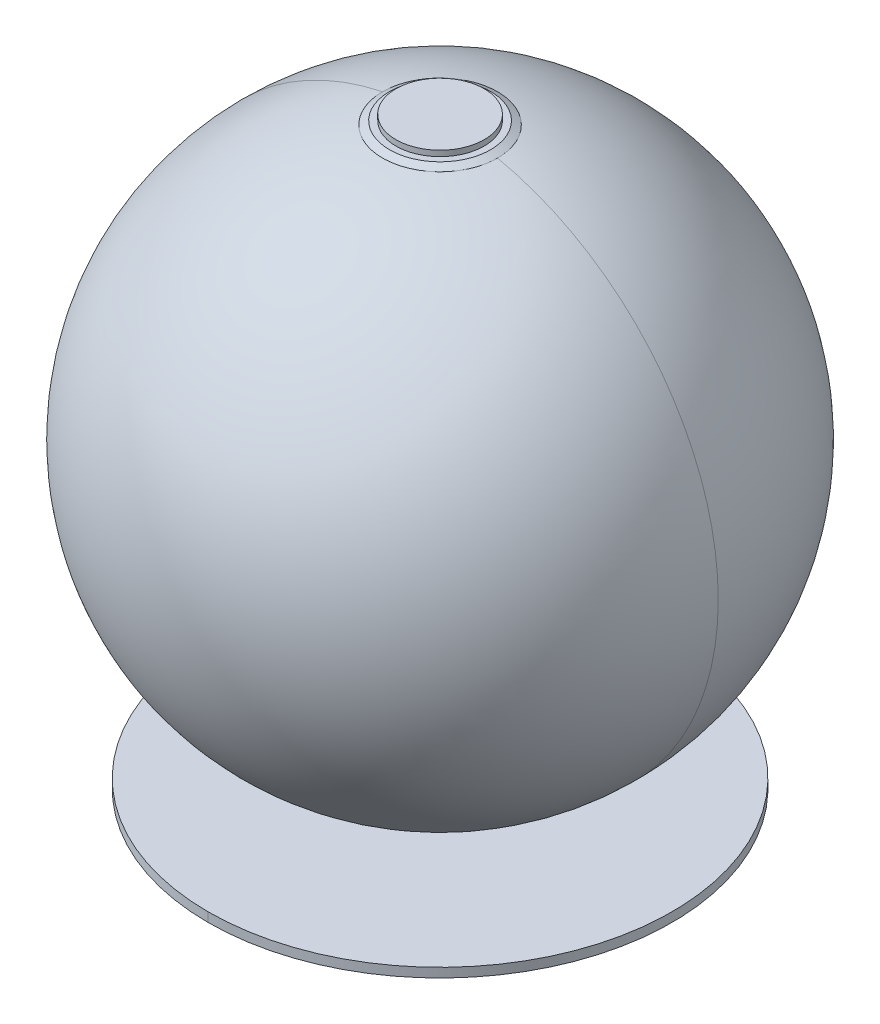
ISO-10303-21;
HEADER;
FILE_DESCRIPTION(('STEP AP214'),'2;1');
FILE_NAME('part.step','',(''),(''),'','','');
FILE_SCHEMA(('AUTOMOTIVE_DESIGN { 1 0 10303 214 1 1 1 1 }'));
ENDSEC;
DATA;
#1=APPLICATION_CONTEXT('core data for automotive mechanical design processes');
#2=APPLICATION_PROTOCOL_DEFINITION('international standard','automotive_design',2000,#1);
#3=PRODUCT_CONTEXT('',#1,'mechanical');
#4=PRODUCT('Part','Part','',(#3));
#5=PRODUCT_RELATED_PRODUCT_CATEGORY('part','',(#4));
#6=PRODUCT_DEFINITION_FORMATION('','',#4);
#7=PRODUCT_DEFINITION_CONTEXT('part definition',#1,'design');
#8=PRODUCT_DEFINITION('design','',#6,#7);
#9=PRODUCT_DEFINITION_SHAPE('','',#8);
#10=(LENGTH_UNIT() NAMED_UNIT(*) SI_UNIT(.MILLI.,.METRE.));
#11=(NAMED_UNIT(*) PLANE_ANGLE_UNIT() SI_UNIT($,.RADIAN.));
#12=(NAMED_UNIT(*) SI_UNIT($,.STERADIAN.) SOLID_ANGLE_UNIT());
#13=UNCERTAINTY_MEASURE_WITH_UNIT(LENGTH_MEASURE(1.E-05),#10,'distance_accuracy_value','');
#14=(GEOMETRIC_REPRESENTATION_CONTEXT(3) GLOBAL_UNCERTAINTY_ASSIGNED_CONTEXT((#13)) GLOBAL_UNIT_ASSIGNED_CONTEXT((#10,
#11,#12)) REPRESENTATION_CONTEXT('',''));
#15=CARTESIAN_POINT('',(0.,0.,0.));
#16=DIRECTION('',(0.,0.,1.));
#17=DIRECTION('',(1.,0.,0.));
#18=AXIS2_PLACEMENT_3D('',#15,#16,#17);
#19=CARTESIAN_POINT('',(-5.4956309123,277.038502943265,0.));
#20=DIRECTION('',(0.,-1.,0.));
#21=DIRECTION('',(-1.,0.,0.));
#22=AXIS2_PLACEMENT_3D('',#19,#20,#21);
#23=CONICAL_SURFACE('',#22,30.9999999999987,1.08210413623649);
#24=CARTESIAN_POINT('',(-5.49563091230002,279.038502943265,0.));
#25=DIRECTION('',(0.,1.,0.));
#26=DIRECTION('',(-1.,0.,0.));
#27=AXIS2_PLACEMENT_3D('',#24,#25,#26);
#28=CIRCLE('',#27,27.238547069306);
#29=CARTESIAN_POINT('',(-32.734177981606,279.038502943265,0.));
#30=VERTEX_POINT('',#29);
#31=EDGE_CURVE('P0_E65',#30,#30,#28,.T.);
#32=ORIENTED_EDGE('',*,*,#31,.F.);
#33=EDGE_LOOP('',(#32));
#34=FACE_BOUND('',#33,.T.);
#35=CARTESIAN_POINT('',(-5.4956309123,277.038502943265,0.));
#36=DIRECTION('',(0.,1.,0.));
#37=DIRECTION('',(-1.,0.,0.));
#38=AXIS2_PLACEMENT_3D('',#35,#36,#37);
#39=CIRCLE('',#38,30.9999999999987);
#40=CARTESIAN_POINT('',(-36.4956309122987,277.038502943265,0.));
#41=VERTEX_POINT('',#40);
#42=EDGE_CURVE('P0_E73',#41,#41,#39,.T.);
#43=ORIENTED_EDGE('',*,*,#42,.T.);
#44=EDGE_LOOP('',(#43));
#45=FACE_BOUND('',#44,.T.);
#46=ADVANCED_FACE('P0_F62',(#34,#45),#23,.T.);
#47=CARTESIAN_POINT('',(-5.49563091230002,279.038502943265,0.));
#48=DIRECTION('',(0.,1.,0.));
#49=DIRECTION('',(-1.,0.,0.));
#50=AXIS2_PLACEMENT_3D('',#47,#48,#49);
#51=PLANE('',#50);
#52=CARTESIAN_POINT('',(-5.49563091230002,279.038502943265,0.));
#53=DIRECTION('',(0.,1.,0.));
#54=DIRECTION('',(-1.,0.,0.));
#55=AXIS2_PLACEMENT_3D('',#52,#53,#54);
#56=CIRCLE('',#55,23.7946512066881);
#57=CARTESIAN_POINT('',(-29.2902821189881,279.038502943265,0.));
#58=VERTEX_POINT('',#57);
#59=EDGE_CURVE('P0_E11',#58,#58,#56,.T.);
#60=ORIENTED_EDGE('',*,*,#59,.F.);
#61=EDGE_LOOP('',(#60));
#62=FACE_BOUND('',#61,.T.);
#63=ORIENTED_EDGE('',*,*,#31,.T.);
#64=EDGE_LOOP('',(#63));
#65=FACE_BOUND('',#64,.T.);
#66=ADVANCED_FACE('P0_F93',(#62,#65),#51,.T.);
#67=CARTESIAN_POINT('',(-5.4956309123,277.038502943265,0.));
#68=DIRECTION('',(0.,1.,0.));
#69=DIRECTION('',(-1.,0.,0.));
#70=AXIS2_PLACEMENT_3D('',#67,#68,#69);
#71=PLANE('',#70);
#72=ORIENTED_EDGE('',*,*,#42,.F.);
#73=EDGE_LOOP('',(#72));
#74=FACE_BOUND('',#73,.T.);
#75=ADVANCED_FACE('P0_F86',(#74),#71,.F.);
#76=CARTESIAN_POINT('',(-5.49563091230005,282.038502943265,0.));
#77=DIRECTION('',(0.,-1.,0.));
#78=DIRECTION('',(1.,0.,0.));
#79=AXIS2_PLACEMENT_3D('',#76,#77,#78);
#80=CYLINDRICAL_SURFACE('',#79,23.7946512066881);
#81=CARTESIAN_POINT('',(-5.49563091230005,282.038502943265,0.));
#82=DIRECTION('',(0.,1.,0.));
#83=DIRECTION('',(-1.,0.,0.));
#84=AXIS2_PLACEMENT_3D('',#81,#82,#83);
#85=CIRCLE('',#84,23.7946512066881);
#86=CARTESIAN_POINT('',(-29.2902821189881,282.038502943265,0.));
#87=VERTEX_POINT('',#86);
#88=EDGE_CURVE('P0_E75',#87,#87,#85,.T.);
#89=ORIENTED_EDGE('',*,*,#88,.F.);
#90=EDGE_LOOP('',(#89));
#91=FACE_BOUND('',#90,.T.);
#92=ORIENTED_EDGE('',*,*,#59,.T.);
#93=EDGE_LOOP('',(#92));
#94=FACE_BOUND('',#93,.T.);
#95=ADVANCED_FACE('P0_F84',(#91,#94),#80,.T.);
#96=CARTESIAN_POINT('',(-5.49563091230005,282.038502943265,0.));
#97=DIRECTION('',(0.,1.,0.));
#98=DIRECTION('',(-1.,0.,0.));
#99=AXIS2_PLACEMENT_3D('',#96,#97,#98);
#100=PLANE('',#99);
#101=ORIENTED_EDGE('',*,*,#88,.T.);
#102=EDGE_LOOP('',(#101));
#103=FACE_BOUND('',#102,.T.);
#104=ADVANCED_FACE('P0_F82',(#103),#100,.T.);
#105=CLOSED_SHELL('',(#46,#66,#75,#95,#104));
#106=MANIFOLD_SOLID_BREP('P0_B2',#105);
#107=CARTESIAN_POINT('',(-5.495630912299,130.276791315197,0.));
#108=DIRECTION('',(0.,0.,1.));
#109=DIRECTION('',(1.,0.,0.));
#110=AXIS2_PLACEMENT_3D('',#107,#108,#109);
#111=SPHERICAL_SURFACE('',#110,150.);
#112=CARTESIAN_POINT('',(-5.495630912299,130.276791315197,0.));
#113=DIRECTION('',(0.,0.,1.));
#114=DIRECTION('',(1.,0.,0.));
#115=AXIS2_PLACEMENT_3D('',#112,#113,#114);
#116=CIRCLE('',#115,150.);
#117=CARTESIAN_POINT('',(-36.4956309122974,277.038502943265,0.));
#118=VERTEX_POINT('',#117);
#119=CARTESIAN_POINT('',(-5.49563091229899,-19.723208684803,0.));
#120=VERTEX_POINT('',#119);
#121=EDGE_CURVE('P0_E60',#118,#120,#116,.T.);
#122=ORIENTED_EDGE('',*,*,#121,.F.);
#123=CARTESIAN_POINT('',(-5.4956309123,277.038502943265,0.));
#124=DIRECTION('',(0.,1.,0.));
#125=DIRECTION('',(-1.,0.,0.));
#126=AXIS2_PLACEMENT_3D('',#123,#124,#125);
#127=CIRCLE('',#126,31.);
#128=CARTESIAN_POINT('',(25.5043690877,277.038502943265,0.));
#129=VERTEX_POINT('',#128);
#130=EDGE_CURVE('P0_E166',#129,#118,#127,.T.);
#131=ORIENTED_EDGE('',*,*,#130,.F.);
#132=CARTESIAN_POINT('',(-5.495630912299,130.276791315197,0.));
#133=DIRECTION('',(0.,0.,-1.));
#134=DIRECTION('',(-1.,0.,0.));
#135=AXIS2_PLACEMENT_3D('',#132,#133,#134);
#136=CIRCLE('',#135,150.);
#137=EDGE_CURVE('P0_E155',#129,#120,#136,.T.);
#138=ORIENTED_EDGE('',*,*,#137,.T.);
#139=EDGE_LOOP('',(#122,#131,#138));
#140=FACE_BOUND('',#139,.T.);
#141=ADVANCED_FACE('P0_F151',(#140),#111,.T.);
#142=CARTESIAN_POINT('',(-5.495630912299,130.276791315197,0.));
#143=DIRECTION('',(0.,0.,1.));
#144=DIRECTION('',(1.,0.,0.));
#145=AXIS2_PLACEMENT_3D('',#142,#143,#144);
#146=SPHERICAL_SURFACE('',#145,150.);
#147=ORIENTED_EDGE('',*,*,#137,.F.);
#148=EDGE_CURVE('P0_E178',#118,#129,#127,.T.);
#149=ORIENTED_EDGE('',*,*,#148,.F.);
#150=ORIENTED_EDGE('',*,*,#121,.T.);
#151=EDGE_LOOP('',(#147,#149,#150));
#152=FACE_BOUND('',#151,.T.);
#153=ADVANCED_FACE('P0_F153',(#152),#146,.T.);
#154=CARTESIAN_POINT('',(-5.4956309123,277.038502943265,0.));
#155=DIRECTION('',(0.,1.,0.));
#156=DIRECTION('',(-1.,0.,0.));
#157=AXIS2_PLACEMENT_3D('',#154,#155,#156);
#158=PLANE('',#157);
#159=ORIENTED_EDGE('',*,*,#148,.T.);
#160=ORIENTED_EDGE('',*,*,#130,.T.);
#161=EDGE_LOOP('',(#159,#160));
#162=FACE_BOUND('',#161,.T.);
#163=ADVANCED_FACE('P0_F179',(#162),#158,.T.);
#164=CLOSED_SHELL('',(#141,#153,#163));
#165=MANIFOLD_SOLID_BREP('P0_B6',#164);
#166=CARTESIAN_POINT('',(-5.49563091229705,-17.961497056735,0.));
#167=DIRECTION('',(0.,-1.,0.));
#168=DIRECTION('',(0.,0.,1.));
#169=AXIS2_PLACEMENT_3D('',#166,#167,#168);
#170=PLANE('',#169);
#171=DIRECTION('',(0.969400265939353,0.,0.24548548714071));
#172=VECTOR('',#171,1.);
#173=CARTESIAN_POINT('',(-5.49563091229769,-17.961497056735,2.51405389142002E-12));
#174=LINE('',#173,#172);
#175=CARTESIAN_POINT('',(22.6169767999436,-17.9614970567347,7.11907912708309));
#176=VERTEX_POINT('',#175);
#177=CARTESIAN_POINT('',(23.5863770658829,-17.9614970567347,7.3645646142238));
#178=VERTEX_POINT('',#177);
#179=EDGE_CURVE('P0_E845',#176,#178,#174,.T.);
#180=ORIENTED_EDGE('',*,*,#179,.F.);
#181=CARTESIAN_POINT('',(-5.49563091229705,-17.961497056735,0.));
#182=DIRECTION('',(0.,-1.,0.));
#183=DIRECTION('',(1.,0.,0.));
#184=AXIS2_PLACEMENT_3D('',#181,#182,#183);
#185=CIRCLE('',#184,29.);
#186=CARTESIAN_POINT('',(21.1126469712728,-17.9614970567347,11.5325430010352));
#187=VERTEX_POINT('',#186);
#188=EDGE_CURVE('P0_E1052',#176,#187,#185,.T.);
#189=ORIENTED_EDGE('',*,*,#188,.T.);
#190=DIRECTION('',(-0.91752682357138,0.,-0.397673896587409));
#191=VECTOR('',#190,1.);
#192=CARTESIAN_POINT('',(-5.4956309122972,-17.961497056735,3.54939136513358E-13));
#193=LINE('',#192,#191);
#194=CARTESIAN_POINT('',(22.0301737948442,-17.9614970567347,11.9302168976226));
#195=VERTEX_POINT('',#194);
#196=EDGE_CURVE('P0_E1145',#195,#187,#193,.T.);
#197=ORIENTED_EDGE('',*,*,#196,.F.);
#198=CARTESIAN_POINT('',(-5.49563091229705,-17.961497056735,0.));
#199=DIRECTION('',(0.,1.,0.));
#200=DIRECTION('',(1.,0.,0.));
#201=AXIS2_PLACEMENT_3D('',#198,#199,#200);
#202=CIRCLE('',#201,30.);
#203=CARTESIAN_POINT('',(19.6193634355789,-17.9614970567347,16.4084447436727));
#204=VERTEX_POINT('',#203);
#205=EDGE_CURVE('P0_E867',#204,#195,#202,.T.);
#206=ORIENTED_EDGE('',*,*,#205,.F.);
#207=DIRECTION('',(0.837166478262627,0.,0.546948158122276));
#208=VECTOR('',#207,1.);
#209=CARTESIAN_POINT('',(-5.49563091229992,-17.961497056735,4.38725432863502E-12));
#210=LINE('',#209,#208);
#211=CARTESIAN_POINT('',(18.7821969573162,-17.9614970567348,15.8614965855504));
#212=VERTEX_POINT('',#211);
#213=EDGE_CURVE('P0_E783',#212,#204,#210,.T.);
#214=ORIENTED_EDGE('',*,*,#213,.F.);
#215=CARTESIAN_POINT('',(-5.49563091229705,-17.961497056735,0.));
#216=DIRECTION('',(0.,-1.,0.));
#217=DIRECTION('',(1.,0.,0.));
#218=AXIS2_PLACEMENT_3D('',#215,#216,#217);
#219=CIRCLE('',#218,29.);
#220=CARTESIAN_POINT('',(15.9263264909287,-17.9614970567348,19.5473717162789));
#221=VERTEX_POINT('',#220);
#222=EDGE_CURVE('P0_E791',#212,#221,#219,.T.);
#223=ORIENTED_EDGE('',*,*,#222,.T.);
#224=DIRECTION('',(-0.738688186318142,0.,-0.674047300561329));
#225=VECTOR('',#224,1.);
#226=CARTESIAN_POINT('',(-5.49563091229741,-17.961497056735,3.98521538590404E-13));
#227=LINE('',#226,#225);
#228=CARTESIAN_POINT('',(16.6650146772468,-17.9614970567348,20.2214190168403));
#229=VERTEX_POINT('',#228);
#230=EDGE_CURVE('P0_E761',#229,#221,#227,.T.);
#231=ORIENTED_EDGE('',*,*,#230,.F.);
#232=CARTESIAN_POINT('',(-5.49563091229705,-17.961497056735,0.));
#233=DIRECTION('',(0.,1.,0.));
#234=DIRECTION('',(1.,0.,0.));
#235=AXIS2_PLACEMENT_3D('',#232,#233,#234);
#236=CIRCLE('',#235,30.);
#237=CARTESIAN_POINT('',(12.9307504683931,-17.9614970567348,23.6742152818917));
#238=VERTEX_POINT('',#237);
#239=EDGE_CURVE('P0_E627',#238,#229,#236,.T.);
#240=ORIENTED_EDGE('',*,*,#239,.F.);
#241=DIRECTION('',(0.614212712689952,0.,0.789140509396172));
#242=VECTOR('',#241,1.);
#243=CARTESIAN_POINT('',(-5.49563091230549,-17.961497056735,6.56874099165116E-12));
#244=LINE('',#243,#242);
#245=CARTESIAN_POINT('',(12.3165377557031,-17.9614970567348,22.8850747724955));
#246=VERTEX_POINT('',#245);
#247=EDGE_CURVE('P0_E623',#246,#238,#244,.T.);
#248=ORIENTED_EDGE('',*,*,#247,.F.);
#249=CARTESIAN_POINT('',(-5.49563091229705,-17.961497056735,0.));
#250=DIRECTION('',(0.,-1.,0.));
#251=DIRECTION('',(1.,0.,0.));
#252=AXIS2_PLACEMENT_3D('',#249,#250,#251);
#253=CIRCLE('',#252,29.);
#254=CARTESIAN_POINT('',(8.41860453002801,-17.9614970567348,25.4439393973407));
#255=VERTEX_POINT('',#254);
#256=EDGE_CURVE('P0_E607',#246,#255,#253,.T.);
#257=ORIENTED_EDGE('',*,*,#256,.T.);
#258=DIRECTION('',(-0.479801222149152,0.,-0.877377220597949));
#259=VECTOR('',#258,1.);
#260=CARTESIAN_POINT('',(-5.49563091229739,-17.961497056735,1.83943260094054E-13));
#261=LINE('',#260,#259);
#262=CARTESIAN_POINT('',(8.89840575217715,-17.9614970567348,26.3213166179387));
#263=VERTEX_POINT('',#262);
#264=EDGE_CURVE('P0_E916',#263,#255,#261,.T.);
#265=ORIENTED_EDGE('',*,*,#264,.F.);
#266=CARTESIAN_POINT('',(-5.49563091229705,-17.961497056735,0.));
#267=DIRECTION('',(0.,1.,0.));
#268=DIRECTION('',(1.,0.,0.));
#269=AXIS2_PLACEMENT_3D('',#266,#267,#268);
#270=CIRCLE('',#269,30.);
#271=CARTESIAN_POINT('',(4.24535316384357,-17.9614970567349,28.374517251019));
#272=VERTEX_POINT('',#271);
#273=EDGE_CURVE('P0_E877',#272,#263,#270,.T.);
#274=ORIENTED_EDGE('',*,*,#273,.F.);
#275=DIRECTION('',(0.324699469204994,0.,0.945817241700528));
#276=VECTOR('',#275,1.);
#277=CARTESIAN_POINT('',(-5.49563091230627,-17.961497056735,3.16385271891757E-12));
#278=LINE('',#277,#276);
#279=CARTESIAN_POINT('',(3.92065369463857,-17.9614970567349,27.4287000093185));
#280=VERTEX_POINT('',#279);
#281=EDGE_CURVE('P0_E1178',#280,#272,#278,.T.);
#282=ORIENTED_EDGE('',*,*,#281,.F.);
#283=CARTESIAN_POINT('',(-5.49563091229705,-17.961497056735,0.));
#284=DIRECTION('',(0.,-1.,0.));
#285=DIRECTION('',(1.,0.,0.));
#286=AXIS2_PLACEMENT_3D('',#283,#284,#285);
#287=CIRCLE('',#286,29.);
#288=CARTESIAN_POINT('',(-0.596940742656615,-17.9614970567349,28.5832614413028));
#289=VERTEX_POINT('',#288);
#290=EDGE_CURVE('P0_E710',#280,#289,#287,.T.);
#291=ORIENTED_EDGE('',*,*,#290,.T.);
#292=DIRECTION('',(-0.168920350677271,0.,-0.985629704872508));
#293=VECTOR('',#292,1.);
#294=CARTESIAN_POINT('',(-5.49563091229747,-17.961497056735,0.));
#295=LINE('',#294,#293);
#296=CARTESIAN_POINT('',(-0.428020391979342,-17.9614970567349,29.5688911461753));
#297=VERTEX_POINT('',#296);
#298=EDGE_CURVE('P0_E695',#297,#289,#295,.T.);
#299=ORIENTED_EDGE('',*,*,#298,.F.);
#300=CARTESIAN_POINT('',(-5.49563091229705,-17.961497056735,0.));
#301=DIRECTION('',(0.,1.,0.));
#302=DIRECTION('',(1.,0.,0.));
#303=AXIS2_PLACEMENT_3D('',#300,#301,#302);
#304=CIRCLE('',#303,30.);
#305=CARTESIAN_POINT('',(-5.49563091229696,-17.961497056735,30.));
#306=VERTEX_POINT('',#305);
#307=EDGE_CURVE('P0_E1061',#306,#297,#304,.T.);
#308=ORIENTED_EDGE('',*,*,#307,.F.);
#309=DIRECTION('',(0.,0.,1.));
#310=VECTOR('',#309,1.);
#311=CARTESIAN_POINT('',(-5.49563091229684,-17.961497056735,0.));
#312=LINE('',#311,#310);
#313=CARTESIAN_POINT('',(-5.49563091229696,-17.961497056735,29.));
#314=VERTEX_POINT('',#313);
#315=EDGE_CURVE('P0_E510',#314,#306,#312,.T.);
#316=ORIENTED_EDGE('',*,*,#315,.F.);
#317=CARTESIAN_POINT('',(-5.49563091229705,-17.961497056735,0.));
#318=DIRECTION('',(0.,-1.,0.));
#319=DIRECTION('',(1.,0.,0.));
#320=AXIS2_PLACEMENT_3D('',#317,#318,#319);
#321=CIRCLE('',#320,29.);
#322=CARTESIAN_POINT('',(-10.1433351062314,-17.9614970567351,28.6251435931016));
#323=VERTEX_POINT('',#322);
#324=EDGE_CURVE('P0_E498',#314,#323,#321,.T.);
#325=ORIENTED_EDGE('',*,*,#324,.T.);
#326=DIRECTION('',(0.160265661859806,0.,-0.987073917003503));
#327=VECTOR('',#326,1.);
#328=CARTESIAN_POINT('',(-5.49563091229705,-17.961497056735,0.));
#329=LINE('',#328,#327);
#330=CARTESIAN_POINT('',(-10.3036007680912,-17.9614970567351,29.6122175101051));
#331=VERTEX_POINT('',#330);
#332=EDGE_CURVE('P0_E815',#331,#323,#329,.T.);
#333=ORIENTED_EDGE('',*,*,#332,.F.);
#334=CARTESIAN_POINT('',(-5.49563091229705,-17.961497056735,0.));
#335=DIRECTION('',(0.,1.,0.));
#336=DIRECTION('',(1.,0.,0.));
#337=AXIS2_PLACEMENT_3D('',#334,#335,#336);
#338=CIRCLE('',#337,30.);
#339=CARTESIAN_POINT('',(-15.2366149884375,-17.9614970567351,28.3745172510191));
#340=VERTEX_POINT('',#339);
#341=EDGE_CURVE('P0_E905',#340,#331,#338,.T.);
#342=ORIENTED_EDGE('',*,*,#341,.F.);
#343=DIRECTION('',(-0.324699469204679,0.,0.945817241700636));
#344=VECTOR('',#343,1.);
#345=CARTESIAN_POINT('',(-5.4956309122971,-17.961497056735,0.));
#346=LINE('',#345,#344);
#347=CARTESIAN_POINT('',(-14.9119155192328,-17.9614970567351,27.4287000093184));
#348=VERTEX_POINT('',#347);
#349=EDGE_CURVE('P0_E704',#348,#340,#346,.T.);
#350=ORIENTED_EDGE('',*,*,#349,.F.);
#351=CARTESIAN_POINT('',(-5.49563091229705,-17.961497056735,0.));
#352=DIRECTION('',(0.,-1.,0.));
#353=DIRECTION('',(1.,0.,0.));
#354=AXIS2_PLACEMENT_3D('',#351,#352,#353);
#355=CIRCLE('',#354,29.);
#356=CARTESIAN_POINT('',(-19.1860786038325,-17.9614970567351,25.565047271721));
#357=VERTEX_POINT('',#356);
#358=EDGE_CURVE('P0_E666',#348,#357,#355,.T.);
#359=ORIENTED_EDGE('',*,*,#358,.T.);
#360=DIRECTION('',(0.472084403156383,0.,-0.881553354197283));
#361=VECTOR('',#360,1.);
#362=CARTESIAN_POINT('',(-5.49563091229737,-17.961497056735,-1.71157602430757E-13));
#363=LINE('',#362,#361);
#364=CARTESIAN_POINT('',(-19.6581630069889,-17.9614970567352,26.4466006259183));
#365=VERTEX_POINT('',#364);
#366=EDGE_CURVE('P0_E1008',#365,#357,#363,.T.);
#367=ORIENTED_EDGE('',*,*,#366,.F.);
#368=CARTESIAN_POINT('',(-5.49563091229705,-17.961497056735,0.));
#369=DIRECTION('',(0.,1.,0.));
#370=DIRECTION('',(1.,0.,0.));
#371=AXIS2_PLACEMENT_3D('',#368,#369,#370);
#372=CIRCLE('',#371,30.);
#373=CARTESIAN_POINT('',(-23.9220122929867,-17.9614970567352,23.6742152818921));
#374=VERTEX_POINT('',#373);
#375=EDGE_CURVE('P0_E689',#374,#365,#372,.T.);
#376=ORIENTED_EDGE('',*,*,#375,.F.);
#377=DIRECTION('',(-0.614212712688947,0.,0.789140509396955));
#378=VECTOR('',#377,1.);
#379=CARTESIAN_POINT('',(-5.49563091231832,-17.961497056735,-1.65555713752E-11));
#380=LINE('',#379,#378);
#381=CARTESIAN_POINT('',(-23.3077995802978,-17.9614970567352,22.8850747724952));
#382=VERTEX_POINT('',#381);
#383=EDGE_CURVE('P0_E967',#382,#374,#380,.T.);
#384=ORIENTED_EDGE('',*,*,#383,.F.);
#385=CARTESIAN_POINT('',(-5.49563091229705,-17.961497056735,0.));
#386=DIRECTION('',(0.,-1.,0.));
#387=DIRECTION('',(1.,0.,0.));
#388=AXIS2_PLACEMENT_3D('',#385,#386,#387);
#389=CIRCLE('',#388,29.);
#390=CARTESIAN_POINT('',(-26.7452496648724,-17.9614970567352,19.7345813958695));
#391=VERTEX_POINT('',#390);
#392=EDGE_CURVE('P0_E808',#382,#391,#389,.T.);
#393=ORIENTED_EDGE('',*,*,#392,.T.);
#394=DIRECTION('',(0.732745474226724,0.,-0.680502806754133));
#395=VECTOR('',#394,1.);
#396=CARTESIAN_POINT('',(-5.49563091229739,-17.961497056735,-3.60995460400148E-13));
#397=LINE('',#396,#395);
#398=CARTESIAN_POINT('',(-27.4779951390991,-17.9614970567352,20.4150842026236));
#399=VERTEX_POINT('',#398);
#400=EDGE_CURVE('P0_E1027',#399,#391,#397,.T.);
#401=ORIENTED_EDGE('',*,*,#400,.F.);
#402=CARTESIAN_POINT('',(-5.49563091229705,-17.961497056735,0.));
#403=DIRECTION('',(0.,1.,0.));
#404=DIRECTION('',(1.,0.,0.));
#405=AXIS2_PLACEMENT_3D('',#402,#403,#404);
#406=CIRCLE('',#405,30.);
#407=CARTESIAN_POINT('',(-30.6106252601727,-17.9614970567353,16.4084447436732));
#408=VERTEX_POINT('',#407);
#409=EDGE_CURVE('P0_E1271',#408,#399,#406,.T.);
#410=ORIENTED_EDGE('',*,*,#409,.F.);
#411=DIRECTION('',(-0.837166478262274,0.,0.546948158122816));
#412=VECTOR('',#411,1.);
#413=CARTESIAN_POINT('',(-5.49563091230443,-17.961497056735,-1.12956187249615E-11));
#414=LINE('',#413,#412);
#415=CARTESIAN_POINT('',(-29.7734587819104,-17.9614970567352,15.8614965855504));
#416=VERTEX_POINT('',#415);
#417=EDGE_CURVE('P0_E789',#416,#408,#414,.T.);
#418=ORIENTED_EDGE('',*,*,#417,.F.);
#419=CARTESIAN_POINT('',(-5.49563091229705,-17.961497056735,0.));
#420=DIRECTION('',(0.,-1.,0.));
#421=DIRECTION('',(1.,0.,0.));
#422=AXIS2_PLACEMENT_3D('',#419,#420,#421);
#423=CIRCLE('',#422,29.);
#424=CARTESIAN_POINT('',(-32.0016948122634,-17.9614970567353,11.7655674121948));
#425=VERTEX_POINT('',#424);
#426=EDGE_CURVE('P0_E740',#416,#425,#423,.T.);
#427=ORIENTED_EDGE('',*,*,#426,.T.);
#428=DIRECTION('',(0.914002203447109,0.,-0.405709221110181));
#429=VECTOR('',#428,1.);
#430=CARTESIAN_POINT('',(-5.49563091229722,-17.961497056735,-3.83700941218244E-13));
#431=LINE('',#430,#429);
#432=CARTESIAN_POINT('',(-32.9156970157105,-17.9614970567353,12.171276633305));
#433=VERTEX_POINT('',#432);
#434=EDGE_CURVE('P0_E1159',#433,#425,#431,.T.);
#435=ORIENTED_EDGE('',*,*,#434,.F.);
#436=CARTESIAN_POINT('',(-5.49563091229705,-17.961497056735,0.));
#437=DIRECTION('',(0.,1.,0.));
#438=DIRECTION('',(1.,0.,0.));
#439=AXIS2_PLACEMENT_3D('',#436,#437,#438);
#440=CIRCLE('',#439,30.);
#441=CARTESIAN_POINT('',(-34.5776388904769,-17.9614970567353,7.36456461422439));
#442=VERTEX_POINT('',#441);
#443=EDGE_CURVE('P0_E1277',#442,#433,#440,.T.);
#444=ORIENTED_EDGE('',*,*,#443,.F.);
#445=DIRECTION('',(-0.969400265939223,0.,0.245485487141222));
#446=VECTOR('',#445,1.);
#447=CARTESIAN_POINT('',(-5.49563091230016,-17.961497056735,-1.22692556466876E-11));
#448=LINE('',#447,#446);
#449=CARTESIAN_POINT('',(-33.6082386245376,-17.9614970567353,7.11907912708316));
#450=VERTEX_POINT('',#449);
#451=EDGE_CURVE('P0_E921',#450,#442,#448,.T.);
#452=ORIENTED_EDGE('',*,*,#451,.F.);
#453=CARTESIAN_POINT('',(-5.49563091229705,-17.961497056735,0.));
#454=DIRECTION('',(0.,-1.,0.));
#455=DIRECTION('',(1.,0.,0.));
#456=AXIS2_PLACEMENT_3D('',#453,#454,#455);
#457=CIRCLE('',#456,29.);
#458=CARTESIAN_POINT('',(-34.3857966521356,-17.9614970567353,2.52157163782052));
#459=VERTEX_POINT('',#458);
#460=EDGE_CURVE('P0_E653',#450,#459,#457,.T.);
#461=ORIENTED_EDGE('',*,*,#460,.T.);
#462=DIRECTION('',(0.996212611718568,0.,-0.0869507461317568));
#463=VECTOR('',#462,1.);
#464=CARTESIAN_POINT('',(-5.49563091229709,-17.961497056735,-4.22101469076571E-13));
#465=LINE('',#464,#463);
#466=CARTESIAN_POINT('',(-35.3820092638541,-17.9614970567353,2.60852238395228));
#467=VERTEX_POINT('',#466);
#468=EDGE_CURVE('P0_E1260',#467,#459,#465,.T.);
#469=ORIENTED_EDGE('',*,*,#468,.F.);
#470=CARTESIAN_POINT('',(-5.49563091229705,-17.961497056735,0.));
#471=DIRECTION('',(0.,1.,0.));
#472=DIRECTION('',(1.,0.,0.));
#473=AXIS2_PLACEMENT_3D('',#470,#471,#472);
#474=CIRCLE('',#473,30.);
#475=CARTESIAN_POINT('',(-35.4956309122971,-17.9614970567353,0.));
#476=VERTEX_POINT('',#475);
#477=EDGE_CURVE('P0_E717',#476,#467,#474,.T.);
#478=ORIENTED_EDGE('',*,*,#477,.F.);
#479=CARTESIAN_POINT('',(-5.49563091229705,-17.961497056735,0.));
#480=DIRECTION('',(0.,1.,0.));
#481=DIRECTION('',(1.,0.,0.));
#482=AXIS2_PLACEMENT_3D('',#479,#480,#481);
#483=CIRCLE('',#482,30.);
#484=CARTESIAN_POINT('',(-35.3931657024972,-17.9614970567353,-2.47738036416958));
#485=VERTEX_POINT('',#484);
#486=EDGE_CURVE('P0_E891',#485,#476,#483,.T.);
#487=ORIENTED_EDGE('',*,*,#486,.F.);
#488=DIRECTION('',(-0.996584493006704,0.,-0.0825793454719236));
#489=VECTOR('',#488,1.);
#490=CARTESIAN_POINT('',(-5.49563091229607,-17.961497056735,-1.18669052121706E-11));
#491=LINE('',#490,#489);
#492=CARTESIAN_POINT('',(-34.3965812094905,-17.9614970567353,-2.39480101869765));
#493=VERTEX_POINT('',#492);
#494=EDGE_CURVE('P0_E931',#493,#485,#491,.T.);
#495=ORIENTED_EDGE('',*,*,#494,.F.);
#496=CARTESIAN_POINT('',(-5.49563091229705,-17.961497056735,0.));
#497=DIRECTION('',(0.,-1.,0.));
#498=DIRECTION('',(1.,0.,0.));
#499=AXIS2_PLACEMENT_3D('',#496,#497,#498);
#500=CIRCLE('',#499,29.);
#501=CARTESIAN_POINT('',(-33.6392007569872,-17.9614970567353,-6.99567554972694));
#502=VERTEX_POINT('',#501);
#503=EDGE_CURVE('P0_E751',#493,#502,#500,.T.);
#504=ORIENTED_EDGE('',*,*,#503,.T.);
#505=DIRECTION('',(0.970467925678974,0.,0.241230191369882));
#506=VECTOR('',#505,1.);
#507=CARTESIAN_POINT('',(-5.49563091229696,-17.961497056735,-3.73735555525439E-13));
#508=LINE('',#507,#506);
#509=CARTESIAN_POINT('',(-34.6096686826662,-17.9614970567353,-7.23690574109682));
#510=VERTEX_POINT('',#509);
#511=EDGE_CURVE('P0_E1186',#510,#502,#508,.T.);
#512=ORIENTED_EDGE('',*,*,#511,.F.);
#513=CARTESIAN_POINT('',(-5.49563091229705,-17.961497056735,0.));
#514=DIRECTION('',(0.,1.,0.));
#515=DIRECTION('',(1.,0.,0.));
#516=AXIS2_PLACEMENT_3D('',#513,#514,#515);
#517=CIRCLE('',#516,30.);
#518=CARTESIAN_POINT('',(-32.9688307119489,-17.9614970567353,-12.0508627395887));
#519=VERTEX_POINT('',#518);
#520=EDGE_CURVE('P0_E1013',#519,#510,#517,.T.);
#521=ORIENTED_EDGE('',*,*,#520,.F.);
#522=DIRECTION('',(-0.915773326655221,0.,-0.401695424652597));
#523=VECTOR('',#522,1.);
#524=CARTESIAN_POINT('',(-5.49563091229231,-17.961497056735,-1.08121034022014E-11));
#525=LINE('',#524,#523);
#526=CARTESIAN_POINT('',(-32.0530573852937,-17.9614970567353,-11.6491673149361));
#527=VERTEX_POINT('',#526);
#528=EDGE_CURVE('P0_E1039',#527,#519,#525,.T.);
#529=ORIENTED_EDGE('',*,*,#528,.F.);
#530=CARTESIAN_POINT('',(-5.49563091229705,-17.961497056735,0.));
#531=DIRECTION('',(0.,-1.,0.));
#532=DIRECTION('',(1.,0.,0.));
#533=AXIS2_PLACEMENT_3D('',#530,#531,#532);
#534=CIRCLE('',#533,29.);
#535=CARTESIAN_POINT('',(-29.8428123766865,-17.9614970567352,-15.7548327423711));
#536=VERTEX_POINT('',#535);
#537=EDGE_CURVE('P0_E1142',#527,#536,#534,.T.);
#538=ORIENTED_EDGE('',*,*,#537,.T.);
#539=DIRECTION('',(0.839557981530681,0.,0.543270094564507));
#540=VECTOR('',#539,1.);
#541=CARTESIAN_POINT('',(-5.49563091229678,-17.961497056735,-4.22356272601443E-13));
#542=LINE('',#541,#540);
#543=CARTESIAN_POINT('',(-30.6823703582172,-17.9614970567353,-16.2981028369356));
#544=VERTEX_POINT('',#543);
#545=EDGE_CURVE('P0_E658',#544,#536,#542,.T.);
#546=ORIENTED_EDGE('',*,*,#545,.F.);
#547=CARTESIAN_POINT('',(-5.49563091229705,-17.961497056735,0.));
#548=DIRECTION('',(0.,1.,0.));
#549=DIRECTION('',(1.,0.,0.));
#550=AXIS2_PLACEMENT_3D('',#547,#548,#549);
#551=CIRCLE('',#550,30.);
#552=CARTESIAN_POINT('',(-27.5673482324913,-17.9614970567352,-20.318447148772));
#553=VERTEX_POINT('',#552);
#554=EDGE_CURVE('P0_E733',#553,#544,#551,.T.);
#555=ORIENTED_EDGE('',*,*,#554,.F.);
#556=DIRECTION('',(-0.735723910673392,0.,-0.677281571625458));
#557=VECTOR('',#556,1.);
#558=CARTESIAN_POINT('',(-5.49563091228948,-17.961497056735,-8.22688502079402E-12));
#559=LINE('',#558,#557);
#560=CARTESIAN_POINT('',(-26.8316243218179,-17.9614970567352,-19.6411655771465));
#561=VERTEX_POINT('',#560);
#562=EDGE_CURVE('P0_E1303',#561,#553,#559,.T.);
#563=ORIENTED_EDGE('',*,*,#562,.F.);
#564=CARTESIAN_POINT('',(-5.49563091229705,-17.961497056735,0.));
#565=DIRECTION('',(0.,-1.,0.));
#566=DIRECTION('',(1.,0.,0.));
#567=AXIS2_PLACEMENT_3D('',#564,#565,#566);
#568=CIRCLE('',#567,29.);
#569=CARTESIAN_POINT('',(-23.4080290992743,-17.9614970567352,-22.8067093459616));
#570=VERTEX_POINT('',#569);
#571=EDGE_CURVE('P0_E1056',#561,#570,#568,.T.);
#572=ORIENTED_EDGE('',*,*,#571,.T.);
#573=DIRECTION('',(0.617668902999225,0.,0.786438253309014));
#574=VECTOR('',#573,1.);
#575=CARTESIAN_POINT('',(-5.49563091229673,-17.961497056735,-2.55013369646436E-13));
#576=LINE('',#575,#574);
#577=CARTESIAN_POINT('',(-24.0256980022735,-17.9614970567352,-23.5931475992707));
#578=VERTEX_POINT('',#577);
#579=EDGE_CURVE('P0_E752',#578,#570,#576,.T.);
#580=ORIENTED_EDGE('',*,*,#579,.F.);
#581=CARTESIAN_POINT('',(-5.49563091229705,-17.961497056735,0.));
#582=DIRECTION('',(0.,1.,0.));
#583=DIRECTION('',(1.,0.,0.));
#584=AXIS2_PLACEMENT_3D('',#581,#582,#583);
#585=CIRCLE('',#584,30.);
#586=CARTESIAN_POINT('',(-19.7740527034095,-17.9614970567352,-26.3842125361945));
#587=VERTEX_POINT('',#586);
#588=EDGE_CURVE('P0_E796',#587,#578,#585,.T.);
#589=ORIENTED_EDGE('',*,*,#588,.F.);
#590=DIRECTION('',(-0.475947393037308,0.,-0.879473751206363));
#591=VECTOR('',#590,1.);
#592=CARTESIAN_POINT('',(-5.49563091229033,-17.961497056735,-3.63775713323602E-12));
#593=LINE('',#592,#591);
#594=CARTESIAN_POINT('',(-19.2981053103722,-17.9614970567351,-25.5047387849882));
#595=VERTEX_POINT('',#594);
#596=EDGE_CURVE('P0_E1505',#595,#587,#593,.T.);
#597=ORIENTED_EDGE('',*,*,#596,.F.);
#598=CARTESIAN_POINT('',(-5.49563091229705,-17.961497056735,0.));
#599=DIRECTION('',(0.,-1.,0.));
#600=DIRECTION('',(1.,0.,0.));
#601=AXIS2_PLACEMENT_3D('',#598,#599,#600);
#602=CIRCLE('',#601,29.);
#603=CARTESIAN_POINT('',(-15.032159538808,-17.9614970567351,-27.38712510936));
#604=VERTEX_POINT('',#603);
#605=EDGE_CURVE('P0_E682',#595,#604,#602,.T.);
#606=ORIENTED_EDGE('',*,*,#605,.T.);
#607=DIRECTION('',(0.328845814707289,0.,0.944383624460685));
#608=VECTOR('',#607,1.);
#609=CARTESIAN_POINT('',(-5.49563091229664,-17.961497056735,-1.41473225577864E-13));
#610=LINE('',#609,#608);
#611=CARTESIAN_POINT('',(-15.3610053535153,-17.9614970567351,-28.3315087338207));
#612=VERTEX_POINT('',#611);
#613=EDGE_CURVE('P0_E983',#612,#604,#610,.T.);
#614=ORIENTED_EDGE('',*,*,#613,.F.);
#615=CARTESIAN_POINT('',(-5.49563091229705,-17.961497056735,0.));
#616=DIRECTION('',(0.,1.,0.));
#617=DIRECTION('',(1.,0.,0.));
#618=AXIS2_PLACEMENT_3D('',#615,#616,#617);
#619=CIRCLE('',#618,30.);
#620=CARTESIAN_POINT('',(-10.4334686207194,-17.9614970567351,-29.5908391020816));
#621=VERTEX_POINT('',#620);
#622=EDGE_CURVE('P0_E1190',#621,#612,#619,.T.);
#623=ORIENTED_EDGE('',*,*,#622,.F.);
#624=DIRECTION('',(-0.164594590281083,0.,-0.986361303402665));
#625=VECTOR('',#624,1.);
#626=CARTESIAN_POINT('',(-5.49563091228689,-17.961497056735,-1.69531121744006E-12));
#627=LINE('',#626,#625);
#628=CARTESIAN_POINT('',(-10.2688740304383,-17.9614970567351,-28.6044777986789));
#629=VERTEX_POINT('',#628);
#630=EDGE_CURVE('P0_E1276',#629,#621,#627,.T.);
#631=ORIENTED_EDGE('',*,*,#630,.F.);
#632=CARTESIAN_POINT('',(-5.49563091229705,-17.961497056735,0.));
#633=DIRECTION('',(0.,1.,0.));
#634=DIRECTION('',(1.,0.,0.));
#635=AXIS2_PLACEMENT_3D('',#632,#633,#634);
#636=CIRCLE('',#635,29.);
#637=CARTESIAN_POINT('',(-5.49563091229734,-17.961497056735,-29.));
#638=VERTEX_POINT('',#637);
#639=EDGE_CURVE('P0_E1074',#638,#629,#636,.T.);
#640=ORIENTED_EDGE('',*,*,#639,.F.);
#641=DIRECTION('',(0.,0.,-1.));
#642=VECTOR('',#641,1.);
#643=CARTESIAN_POINT('',(-5.49563091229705,-17.961497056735,0.));
#644=LINE('',#643,#642);
#645=CARTESIAN_POINT('',(-5.49563091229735,-17.961497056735,-30.));
#646=VERTEX_POINT('',#645);
#647=EDGE_CURVE('P0_E955',#638,#646,#644,.T.);
#648=ORIENTED_EDGE('',*,*,#647,.T.);
#649=CARTESIAN_POINT('',(-5.49563091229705,-17.961497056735,0.));
#650=DIRECTION('',(0.,1.,0.));
#651=DIRECTION('',(1.,0.,0.));
#652=AXIS2_PLACEMENT_3D('',#649,#650,#651);
#653=CIRCLE('',#652,30.);
#654=CARTESIAN_POINT('',(-0.557793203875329,-17.9614970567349,-29.5908391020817));
#655=VERTEX_POINT('',#654);
#656=EDGE_CURVE('P0_E937',#655,#646,#653,.T.);
#657=ORIENTED_EDGE('',*,*,#656,.F.);
#658=DIRECTION('',(0.164594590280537,0.,-0.986361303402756));
#659=VECTOR('',#658,1.);
#660=CARTESIAN_POINT('',(-5.49563091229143,-17.961497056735,9.38667053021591E-13));
#661=LINE('',#660,#659);
#662=CARTESIAN_POINT('',(-0.722387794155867,-17.9614970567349,-28.604477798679));
#663=VERTEX_POINT('',#662);
#664=EDGE_CURVE('P0_E999',#663,#655,#661,.T.);
#665=ORIENTED_EDGE('',*,*,#664,.F.);
#666=CARTESIAN_POINT('',(-5.49563091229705,-17.961497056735,0.));
#667=DIRECTION('',(0.,-1.,0.));
#668=DIRECTION('',(1.,0.,0.));
#669=AXIS2_PLACEMENT_3D('',#666,#667,#668);
#670=CIRCLE('',#669,29.);
#671=CARTESIAN_POINT('',(3.8002284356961,-17.9614970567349,-27.4697469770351));
#672=VERTEX_POINT('',#671);
#673=EDGE_CURVE('P0_E660',#663,#672,#670,.T.);
#674=ORIENTED_EDGE('',*,*,#673,.T.);
#675=DIRECTION('',(-0.320546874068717,0.,0.947232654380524));
#676=VECTOR('',#675,1.);
#677=CARTESIAN_POINT('',(-5.4956309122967,-17.961497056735,1.20109000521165E-13));
#678=LINE('',#677,#676);
#679=CARTESIAN_POINT('',(4.12077530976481,-17.9614970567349,-28.4169796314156));
#680=VERTEX_POINT('',#679);
#681=EDGE_CURVE('P0_E828',#680,#672,#678,.T.);
#682=ORIENTED_EDGE('',*,*,#681,.F.);
#683=CARTESIAN_POINT('',(-5.49563091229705,-17.961497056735,0.));
#684=DIRECTION('',(0.,1.,0.));
#685=DIRECTION('',(1.,0.,0.));
#686=AXIS2_PLACEMENT_3D('',#683,#684,#685);
#687=CIRCLE('',#686,30.);
#688=CARTESIAN_POINT('',(8.78279087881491,-17.9614970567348,-26.3842125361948));
#689=VERTEX_POINT('',#688);
#690=EDGE_CURVE('P0_E968',#689,#680,#687,.T.);
#691=ORIENTED_EDGE('',*,*,#690,.F.);
#692=DIRECTION('',(0.475947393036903,0.,-0.879473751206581));
#693=VECTOR('',#692,1.);
#694=CARTESIAN_POINT('',(-5.49563091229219,-17.961497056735,2.63047985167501E-12));
#695=LINE('',#694,#693);
#696=CARTESIAN_POINT('',(8.30684348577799,-17.9614970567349,-25.5047387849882));
#697=VERTEX_POINT('',#696);
#698=EDGE_CURVE('P0_E739',#697,#689,#695,.T.);
#699=ORIENTED_EDGE('',*,*,#698,.F.);
#700=CARTESIAN_POINT('',(-5.49563091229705,-17.961497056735,0.));
#701=DIRECTION('',(0.,-1.,0.));
#702=DIRECTION('',(1.,0.,0.));
#703=AXIS2_PLACEMENT_3D('',#700,#701,#702);
#704=CIRCLE('',#703,29.);
#705=CARTESIAN_POINT('',(12.2159653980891,-17.9614970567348,-22.9629997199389));
#706=VERTEX_POINT('',#705);
#707=EDGE_CURVE('P0_E862',#697,#706,#704,.T.);
#708=ORIENTED_EDGE('',*,*,#707,.T.);
#709=DIRECTION('',(-0.610744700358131,0.,0.791827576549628));
#710=VECTOR('',#709,1.);
#711=CARTESIAN_POINT('',(-5.49563091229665,-17.961497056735,3.08306692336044E-13));
#712=LINE('',#711,#710);
#713=CARTESIAN_POINT('',(12.8267100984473,-17.9614970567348,-23.7548272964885));
#714=VERTEX_POINT('',#713);
#715=EDGE_CURVE('P0_E768',#714,#706,#712,.T.);
#716=ORIENTED_EDGE('',*,*,#715,.F.);
#717=CARTESIAN_POINT('',(-5.49563091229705,-17.961497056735,0.));
#718=DIRECTION('',(0.,1.,0.));
#719=DIRECTION('',(1.,0.,0.));
#720=AXIS2_PLACEMENT_3D('',#717,#718,#719);
#721=CIRCLE('',#720,30.);
#722=CARTESIAN_POINT('',(16.5760864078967,-17.9614970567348,-20.3184471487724));
#723=VERTEX_POINT('',#722);
#724=EDGE_CURVE('P0_E866',#723,#714,#721,.T.);
#725=ORIENTED_EDGE('',*,*,#724,.F.);
#726=DIRECTION('',(0.735723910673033,0.,-0.677281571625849));
#727=VECTOR('',#726,1.);
#728=CARTESIAN_POINT('',(-5.49563091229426,-17.961497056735,3.03371171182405E-12));
#729=LINE('',#728,#727);
#730=CARTESIAN_POINT('',(15.8403624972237,-17.9614970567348,-19.6411655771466));
#731=VERTEX_POINT('',#730);
#732=EDGE_CURVE('P0_E773',#731,#723,#729,.T.);
#733=ORIENTED_EDGE('',*,*,#732,.F.);
#734=CARTESIAN_POINT('',(-5.49563091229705,-17.961497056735,0.));
#735=DIRECTION('',(0.,-1.,0.));
#736=DIRECTION('',(1.,0.,0.));
#737=AXIS2_PLACEMENT_3D('',#734,#735,#736);
#738=CIRCLE('',#737,29.);
#739=CARTESIAN_POINT('',(18.712376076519,-17.9614970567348,-15.967855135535));
#740=VERTEX_POINT('',#739);
#741=EDGE_CURVE('P0_E647',#731,#740,#738,.T.);
#742=ORIENTED_EDGE('',*,*,#741,.T.);
#743=DIRECTION('',(-0.834758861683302,0.,0.55061569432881));
#744=VECTOR('',#743,1.);
#745=CARTESIAN_POINT('',(-5.49563091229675,-17.961497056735,4.48903496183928E-13));
#746=LINE('',#745,#744);
#747=CARTESIAN_POINT('',(19.5471349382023,-17.9614970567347,-16.5184708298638));
#748=VERTEX_POINT('',#747);
#749=EDGE_CURVE('P0_E677',#748,#740,#746,.T.);
#750=ORIENTED_EDGE('',*,*,#749,.F.);
#751=CARTESIAN_POINT('',(-5.49563091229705,-17.961497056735,0.));
#752=DIRECTION('',(0.,1.,0.));
#753=DIRECTION('',(1.,0.,0.));
#754=AXIS2_PLACEMENT_3D('',#751,#752,#753);
#755=CIRCLE('',#754,30.);
#756=CARTESIAN_POINT('',(21.9775688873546,-17.9614970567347,-12.0508627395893));
#757=VERTEX_POINT('',#756);
#758=EDGE_CURVE('P0_E1228',#757,#748,#755,.T.);
#759=ORIENTED_EDGE('',*,*,#758,.F.);
#760=DIRECTION('',(0.915773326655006,0.,-0.401695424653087));
#761=VECTOR('',#760,1.);
#762=CARTESIAN_POINT('',(-5.4956309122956,-17.961497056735,3.31861357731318E-12));
#763=LINE('',#762,#761);
#764=CARTESIAN_POINT('',(21.0617955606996,-17.9614970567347,-11.6491673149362));
#765=VERTEX_POINT('',#764);
#766=EDGE_CURVE('P0_E690',#765,#757,#763,.T.);
#767=ORIENTED_EDGE('',*,*,#766,.F.);
#768=CARTESIAN_POINT('',(-5.49563091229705,-17.961497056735,0.));
#769=DIRECTION('',(0.,-1.,0.));
#770=DIRECTION('',(1.,0.,0.));
#771=AXIS2_PLACEMENT_3D('',#768,#769,#770);
#772=CIRCLE('',#771,29.);
#773=CARTESIAN_POINT('',(22.5854735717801,-17.9614970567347,-7.2423456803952));
#774=VERTEX_POINT('',#773);
#775=EDGE_CURVE('P0_E1218',#765,#774,#772,.T.);
#776=ORIENTED_EDGE('',*,*,#775,.T.);
#777=DIRECTION('',(-0.968313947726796,0.,0.249736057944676));
#778=VECTOR('',#777,1.);
#779=CARTESIAN_POINT('',(-5.49563091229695,-17.961497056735,4.00622029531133E-13));
#780=LINE('',#779,#778);
#781=CARTESIAN_POINT('',(23.553787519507,-17.9614970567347,-7.49208173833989));
#782=VERTEX_POINT('',#781);
#783=EDGE_CURVE('P0_E942',#782,#774,#780,.T.);
#784=ORIENTED_EDGE('',*,*,#783,.F.);
#785=CARTESIAN_POINT('',(-5.49563091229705,-17.961497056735,0.));
#786=DIRECTION('',(0.,1.,0.));
#787=DIRECTION('',(1.,0.,0.));
#788=AXIS2_PLACEMENT_3D('',#785,#786,#787);
#789=CIRCLE('',#788,30.);
#790=CARTESIAN_POINT('',(24.401903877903,-17.9614970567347,-2.47738036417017));
#791=VERTEX_POINT('',#790);
#792=EDGE_CURVE('P0_E1021',#791,#782,#789,.T.);
#793=ORIENTED_EDGE('',*,*,#792,.F.);
#794=DIRECTION('',(0.996584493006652,0.,-0.0825793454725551));
#795=VECTOR('',#794,1.);
#796=CARTESIAN_POINT('',(-5.49563091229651,-17.961497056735,6.48299443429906E-12));
#797=LINE('',#796,#795);
#798=CARTESIAN_POINT('',(23.4053193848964,-17.9614970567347,-2.39480101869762));
#799=VERTEX_POINT('',#798);
#800=EDGE_CURVE('P0_E1111',#799,#791,#797,.T.);
#801=ORIENTED_EDGE('',*,*,#800,.F.);
#802=CARTESIAN_POINT('',(-5.49563091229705,-17.961497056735,0.));
#803=DIRECTION('',(0.,1.,0.));
#804=DIRECTION('',(1.,0.,0.));
#805=AXIS2_PLACEMENT_3D('',#802,#803,#804);
#806=CIRCLE('',#805,29.);
#807=CARTESIAN_POINT('',(23.4155476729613,-17.9614970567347,2.26798430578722));
#808=VERTEX_POINT('',#807);
#809=EDGE_CURVE('P0_E886',#808,#799,#806,.T.);
#810=ORIENTED_EDGE('',*,*,#809,.F.);
#811=DIRECTION('',(-0.996937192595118,0.,-0.0782063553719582));
#812=VECTOR('',#811,1.);
#813=CARTESIAN_POINT('',(-5.49563091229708,-17.961497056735,4.31055530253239E-13));
#814=LINE('',#813,#812);
#815=CARTESIAN_POINT('',(24.4124848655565,-17.9614970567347,2.34619066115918));
#816=VERTEX_POINT('',#815);
#817=EDGE_CURVE('P0_E936',#816,#808,#814,.T.);
#818=ORIENTED_EDGE('',*,*,#817,.F.);
#819=CARTESIAN_POINT('',(-5.49563091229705,-17.961497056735,0.));
#820=DIRECTION('',(0.,1.,0.));
#821=DIRECTION('',(1.,0.,0.));
#822=AXIS2_PLACEMENT_3D('',#819,#820,#821);
#823=CIRCLE('',#822,30.);
#824=EDGE_CURVE('P0_E272',#178,#816,#823,.T.);
#825=ORIENTED_EDGE('',*,*,#824,.F.);
#826=EDGE_LOOP('',(#180,#189,#197,#206,#214,#223,#231,#240,#248,#257,#265,#274,#282,#291,#299,
#308,#316,#325,#333,#342,#350,#359,#367,#376,#384,#393,#401,#410,#418,#427,#435,#444,#452,#461,
#469,#478,#487,#495,#504,#512,#521,#529,#538,#546,#555,#563,#572,#580,#589,#597,#606,#614,#623,
#631,#640,#648,#657,#665,#674,#682,#691,#699,#708,#716,#725,#733,#742,#750,#759,#767,#776,#784,
#793,#801,#810,#818,#825));
#827=FACE_BOUND('',#826,.T.);
#828=CARTESIAN_POINT('',(-5.49563091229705,-17.961497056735,0.));
#829=DIRECTION('',(0.,-1.,0.));
#830=DIRECTION('',(1.,0.,0.));
#831=AXIS2_PLACEMENT_3D('',#828,#829,#830);
#832=CIRCLE('',#831,31.);
#833=CARTESIAN_POINT('',(-36.4956309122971,-17.9614970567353,0.));
#834=VERTEX_POINT('',#833);
#835=CARTESIAN_POINT('',(25.5043690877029,-17.9614970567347,0.));
#836=VERTEX_POINT('',#835);
#837=EDGE_CURVE('P0_E149',#834,#836,#832,.T.);
#838=ORIENTED_EDGE('',*,*,#837,.F.);
#839=CARTESIAN_POINT('',(-5.49563091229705,-17.961497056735,0.));
#840=DIRECTION('',(0.,-1.,0.));
#841=DIRECTION('',(1.,0.,0.));
#842=AXIS2_PLACEMENT_3D('',#839,#840,#841);
#843=CIRCLE('',#842,31.);
#844=EDGE_CURVE('P0_E1250',#836,#834,#843,.T.);
#845=ORIENTED_EDGE('',*,*,#844,.F.);
#846=EDGE_LOOP('',(#838,#845));
#847=FACE_BOUND('',#846,.T.);
#848=ADVANCED_FACE('P0_F247',(#827,#847),#170,.F.);
#849=CARTESIAN_POINT('',(-5.49563091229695,-27.961497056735,0.));
#850=DIRECTION('',(0.,-1.,0.));
#851=DIRECTION('',(0.,0.,1.));
#852=AXIS2_PLACEMENT_3D('',#849,#850,#851);
#853=PLANE('',#852);
#854=CARTESIAN_POINT('',(-5.49563091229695,-27.961497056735,0.));
#855=DIRECTION('',(0.,-1.,0.));
#856=DIRECTION('',(1.,0.,0.));
#857=AXIS2_PLACEMENT_3D('',#854,#855,#856);
#858=CIRCLE('',#857,31.);
#859=CARTESIAN_POINT('',(-36.4956309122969,-27.9614970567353,0.));
#860=VERTEX_POINT('',#859);
#861=CARTESIAN_POINT('',(25.504369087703,-27.9614970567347,0.));
#862=VERTEX_POINT('',#861);
#863=EDGE_CURVE('P0_E258',#860,#862,#858,.T.);
#864=ORIENTED_EDGE('',*,*,#863,.T.);
#865=CARTESIAN_POINT('',(-5.49563091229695,-27.961497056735,0.));
#866=DIRECTION('',(0.,-1.,0.));
#867=DIRECTION('',(1.,0.,0.));
#868=AXIS2_PLACEMENT_3D('',#865,#866,#867);
#869=CIRCLE('',#868,31.);
#870=EDGE_CURVE('P0_E1104',#862,#860,#869,.T.);
#871=ORIENTED_EDGE('',*,*,#870,.T.);
#872=EDGE_LOOP('',(#864,#871));
#873=FACE_BOUND('',#872,.T.);
#874=ADVANCED_FACE('P0_F1763',(#873),#853,.T.);
#875=CARTESIAN_POINT('',(-5.49563091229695,-27.961497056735,0.));
#876=DIRECTION('',(0.,1.,0.));
#877=DIRECTION('',(-1.,0.,0.));
#878=AXIS2_PLACEMENT_3D('',#875,#876,#877);
#879=CYLINDRICAL_SURFACE('',#878,31.);
#880=DIRECTION('',(0.,1.,0.));
#881=VECTOR('',#880,1.);
#882=CARTESIAN_POINT('',(25.504369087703,-27.9614970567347,0.));
#883=LINE('',#882,#881);
#884=EDGE_CURVE('P0_E1107',#862,#836,#883,.T.);
#885=ORIENTED_EDGE('',*,*,#884,.F.);
#886=ORIENTED_EDGE('',*,*,#863,.F.);
#887=DIRECTION('',(0.,1.,0.));
#888=VECTOR('',#887,1.);
#889=CARTESIAN_POINT('',(-36.4956309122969,-27.9614970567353,0.));
#890=LINE('',#889,#888);
#891=EDGE_CURVE('P0_E896',#860,#834,#890,.T.);
#892=ORIENTED_EDGE('',*,*,#891,.T.);
#893=ORIENTED_EDGE('',*,*,#837,.T.);
#894=EDGE_LOOP('',(#885,#886,#892,#893));
#895=FACE_BOUND('',#894,.T.);
#896=ADVANCED_FACE('P0_F1770',(#895),#879,.T.);
#897=CARTESIAN_POINT('',(-5.49563091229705,-17.961497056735,0.));
#898=DIRECTION('',(0.,1.,0.));
#899=DIRECTION('',(-1.,0.,0.));
#900=AXIS2_PLACEMENT_3D('',#897,#898,#899);
#901=CYLINDRICAL_SURFACE('',#900,30.);
#902=CARTESIAN_POINT('',(-5.4956309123,277.038502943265,0.));
#903=DIRECTION('',(0.,1.,0.));
#904=DIRECTION('',(1.,0.,0.));
#905=AXIS2_PLACEMENT_3D('',#902,#903,#904);
#906=CIRCLE('',#905,30.);
#907=CARTESIAN_POINT('',(23.58637706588,277.038502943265,7.3645646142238));
#908=VERTEX_POINT('',#907);
#909=CARTESIAN_POINT('',(24.4124848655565,277.038502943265,2.34619066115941));
#910=VERTEX_POINT('',#909);
#911=EDGE_CURVE('P0_E932',#908,#910,#906,.T.);
#912=ORIENTED_EDGE('',*,*,#911,.F.);
#913=DIRECTION('',(0.,1.,0.));
#914=VECTOR('',#913,1.);
#915=CARTESIAN_POINT('',(23.5863770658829,-17.9614970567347,7.3645646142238));
#916=LINE('',#915,#914);
#917=EDGE_CURVE('P0_E876',#178,#908,#916,.T.);
#918=ORIENTED_EDGE('',*,*,#917,.F.);
#919=ORIENTED_EDGE('',*,*,#824,.T.);
#920=DIRECTION('',(0.,1.,0.));
#921=VECTOR('',#920,1.);
#922=CARTESIAN_POINT('',(24.4124848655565,-17.9614970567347,2.34619066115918));
#923=LINE('',#922,#921);
#924=EDGE_CURVE('P0_E1046',#816,#910,#923,.T.);
#925=ORIENTED_EDGE('',*,*,#924,.T.);
#926=EDGE_LOOP('',(#912,#918,#919,#925));
#927=FACE_BOUND('',#926,.T.);
#928=ADVANCED_FACE('P0_F1957',(#927),#901,.T.);
#929=CARTESIAN_POINT('',(-5.49563091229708,-17.961497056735,4.31055530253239E-13));
#930=DIRECTION('',(0.0782063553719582,0.,-0.996937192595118));
#931=DIRECTION('',(0.996937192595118,0.,0.0782063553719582));
#932=AXIS2_PLACEMENT_3D('',#929,#930,#931);
#933=PLANE('',#932);
#934=DIRECTION('',(-0.996937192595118,0.,-0.0782063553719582));
#935=VECTOR('',#934,1.);
#936=CARTESIAN_POINT('',(-5.49563091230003,277.038502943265,4.31055530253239E-13));
#937=LINE('',#936,#935);
#938=CARTESIAN_POINT('',(23.4155476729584,277.038502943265,2.26798430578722));
#939=VERTEX_POINT('',#938);
#940=EDGE_CURVE('P0_E889',#910,#939,#937,.T.);
#941=ORIENTED_EDGE('',*,*,#940,.F.);
#942=ORIENTED_EDGE('',*,*,#924,.F.);
#943=ORIENTED_EDGE('',*,*,#817,.T.);
#944=DIRECTION('',(0.,1.,0.));
#945=VECTOR('',#944,1.);
#946=CARTESIAN_POINT('',(23.4155476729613,-17.9614970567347,2.26798430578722));
#947=LINE('',#946,#945);
#948=EDGE_CURVE('P0_E890',#808,#939,#947,.T.);
#949=ORIENTED_EDGE('',*,*,#948,.T.);
#950=EDGE_LOOP('',(#941,#942,#943,#949));
#951=FACE_BOUND('',#950,.T.);
#952=ADVANCED_FACE('P0_F1960',(#951),#933,.T.);
#953=CARTESIAN_POINT('',(-5.49563091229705,-17.961497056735,0.));
#954=DIRECTION('',(0.,1.,0.));
#955=DIRECTION('',(-1.,0.,0.));
#956=AXIS2_PLACEMENT_3D('',#953,#954,#955);
#957=CYLINDRICAL_SURFACE('',#956,29.);
#958=CARTESIAN_POINT('',(-5.4956309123,277.038502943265,0.));
#959=DIRECTION('',(0.,1.,0.));
#960=DIRECTION('',(1.,0.,0.));
#961=AXIS2_PLACEMENT_3D('',#958,#959,#960);
#962=CIRCLE('',#961,29.);
#963=CARTESIAN_POINT('',(23.4053193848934,277.038502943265,-2.39480101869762));
#964=VERTEX_POINT('',#963);
#965=EDGE_CURVE('P0_E959',#939,#964,#962,.T.);
#966=ORIENTED_EDGE('',*,*,#965,.F.);
#967=ORIENTED_EDGE('',*,*,#948,.F.);
#968=ORIENTED_EDGE('',*,*,#809,.T.);
#969=DIRECTION('',(0.,1.,0.));
#970=VECTOR('',#969,1.);
#971=CARTESIAN_POINT('',(23.4053193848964,-17.9614970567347,-2.39480101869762));
#972=LINE('',#971,#970);
#973=EDGE_CURVE('P0_E1108',#799,#964,#972,.T.);
#974=ORIENTED_EDGE('',*,*,#973,.T.);
#975=EDGE_LOOP('',(#966,#967,#968,#974));
#976=FACE_BOUND('',#975,.T.);
#977=ADVANCED_FACE('P0_F1974',(#976),#957,.T.);
#978=CARTESIAN_POINT('',(-5.49563091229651,-17.961497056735,6.48299443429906E-12));
#979=DIRECTION('',(0.0825793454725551,0.,0.996584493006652));
#980=DIRECTION('',(0.,1.,0.));
#981=AXIS2_PLACEMENT_3D('',#978,#979,#980);
#982=PLANE('',#981);
#983=DIRECTION('',(0.996584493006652,0.,-0.0825793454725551));
#984=VECTOR('',#983,1.);
#985=CARTESIAN_POINT('',(-5.49563091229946,277.038502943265,6.48299443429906E-12));
#986=LINE('',#985,#984);
#987=CARTESIAN_POINT('',(24.4019038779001,277.038502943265,-2.47738036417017));
#988=VERTEX_POINT('',#987);
#989=EDGE_CURVE('P0_E1112',#964,#988,#986,.T.);
#990=ORIENTED_EDGE('',*,*,#989,.F.);
#991=ORIENTED_EDGE('',*,*,#973,.F.);
#992=ORIENTED_EDGE('',*,*,#800,.T.);
#993=DIRECTION('',(0.,1.,0.));
#994=VECTOR('',#993,1.);
#995=CARTESIAN_POINT('',(24.401903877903,-17.9614970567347,-2.47738036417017));
#996=LINE('',#995,#994);
#997=EDGE_CURVE('P0_E1017',#791,#988,#996,.T.);
#998=ORIENTED_EDGE('',*,*,#997,.T.);
#999=EDGE_LOOP('',(#990,#991,#992,#998));
#1000=FACE_BOUND('',#999,.T.);
#1001=ADVANCED_FACE('P0_F1985',(#1000),#982,.T.);
#1002=CARTESIAN_POINT('',(-5.49563091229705,-17.961497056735,0.));
#1003=DIRECTION('',(0.,1.,0.));
#1004=DIRECTION('',(-1.,0.,0.));
#1005=AXIS2_PLACEMENT_3D('',#1002,#1003,#1004);
#1006=CYLINDRICAL_SURFACE('',#1005,30.);
#1007=CARTESIAN_POINT('',(-5.4956309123,277.038502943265,0.));
#1008=DIRECTION('',(0.,1.,0.));
#1009=DIRECTION('',(1.,0.,0.));
#1010=AXIS2_PLACEMENT_3D('',#1007,#1008,#1009);
#1011=CIRCLE('',#1010,30.);
#1012=CARTESIAN_POINT('',(23.553787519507,277.038502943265,-7.49208173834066));
#1013=VERTEX_POINT('',#1012);
#1014=EDGE_CURVE('P0_E945',#988,#1013,#1011,.T.);
#1015=ORIENTED_EDGE('',*,*,#1014,.F.);
#1016=ORIENTED_EDGE('',*,*,#997,.F.);
#1017=ORIENTED_EDGE('',*,*,#792,.T.);
#1018=DIRECTION('',(0.,1.,0.));
#1019=VECTOR('',#1018,1.);
#1020=CARTESIAN_POINT('',(23.5537875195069,-17.9614970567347,-7.49208173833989));
#1021=LINE('',#1020,#1019);
#1022=EDGE_CURVE('P0_E946',#782,#1013,#1021,.T.);
#1023=ORIENTED_EDGE('',*,*,#1022,.T.);
#1024=EDGE_LOOP('',(#1015,#1016,#1017,#1023));
#1025=FACE_BOUND('',#1024,.T.);
#1026=ADVANCED_FACE('P0_F1811',(#1025),#1006,.T.);
#1027=CARTESIAN_POINT('',(-5.49563091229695,-17.961497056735,4.00622029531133E-13));
#1028=DIRECTION('',(-0.249736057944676,0.,-0.968313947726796));
#1029=DIRECTION('',(0.,1.,0.));
#1030=AXIS2_PLACEMENT_3D('',#1027,#1028,#1029);
#1031=PLANE('',#1030);
#1032=DIRECTION('',(-0.968313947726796,0.,0.249736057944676));
#1033=VECTOR('',#1032,1.);
#1034=CARTESIAN_POINT('',(-5.4956309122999,277.038502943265,4.00622029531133E-13));
#1035=LINE('',#1034,#1033);
#1036=CARTESIAN_POINT('',(22.5854735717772,277.038502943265,-7.24234568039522));
#1037=VERTEX_POINT('',#1036);
#1038=EDGE_CURVE('P0_E1214',#1013,#1037,#1035,.T.);
#1039=ORIENTED_EDGE('',*,*,#1038,.F.);
#1040=ORIENTED_EDGE('',*,*,#1022,.F.);
#1041=ORIENTED_EDGE('',*,*,#783,.T.);
#1042=DIRECTION('',(0.,1.,0.));
#1043=VECTOR('',#1042,1.);
#1044=CARTESIAN_POINT('',(22.5854735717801,-17.9614970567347,-7.24234568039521));
#1045=LINE('',#1044,#1043);
#1046=EDGE_CURVE('P0_E1138',#774,#1037,#1045,.T.);
#1047=ORIENTED_EDGE('',*,*,#1046,.T.);
#1048=EDGE_LOOP('',(#1039,#1040,#1041,#1047));
#1049=FACE_BOUND('',#1048,.T.);
#1050=ADVANCED_FACE('P0_F1807',(#1049),#1031,.T.);
#1051=CARTESIAN_POINT('',(-5.49563091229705,-17.961497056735,0.));
#1052=DIRECTION('',(0.,1.,0.));
#1053=DIRECTION('',(-1.,0.,0.));
#1054=AXIS2_PLACEMENT_3D('',#1051,#1052,#1053);
#1055=CYLINDRICAL_SURFACE('',#1054,29.);
#1056=CARTESIAN_POINT('',(-5.4956309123,277.038502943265,0.));
#1057=DIRECTION('',(0.,-1.,0.));
#1058=DIRECTION('',(1.,0.,0.));
#1059=AXIS2_PLACEMENT_3D('',#1056,#1057,#1058);
#1060=CIRCLE('',#1059,29.);
#1061=CARTESIAN_POINT('',(21.0617955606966,277.038502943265,-11.6491673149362));
#1062=VERTEX_POINT('',#1061);
#1063=EDGE_CURVE('P0_E693',#1062,#1037,#1060,.T.);
#1064=ORIENTED_EDGE('',*,*,#1063,.T.);
#1065=ORIENTED_EDGE('',*,*,#1046,.F.);
#1066=ORIENTED_EDGE('',*,*,#775,.F.);
#1067=DIRECTION('',(0.,1.,0.));
#1068=VECTOR('',#1067,1.);
#1069=CARTESIAN_POINT('',(21.0617955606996,-17.9614970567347,-11.6491673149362));
#1070=LINE('',#1069,#1068);
#1071=EDGE_CURVE('P0_E694',#765,#1062,#1070,.T.);
#1072=ORIENTED_EDGE('',*,*,#1071,.T.);
#1073=EDGE_LOOP('',(#1064,#1065,#1066,#1072));
#1074=FACE_BOUND('',#1073,.T.);
#1075=ADVANCED_FACE('P0_F1810',(#1074),#1055,.T.);
#1076=CARTESIAN_POINT('',(-5.4956309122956,-17.961497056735,3.31861357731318E-12));
#1077=DIRECTION('',(0.401695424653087,0.,0.915773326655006));
#1078=DIRECTION('',(0.,1.,0.));
#1079=AXIS2_PLACEMENT_3D('',#1076,#1077,#1078);
#1080=PLANE('',#1079);
#1081=DIRECTION('',(0.915773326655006,0.,-0.401695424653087));
#1082=VECTOR('',#1081,1.);
#1083=CARTESIAN_POINT('',(-5.49563091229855,277.038502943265,3.31861357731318E-12));
#1084=LINE('',#1083,#1082);
#1085=CARTESIAN_POINT('',(21.9775688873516,277.038502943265,-12.0508627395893));
#1086=VERTEX_POINT('',#1085);
#1087=EDGE_CURVE('P0_E778',#1062,#1086,#1084,.T.);
#1088=ORIENTED_EDGE('',*,*,#1087,.F.);
#1089=ORIENTED_EDGE('',*,*,#1071,.F.);
#1090=ORIENTED_EDGE('',*,*,#766,.T.);
#1091=DIRECTION('',(0.,1.,0.));
#1092=VECTOR('',#1091,1.);
#1093=CARTESIAN_POINT('',(21.9775688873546,-17.9614970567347,-12.0508627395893));
#1094=LINE('',#1093,#1092);
#1095=EDGE_CURVE('P0_E676',#757,#1086,#1094,.T.);
#1096=ORIENTED_EDGE('',*,*,#1095,.T.);
#1097=EDGE_LOOP('',(#1088,#1089,#1090,#1096));
#1098=FACE_BOUND('',#1097,.T.);
#1099=ADVANCED_FACE('P0_F1915',(#1098),#1080,.T.);
#1100=CARTESIAN_POINT('',(-5.49563091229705,-17.961497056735,0.));
#1101=DIRECTION('',(0.,1.,0.));
#1102=DIRECTION('',(-1.,0.,0.));
#1103=AXIS2_PLACEMENT_3D('',#1100,#1101,#1102);
#1104=CYLINDRICAL_SURFACE('',#1103,30.);
#1105=CARTESIAN_POINT('',(-5.4956309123,277.038502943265,0.));
#1106=DIRECTION('',(0.,1.,0.));
#1107=DIRECTION('',(1.,0.,0.));
#1108=AXIS2_PLACEMENT_3D('',#1105,#1106,#1107);
#1109=CIRCLE('',#1108,30.);
#1110=CARTESIAN_POINT('',(19.5471349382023,277.038502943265,-16.5184708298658));
#1111=VERTEX_POINT('',#1110);
#1112=EDGE_CURVE('P0_E672',#1086,#1111,#1109,.T.);
#1113=ORIENTED_EDGE('',*,*,#1112,.F.);
#1114=ORIENTED_EDGE('',*,*,#1095,.F.);
#1115=ORIENTED_EDGE('',*,*,#758,.T.);
#1116=DIRECTION('',(0.,1.,0.));
#1117=VECTOR('',#1116,1.);
#1118=CARTESIAN_POINT('',(19.5471349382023,-17.9614970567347,-16.5184708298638));
#1119=LINE('',#1118,#1117);
#1120=EDGE_CURVE('P0_E977',#748,#1111,#1119,.T.);
#1121=ORIENTED_EDGE('',*,*,#1120,.T.);
#1122=EDGE_LOOP('',(#1113,#1114,#1115,#1121));
#1123=FACE_BOUND('',#1122,.T.);
#1124=ADVANCED_FACE('P0_F1912',(#1123),#1104,.T.);
#1125=CARTESIAN_POINT('',(-5.49563091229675,-17.961497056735,4.48903496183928E-13));
#1126=DIRECTION('',(-0.55061569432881,0.,-0.834758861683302));
#1127=DIRECTION('',(0.,1.,0.));
#1128=AXIS2_PLACEMENT_3D('',#1125,#1126,#1127);
#1129=PLANE('',#1128);
#1130=DIRECTION('',(-0.834758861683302,0.,0.55061569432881));
#1131=VECTOR('',#1130,1.);
#1132=CARTESIAN_POINT('',(-5.49563091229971,277.038502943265,4.48903496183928E-13));
#1133=LINE('',#1132,#1131);
#1134=CARTESIAN_POINT('',(18.7123760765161,277.038502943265,-15.967855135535));
#1135=VERTEX_POINT('',#1134);
#1136=EDGE_CURVE('P0_E973',#1111,#1135,#1133,.T.);
#1137=ORIENTED_EDGE('',*,*,#1136,.F.);
#1138=ORIENTED_EDGE('',*,*,#1120,.F.);
#1139=ORIENTED_EDGE('',*,*,#749,.T.);
#1140=DIRECTION('',(0.,1.,0.));
#1141=VECTOR('',#1140,1.);
#1142=CARTESIAN_POINT('',(18.712376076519,-17.9614970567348,-15.967855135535));
#1143=LINE('',#1142,#1141);
#1144=EDGE_CURVE('P0_E1341',#740,#1135,#1143,.T.);
#1145=ORIENTED_EDGE('',*,*,#1144,.T.);
#1146=EDGE_LOOP('',(#1137,#1138,#1139,#1145));
#1147=FACE_BOUND('',#1146,.T.);
#1148=ADVANCED_FACE('P0_F1829',(#1147),#1129,.T.);
#1149=CARTESIAN_POINT('',(-5.49563091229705,-17.961497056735,0.));
#1150=DIRECTION('',(0.,1.,0.));
#1151=DIRECTION('',(-1.,0.,0.));
#1152=AXIS2_PLACEMENT_3D('',#1149,#1150,#1151);
#1153=CYLINDRICAL_SURFACE('',#1152,29.);
#1154=CARTESIAN_POINT('',(-5.4956309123,277.038502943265,0.));
#1155=DIRECTION('',(0.,-1.,0.));
#1156=DIRECTION('',(1.,0.,0.));
#1157=AXIS2_PLACEMENT_3D('',#1154,#1155,#1156);
#1158=CIRCLE('',#1157,29.);
#1159=CARTESIAN_POINT('',(15.8403624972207,277.038502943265,-19.6411655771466));
#1160=VERTEX_POINT('',#1159);
#1161=EDGE_CURVE('P0_E989',#1160,#1135,#1158,.T.);
#1162=ORIENTED_EDGE('',*,*,#1161,.T.);
#1163=ORIENTED_EDGE('',*,*,#1144,.F.);
#1164=ORIENTED_EDGE('',*,*,#741,.F.);
#1165=DIRECTION('',(0.,1.,0.));
#1166=VECTOR('',#1165,1.);
#1167=CARTESIAN_POINT('',(15.8403624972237,-17.9614970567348,-19.6411655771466));
#1168=LINE('',#1167,#1166);
#1169=EDGE_CURVE('P0_E769',#731,#1160,#1168,.T.);
#1170=ORIENTED_EDGE('',*,*,#1169,.T.);
#1171=EDGE_LOOP('',(#1162,#1163,#1164,#1170));
#1172=FACE_BOUND('',#1171,.T.);
#1173=ADVANCED_FACE('P0_F1826',(#1172),#1153,.T.);
#1174=CARTESIAN_POINT('',(-5.49563091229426,-17.961497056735,3.03371171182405E-12));
#1175=DIRECTION('',(0.677281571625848,0.,0.735723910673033));
#1176=DIRECTION('',(0.,1.,0.));
#1177=AXIS2_PLACEMENT_3D('',#1174,#1175,#1176);
#1178=PLANE('',#1177);
#1179=DIRECTION('',(0.735723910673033,0.,-0.677281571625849));
#1180=VECTOR('',#1179,1.);
#1181=CARTESIAN_POINT('',(-5.49563091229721,277.038502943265,3.03371171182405E-12));
#1182=LINE('',#1181,#1180);
#1183=CARTESIAN_POINT('',(16.5760864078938,277.038502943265,-20.3184471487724));
#1184=VERTEX_POINT('',#1183);
#1185=EDGE_CURVE('P0_E774',#1160,#1184,#1182,.T.);
#1186=ORIENTED_EDGE('',*,*,#1185,.F.);
#1187=ORIENTED_EDGE('',*,*,#1169,.F.);
#1188=ORIENTED_EDGE('',*,*,#732,.T.);
#1189=DIRECTION('',(0.,1.,0.));
#1190=VECTOR('',#1189,1.);
#1191=CARTESIAN_POINT('',(16.5760864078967,-17.9614970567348,-20.3184471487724));
#1192=LINE('',#1191,#1190);
#1193=EDGE_CURVE('P0_E767',#723,#1184,#1192,.T.);
#1194=ORIENTED_EDGE('',*,*,#1193,.T.);
#1195=EDGE_LOOP('',(#1186,#1187,#1188,#1194));
#1196=FACE_BOUND('',#1195,.T.);
#1197=ADVANCED_FACE('P0_F1786',(#1196),#1178,.T.);
#1198=CARTESIAN_POINT('',(-5.49563091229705,-17.961497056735,0.));
#1199=DIRECTION('',(0.,1.,0.));
#1200=DIRECTION('',(-1.,0.,0.));
#1201=AXIS2_PLACEMENT_3D('',#1198,#1199,#1200);
#1202=CYLINDRICAL_SURFACE('',#1201,30.);
#1203=CARTESIAN_POINT('',(-5.4956309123,277.038502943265,0.));
#1204=DIRECTION('',(0.,1.,0.));
#1205=DIRECTION('',(1.,0.,0.));
#1206=AXIS2_PLACEMENT_3D('',#1203,#1204,#1205);
#1207=CIRCLE('',#1206,30.);
#1208=CARTESIAN_POINT('',(12.8267100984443,277.038502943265,-23.7548272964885));
#1209=VERTEX_POINT('',#1208);
#1210=EDGE_CURVE('P0_E763',#1184,#1209,#1207,.T.);
#1211=ORIENTED_EDGE('',*,*,#1210,.F.);
#1212=ORIENTED_EDGE('',*,*,#1193,.F.);
#1213=ORIENTED_EDGE('',*,*,#724,.T.);
#1214=DIRECTION('',(0.,1.,0.));
#1215=VECTOR('',#1214,1.);
#1216=CARTESIAN_POINT('',(12.8267100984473,-17.9614970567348,-23.7548272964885));
#1217=LINE('',#1216,#1215);
#1218=EDGE_CURVE('P0_E803',#714,#1209,#1217,.T.);
#1219=ORIENTED_EDGE('',*,*,#1218,.T.);
#1220=EDGE_LOOP('',(#1211,#1212,#1213,#1219));
#1221=FACE_BOUND('',#1220,.T.);
#1222=ADVANCED_FACE('P0_F1782',(#1221),#1202,.T.);
#1223=CARTESIAN_POINT('',(-5.49563091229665,-17.961497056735,3.08306692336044E-13));
#1224=DIRECTION('',(-0.791827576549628,0.,-0.610744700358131));
#1225=DIRECTION('',(0.,1.,0.));
#1226=AXIS2_PLACEMENT_3D('',#1223,#1224,#1225);
#1227=PLANE('',#1226);
#1228=DIRECTION('',(-0.610744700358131,0.,0.791827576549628));
#1229=VECTOR('',#1228,1.);
#1230=CARTESIAN_POINT('',(-5.4956309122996,277.038502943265,3.08306692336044E-13));
#1231=LINE('',#1230,#1229);
#1232=CARTESIAN_POINT('',(12.2159653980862,277.038502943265,-22.9629997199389));
#1233=VERTEX_POINT('',#1232);
#1234=EDGE_CURVE('P0_E885',#1209,#1233,#1231,.T.);
#1235=ORIENTED_EDGE('',*,*,#1234,.F.);
#1236=ORIENTED_EDGE('',*,*,#1218,.F.);
#1237=ORIENTED_EDGE('',*,*,#715,.T.);
#1238=DIRECTION('',(0.,1.,0.));
#1239=VECTOR('',#1238,1.);
#1240=CARTESIAN_POINT('',(12.2159653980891,-17.9614970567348,-22.9629997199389));
#1241=LINE('',#1240,#1239);
#1242=EDGE_CURVE('P0_E738',#706,#1233,#1241,.T.);
#1243=ORIENTED_EDGE('',*,*,#1242,.T.);
#1244=EDGE_LOOP('',(#1235,#1236,#1237,#1243));
#1245=FACE_BOUND('',#1244,.T.);
#1246=ADVANCED_FACE('P0_F1785',(#1245),#1227,.T.);
#1247=CARTESIAN_POINT('',(-5.49563091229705,-17.961497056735,0.));
#1248=DIRECTION('',(0.,1.,0.));
#1249=DIRECTION('',(-1.,0.,0.));
#1250=AXIS2_PLACEMENT_3D('',#1247,#1248,#1249);
#1251=CYLINDRICAL_SURFACE('',#1250,29.);
#1252=CARTESIAN_POINT('',(-5.4956309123,277.038502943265,0.));
#1253=DIRECTION('',(0.,-1.,0.));
#1254=DIRECTION('',(1.,0.,0.));
#1255=AXIS2_PLACEMENT_3D('',#1252,#1253,#1254);
#1256=CIRCLE('',#1255,29.);
#1257=CARTESIAN_POINT('',(8.30684348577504,277.038502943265,-25.5047387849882));
#1258=VERTEX_POINT('',#1257);
#1259=EDGE_CURVE('P0_E734',#1258,#1233,#1256,.T.);
#1260=ORIENTED_EDGE('',*,*,#1259,.T.);
#1261=ORIENTED_EDGE('',*,*,#1242,.F.);
#1262=ORIENTED_EDGE('',*,*,#707,.F.);
#1263=DIRECTION('',(0.,1.,0.));
#1264=VECTOR('',#1263,1.);
#1265=CARTESIAN_POINT('',(8.30684348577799,-17.9614970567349,-25.5047387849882));
#1266=LINE('',#1265,#1264);
#1267=EDGE_CURVE('P0_E829',#697,#1258,#1266,.T.);
#1268=ORIENTED_EDGE('',*,*,#1267,.T.);
#1269=EDGE_LOOP('',(#1260,#1261,#1262,#1268));
#1270=FACE_BOUND('',#1269,.T.);
#1271=ADVANCED_FACE('P0_F1797',(#1270),#1251,.T.);
#1272=CARTESIAN_POINT('',(-5.49563091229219,-17.961497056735,2.63047985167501E-12));
#1273=DIRECTION('',(0.879473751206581,0.,0.475947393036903));
#1274=DIRECTION('',(0.,1.,0.));
#1275=AXIS2_PLACEMENT_3D('',#1272,#1273,#1274);
#1276=PLANE('',#1275);
#1277=DIRECTION('',(0.475947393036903,0.,-0.879473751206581));
#1278=VECTOR('',#1277,1.);
#1279=CARTESIAN_POINT('',(-5.49563091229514,277.038502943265,2.63047985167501E-12));
#1280=LINE('',#1279,#1278);
#1281=CARTESIAN_POINT('',(8.78279087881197,277.038502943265,-26.3842125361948));
#1282=VERTEX_POINT('',#1281);
#1283=EDGE_CURVE('P0_E833',#1258,#1282,#1280,.T.);
#1284=ORIENTED_EDGE('',*,*,#1283,.F.);
#1285=ORIENTED_EDGE('',*,*,#1267,.F.);
#1286=ORIENTED_EDGE('',*,*,#698,.T.);
#1287=DIRECTION('',(0.,1.,0.));
#1288=VECTOR('',#1287,1.);
#1289=CARTESIAN_POINT('',(8.78279087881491,-17.9614970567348,-26.3842125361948));
#1290=LINE('',#1289,#1288);
#1291=EDGE_CURVE('P0_E972',#689,#1282,#1290,.T.);
#1292=ORIENTED_EDGE('',*,*,#1291,.T.);
#1293=EDGE_LOOP('',(#1284,#1285,#1286,#1292));
#1294=FACE_BOUND('',#1293,.T.);
#1295=ADVANCED_FACE('P0_F1888',(#1294),#1276,.T.);
#1296=CARTESIAN_POINT('',(-5.49563091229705,-17.961497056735,0.));
#1297=DIRECTION('',(0.,1.,0.));
#1298=DIRECTION('',(-1.,0.,0.));
#1299=AXIS2_PLACEMENT_3D('',#1296,#1297,#1298);
#1300=CYLINDRICAL_SURFACE('',#1299,30.);
#1301=CARTESIAN_POINT('',(-5.4956309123,277.038502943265,0.));
#1302=DIRECTION('',(0.,1.,0.));
#1303=DIRECTION('',(1.,0.,0.));
#1304=AXIS2_PLACEMENT_3D('',#1301,#1302,#1303);
#1305=CIRCLE('',#1304,30.);
#1306=CARTESIAN_POINT('',(4.12077530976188,277.038502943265,-28.4169796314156));
#1307=VERTEX_POINT('',#1306);
#1308=EDGE_CURVE('P0_E1077',#1282,#1307,#1305,.T.);
#1309=ORIENTED_EDGE('',*,*,#1308,.F.);
#1310=ORIENTED_EDGE('',*,*,#1291,.F.);
#1311=ORIENTED_EDGE('',*,*,#690,.T.);
#1312=DIRECTION('',(0.,1.,0.));
#1313=VECTOR('',#1312,1.);
#1314=CARTESIAN_POINT('',(4.12077530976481,-17.9614970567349,-28.4169796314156));
#1315=LINE('',#1314,#1313);
#1316=EDGE_CURVE('P0_E824',#680,#1307,#1315,.T.);
#1317=ORIENTED_EDGE('',*,*,#1316,.T.);
#1318=EDGE_LOOP('',(#1309,#1310,#1311,#1317));
#1319=FACE_BOUND('',#1318,.T.);
#1320=ADVANCED_FACE('P0_F1803',(#1319),#1300,.T.);
#1321=CARTESIAN_POINT('',(-5.4956309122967,-17.961497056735,1.20109000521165E-13));
#1322=DIRECTION('',(-0.947232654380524,0.,-0.320546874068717));
#1323=DIRECTION('',(0.,1.,0.));
#1324=AXIS2_PLACEMENT_3D('',#1321,#1322,#1323);
#1325=PLANE('',#1324);
#1326=DIRECTION('',(-0.320546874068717,0.,0.947232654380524));
#1327=VECTOR('',#1326,1.);
#1328=CARTESIAN_POINT('',(-5.49563091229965,277.038502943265,1.20109000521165E-13));
#1329=LINE('',#1328,#1327);
#1330=CARTESIAN_POINT('',(3.80022843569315,277.038502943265,-27.4697469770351));
#1331=VERTEX_POINT('',#1330);
#1332=EDGE_CURVE('P0_E664',#1307,#1331,#1329,.T.);
#1333=ORIENTED_EDGE('',*,*,#1332,.F.);
#1334=ORIENTED_EDGE('',*,*,#1316,.F.);
#1335=ORIENTED_EDGE('',*,*,#681,.T.);
#1336=DIRECTION('',(0.,1.,0.));
#1337=VECTOR('',#1336,1.);
#1338=CARTESIAN_POINT('',(3.8002284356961,-17.9614970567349,-27.4697469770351));
#1339=LINE('',#1338,#1337);
#1340=EDGE_CURVE('P0_E665',#672,#1331,#1339,.T.);
#1341=ORIENTED_EDGE('',*,*,#1340,.T.);
#1342=EDGE_LOOP('',(#1333,#1334,#1335,#1341));
#1343=FACE_BOUND('',#1342,.T.);
#1344=ADVANCED_FACE('P0_F1799',(#1343),#1325,.T.);
#1345=CARTESIAN_POINT('',(-5.49563091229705,-17.961497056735,0.));
#1346=DIRECTION('',(0.,1.,0.));
#1347=DIRECTION('',(-1.,0.,0.));
#1348=AXIS2_PLACEMENT_3D('',#1345,#1346,#1347);
#1349=CYLINDRICAL_SURFACE('',#1348,29.);
#1350=CARTESIAN_POINT('',(-5.4956309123,277.038502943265,0.));
#1351=DIRECTION('',(0.,-1.,0.));
#1352=DIRECTION('',(1.,0.,0.));
#1353=AXIS2_PLACEMENT_3D('',#1350,#1351,#1352);
#1354=CIRCLE('',#1353,29.);
#1355=CARTESIAN_POINT('',(-0.722387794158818,277.038502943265,-28.604477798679));
#1356=VERTEX_POINT('',#1355);
#1357=EDGE_CURVE('P0_E995',#1356,#1331,#1354,.T.);
#1358=ORIENTED_EDGE('',*,*,#1357,.T.);
#1359=ORIENTED_EDGE('',*,*,#1340,.F.);
#1360=ORIENTED_EDGE('',*,*,#673,.F.);
#1361=DIRECTION('',(0.,1.,0.));
#1362=VECTOR('',#1361,1.);
#1363=CARTESIAN_POINT('',(-0.722387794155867,-17.9614970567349,-28.604477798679));
#1364=LINE('',#1363,#1362);
#1365=EDGE_CURVE('P0_E963',#663,#1356,#1364,.T.);
#1366=ORIENTED_EDGE('',*,*,#1365,.T.);
#1367=EDGE_LOOP('',(#1358,#1359,#1360,#1366));
#1368=FACE_BOUND('',#1367,.T.);
#1369=ADVANCED_FACE('P0_F1802',(#1368),#1349,.T.);
#1370=CARTESIAN_POINT('',(-5.49563091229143,-17.961497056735,9.38667053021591E-13));
#1371=DIRECTION('',(0.986361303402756,0.,0.164594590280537));
#1372=DIRECTION('',(0.,1.,0.));
#1373=AXIS2_PLACEMENT_3D('',#1370,#1371,#1372);
#1374=PLANE('',#1373);
#1375=DIRECTION('',(0.164594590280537,0.,-0.986361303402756));
#1376=VECTOR('',#1375,1.);
#1377=CARTESIAN_POINT('',(-5.49563091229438,277.038502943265,9.38667053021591E-13));
#1378=LINE('',#1377,#1376);
#1379=CARTESIAN_POINT('',(-0.557793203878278,277.038502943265,-29.5908391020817));
#1380=VERTEX_POINT('',#1379);
#1381=EDGE_CURVE('P0_E940',#1356,#1380,#1378,.T.);
#1382=ORIENTED_EDGE('',*,*,#1381,.F.);
#1383=ORIENTED_EDGE('',*,*,#1365,.F.);
#1384=ORIENTED_EDGE('',*,*,#664,.T.);
#1385=DIRECTION('',(0.,1.,0.));
#1386=VECTOR('',#1385,1.);
#1387=CARTESIAN_POINT('',(-0.557793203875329,-17.9614970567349,-29.5908391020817));
#1388=LINE('',#1387,#1386);
#1389=EDGE_CURVE('P0_E941',#655,#1380,#1388,.T.);
#1390=ORIENTED_EDGE('',*,*,#1389,.T.);
#1391=EDGE_LOOP('',(#1382,#1383,#1384,#1390));
#1392=FACE_BOUND('',#1391,.T.);
#1393=ADVANCED_FACE('P0_F1963',(#1392),#1374,.T.);
#1394=CARTESIAN_POINT('',(-5.49563091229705,-17.961497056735,0.));
#1395=DIRECTION('',(0.,1.,0.));
#1396=DIRECTION('',(-1.,0.,0.));
#1397=AXIS2_PLACEMENT_3D('',#1394,#1395,#1396);
#1398=CYLINDRICAL_SURFACE('',#1397,30.);
#1399=CARTESIAN_POINT('',(-5.4956309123,277.038502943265,0.));
#1400=DIRECTION('',(0.,1.,0.));
#1401=DIRECTION('',(1.,0.,0.));
#1402=AXIS2_PLACEMENT_3D('',#1399,#1400,#1401);
#1403=CIRCLE('',#1402,30.);
#1404=CARTESIAN_POINT('',(-5.4956309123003,277.038502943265,-30.));
#1405=VERTEX_POINT('',#1404);
#1406=EDGE_CURVE('P0_E951',#1380,#1405,#1403,.T.);
#1407=ORIENTED_EDGE('',*,*,#1406,.F.);
#1408=ORIENTED_EDGE('',*,*,#1389,.F.);
#1409=ORIENTED_EDGE('',*,*,#656,.T.);
#1410=DIRECTION('',(0.,1.,0.));
#1411=VECTOR('',#1410,1.);
#1412=CARTESIAN_POINT('',(-5.49563091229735,-17.961497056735,-30.));
#1413=LINE('',#1412,#1411);
#1414=EDGE_CURVE('P0_E1073',#646,#1405,#1413,.T.);
#1415=ORIENTED_EDGE('',*,*,#1414,.T.);
#1416=EDGE_LOOP('',(#1407,#1408,#1409,#1415));
#1417=FACE_BOUND('',#1416,.T.);
#1418=ADVANCED_FACE('P0_F1949',(#1417),#1398,.T.);
#1419=CARTESIAN_POINT('',(-5.49563091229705,-17.961497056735,0.));
#1420=DIRECTION('',(1.,0.,0.));
#1421=DIRECTION('',(0.,0.,-1.));
#1422=AXIS2_PLACEMENT_3D('',#1419,#1420,#1421);
#1423=PLANE('',#1422);
#1424=DIRECTION('',(0.,0.,-1.));
#1425=VECTOR('',#1424,1.);
#1426=CARTESIAN_POINT('',(-5.4956309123,277.038502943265,0.));
#1427=LINE('',#1426,#1425);
#1428=CARTESIAN_POINT('',(-5.49563091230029,277.038502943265,-29.));
#1429=VERTEX_POINT('',#1428);
#1430=EDGE_CURVE('P0_E1069',#1429,#1405,#1427,.T.);
#1431=ORIENTED_EDGE('',*,*,#1430,.T.);
#1432=ORIENTED_EDGE('',*,*,#1414,.F.);
#1433=ORIENTED_EDGE('',*,*,#647,.F.);
#1434=DIRECTION('',(0.,1.,0.));
#1435=VECTOR('',#1434,1.);
#1436=CARTESIAN_POINT('',(-5.49563091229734,-17.961497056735,-29.));
#1437=LINE('',#1436,#1435);
#1438=EDGE_CURVE('P0_E251',#638,#1429,#1437,.T.);
#1439=ORIENTED_EDGE('',*,*,#1438,.T.);
#1440=EDGE_LOOP('',(#1431,#1432,#1433,#1439));
#1441=FACE_BOUND('',#1440,.T.);
#1442=ADVANCED_FACE('P0_F1837',(#1441),#1423,.F.);
#1443=CARTESIAN_POINT('',(-5.49563091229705,-17.961497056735,0.));
#1444=DIRECTION('',(0.,1.,0.));
#1445=DIRECTION('',(-1.,0.,0.));
#1446=AXIS2_PLACEMENT_3D('',#1443,#1444,#1445);
#1447=CYLINDRICAL_SURFACE('',#1446,29.);
#1448=CARTESIAN_POINT('',(-5.4956309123,277.038502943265,0.));
#1449=DIRECTION('',(0.,1.,0.));
#1450=DIRECTION('',(1.,0.,0.));
#1451=AXIS2_PLACEMENT_3D('',#1448,#1449,#1450);
#1452=CIRCLE('',#1451,29.);
#1453=CARTESIAN_POINT('',(-10.2688740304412,277.038502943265,-28.6044777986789));
#1454=VERTEX_POINT('',#1453);
#1455=EDGE_CURVE('P0_E1283',#1429,#1454,#1452,.T.);
#1456=ORIENTED_EDGE('',*,*,#1455,.F.);
#1457=ORIENTED_EDGE('',*,*,#1438,.F.);
#1458=ORIENTED_EDGE('',*,*,#639,.T.);
#1459=DIRECTION('',(0.,1.,0.));
#1460=VECTOR('',#1459,1.);
#1461=CARTESIAN_POINT('',(-10.2688740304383,-17.9614970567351,-28.6044777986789));
#1462=LINE('',#1461,#1460);
#1463=EDGE_CURVE('P0_E1272',#629,#1454,#1462,.T.);
#1464=ORIENTED_EDGE('',*,*,#1463,.T.);
#1465=EDGE_LOOP('',(#1456,#1457,#1458,#1464));
#1466=FACE_BOUND('',#1465,.T.);
#1467=ADVANCED_FACE('P0_F1833',(#1466),#1447,.T.);
#1468=CARTESIAN_POINT('',(-5.49563091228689,-17.961497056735,-1.69531121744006E-12));
#1469=DIRECTION('',(0.986361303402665,0.,-0.164594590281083));
#1470=DIRECTION('',(-0.164594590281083,0.,-0.986361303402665));
#1471=AXIS2_PLACEMENT_3D('',#1468,#1469,#1470);
#1472=PLANE('',#1471);
#1473=DIRECTION('',(-0.164594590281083,0.,-0.986361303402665));
#1474=VECTOR('',#1473,1.);
#1475=CARTESIAN_POINT('',(-5.49563091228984,277.038502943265,-1.69531121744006E-12));
#1476=LINE('',#1475,#1474);
#1477=CARTESIAN_POINT('',(-10.4334686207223,277.038502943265,-29.5908391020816));
#1478=VERTEX_POINT('',#1477);
#1479=EDGE_CURVE('P0_E1193',#1454,#1478,#1476,.T.);
#1480=ORIENTED_EDGE('',*,*,#1479,.F.);
#1481=ORIENTED_EDGE('',*,*,#1463,.F.);
#1482=ORIENTED_EDGE('',*,*,#630,.T.);
#1483=DIRECTION('',(0.,1.,0.));
#1484=VECTOR('',#1483,1.);
#1485=CARTESIAN_POINT('',(-10.4334686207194,-17.9614970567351,-29.5908391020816));
#1486=LINE('',#1485,#1484);
#1487=EDGE_CURVE('P0_E982',#621,#1478,#1486,.T.);
#1488=ORIENTED_EDGE('',*,*,#1487,.T.);
#1489=EDGE_LOOP('',(#1480,#1481,#1482,#1488));
#1490=FACE_BOUND('',#1489,.T.);
#1491=ADVANCED_FACE('P0_F1836',(#1490),#1472,.T.);
#1492=CARTESIAN_POINT('',(-5.49563091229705,-17.961497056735,0.));
#1493=DIRECTION('',(0.,1.,0.));
#1494=DIRECTION('',(-1.,0.,0.));
#1495=AXIS2_PLACEMENT_3D('',#1492,#1493,#1494);
#1496=CYLINDRICAL_SURFACE('',#1495,30.);
#1497=CARTESIAN_POINT('',(-5.4956309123,277.038502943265,0.));
#1498=DIRECTION('',(0.,1.,0.));
#1499=DIRECTION('',(1.,0.,0.));
#1500=AXIS2_PLACEMENT_3D('',#1497,#1498,#1499);
#1501=CIRCLE('',#1500,30.);
#1502=CARTESIAN_POINT('',(-15.3610053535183,277.038502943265,-28.3315087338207));
#1503=VERTEX_POINT('',#1502);
#1504=EDGE_CURVE('P0_E978',#1478,#1503,#1501,.T.);
#1505=ORIENTED_EDGE('',*,*,#1504,.F.);
#1506=ORIENTED_EDGE('',*,*,#1487,.F.);
#1507=ORIENTED_EDGE('',*,*,#622,.T.);
#1508=DIRECTION('',(0.,1.,0.));
#1509=VECTOR('',#1508,1.);
#1510=CARTESIAN_POINT('',(-15.3610053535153,-17.9614970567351,-28.3315087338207));
#1511=LINE('',#1510,#1509);
#1512=EDGE_CURVE('P0_E1085',#612,#1503,#1511,.T.);
#1513=ORIENTED_EDGE('',*,*,#1512,.T.);
#1514=EDGE_LOOP('',(#1505,#1506,#1507,#1513));
#1515=FACE_BOUND('',#1514,.T.);
#1516=ADVANCED_FACE('P0_F1879',(#1515),#1496,.T.);
#1517=CARTESIAN_POINT('',(-5.49563091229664,-17.961497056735,-1.41473225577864E-13));
#1518=DIRECTION('',(-0.944383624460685,0.,0.328845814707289));
#1519=DIRECTION('',(0.,-1.,0.));
#1520=AXIS2_PLACEMENT_3D('',#1517,#1518,#1519);
#1521=PLANE('',#1520);
#1522=DIRECTION('',(0.328845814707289,0.,0.944383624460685));
#1523=VECTOR('',#1522,1.);
#1524=CARTESIAN_POINT('',(-5.4956309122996,277.038502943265,-1.41473225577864E-13));
#1525=LINE('',#1524,#1523);
#1526=CARTESIAN_POINT('',(-15.032159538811,277.038502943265,-27.38712510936));
#1527=VERTEX_POINT('',#1526);
#1528=EDGE_CURVE('P0_E1089',#1503,#1527,#1525,.T.);
#1529=ORIENTED_EDGE('',*,*,#1528,.F.);
#1530=ORIENTED_EDGE('',*,*,#1512,.F.);
#1531=ORIENTED_EDGE('',*,*,#613,.T.);
#1532=DIRECTION('',(0.,1.,0.));
#1533=VECTOR('',#1532,1.);
#1534=CARTESIAN_POINT('',(-15.032159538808,-17.9614970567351,-27.38712510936));
#1535=LINE('',#1534,#1533);
#1536=EDGE_CURVE('P0_E678',#604,#1527,#1535,.T.);
#1537=ORIENTED_EDGE('',*,*,#1536,.T.);
#1538=EDGE_LOOP('',(#1529,#1530,#1531,#1537));
#1539=FACE_BOUND('',#1538,.T.);
#1540=ADVANCED_FACE('P0_F1576',(#1539),#1521,.T.);
#1541=CARTESIAN_POINT('',(-5.49563091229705,-17.961497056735,0.));
#1542=DIRECTION('',(0.,1.,0.));
#1543=DIRECTION('',(-1.,0.,0.));
#1544=AXIS2_PLACEMENT_3D('',#1541,#1542,#1543);
#1545=CYLINDRICAL_SURFACE('',#1544,29.);
#1546=CARTESIAN_POINT('',(-5.4956309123,277.038502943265,0.));
#1547=DIRECTION('',(0.,-1.,0.));
#1548=DIRECTION('',(1.,0.,0.));
#1549=AXIS2_PLACEMENT_3D('',#1546,#1547,#1548);
#1550=CIRCLE('',#1549,29.);
#1551=CARTESIAN_POINT('',(-19.2981053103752,277.038502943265,-25.5047387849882));
#1552=VERTEX_POINT('',#1551);
#1553=EDGE_CURVE('P0_E683',#1552,#1527,#1550,.T.);
#1554=ORIENTED_EDGE('',*,*,#1553,.T.);
#1555=ORIENTED_EDGE('',*,*,#1536,.F.);
#1556=ORIENTED_EDGE('',*,*,#605,.F.);
#1557=DIRECTION('',(0.,1.,0.));
#1558=VECTOR('',#1557,1.);
#1559=CARTESIAN_POINT('',(-19.2981053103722,-17.9614970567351,-25.5047387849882));
#1560=LINE('',#1559,#1558);
#1561=EDGE_CURVE('P0_E1366',#595,#1552,#1560,.T.);
#1562=ORIENTED_EDGE('',*,*,#1561,.T.);
#1563=EDGE_LOOP('',(#1554,#1555,#1556,#1562));
#1564=FACE_BOUND('',#1563,.T.);
#1565=ADVANCED_FACE('P0_F1585',(#1564),#1545,.T.);
#1566=CARTESIAN_POINT('',(-5.49563091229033,-17.961497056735,-3.63775713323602E-12));
#1567=DIRECTION('',(0.879473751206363,0.,-0.475947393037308));
#1568=DIRECTION('',(-0.475947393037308,0.,-0.879473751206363));
#1569=AXIS2_PLACEMENT_3D('',#1566,#1567,#1568);
#1570=PLANE('',#1569);
#1571=DIRECTION('',(-0.475947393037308,0.,-0.879473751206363));
#1572=VECTOR('',#1571,1.);
#1573=CARTESIAN_POINT('',(-5.49563091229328,277.038502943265,-3.63775713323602E-12));
#1574=LINE('',#1573,#1572);
#1575=CARTESIAN_POINT('',(-19.7740527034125,277.038502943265,-26.3842125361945));
#1576=VERTEX_POINT('',#1575);
#1577=EDGE_CURVE('P0_E799',#1552,#1576,#1574,.T.);
#1578=ORIENTED_EDGE('',*,*,#1577,.F.);
#1579=ORIENTED_EDGE('',*,*,#1561,.F.);
#1580=ORIENTED_EDGE('',*,*,#596,.T.);
#1581=DIRECTION('',(0.,1.,0.));
#1582=VECTOR('',#1581,1.);
#1583=CARTESIAN_POINT('',(-19.7740527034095,-17.9614970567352,-26.3842125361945));
#1584=LINE('',#1583,#1582);
#1585=EDGE_CURVE('P0_E800',#587,#1576,#1584,.T.);
#1586=ORIENTED_EDGE('',*,*,#1585,.T.);
#1587=EDGE_LOOP('',(#1578,#1579,#1580,#1586));
#1588=FACE_BOUND('',#1587,.T.);
#1589=ADVANCED_FACE('P0_F1908',(#1588),#1570,.T.);
#1590=CARTESIAN_POINT('',(-5.49563091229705,-17.961497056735,0.));
#1591=DIRECTION('',(0.,1.,0.));
#1592=DIRECTION('',(-1.,0.,0.));
#1593=AXIS2_PLACEMENT_3D('',#1590,#1591,#1592);
#1594=CYLINDRICAL_SURFACE('',#1593,30.);
#1595=CARTESIAN_POINT('',(-5.4956309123,277.038502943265,0.));
#1596=DIRECTION('',(0.,1.,0.));
#1597=DIRECTION('',(1.,0.,0.));
#1598=AXIS2_PLACEMENT_3D('',#1595,#1596,#1597);
#1599=CIRCLE('',#1598,30.);
#1600=CARTESIAN_POINT('',(-24.0256980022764,277.038502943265,-23.5931475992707));
#1601=VERTEX_POINT('',#1600);
#1602=EDGE_CURVE('P0_E755',#1576,#1601,#1599,.T.);
#1603=ORIENTED_EDGE('',*,*,#1602,.F.);
#1604=ORIENTED_EDGE('',*,*,#1585,.F.);
#1605=ORIENTED_EDGE('',*,*,#588,.T.);
#1606=DIRECTION('',(0.,1.,0.));
#1607=VECTOR('',#1606,1.);
#1608=CARTESIAN_POINT('',(-24.0256980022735,-17.9614970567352,-23.5931475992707));
#1609=LINE('',#1608,#1607);
#1610=EDGE_CURVE('P0_E756',#578,#1601,#1609,.T.);
#1611=ORIENTED_EDGE('',*,*,#1610,.T.);
#1612=EDGE_LOOP('',(#1603,#1604,#1605,#1611));
#1613=FACE_BOUND('',#1612,.T.);
#1614=ADVANCED_FACE('P0_F1925',(#1613),#1594,.T.);
#1615=CARTESIAN_POINT('',(-5.49563091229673,-17.961497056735,-2.55013369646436E-13));
#1616=DIRECTION('',(-0.786438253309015,0.,0.617668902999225));
#1617=DIRECTION('',(0.,-1.,0.));
#1618=AXIS2_PLACEMENT_3D('',#1615,#1616,#1617);
#1619=PLANE('',#1618);
#1620=DIRECTION('',(0.617668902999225,0.,0.786438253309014));
#1621=VECTOR('',#1620,1.);
#1622=CARTESIAN_POINT('',(-5.49563091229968,277.038502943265,-2.55013369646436E-13));
#1623=LINE('',#1622,#1621);
#1624=CARTESIAN_POINT('',(-23.4080290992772,277.038502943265,-22.8067093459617));
#1625=VERTEX_POINT('',#1624);
#1626=EDGE_CURVE('P0_E920',#1601,#1625,#1623,.T.);
#1627=ORIENTED_EDGE('',*,*,#1626,.F.);
#1628=ORIENTED_EDGE('',*,*,#1610,.F.);
#1629=ORIENTED_EDGE('',*,*,#579,.T.);
#1630=DIRECTION('',(0.,1.,0.));
#1631=VECTOR('',#1630,1.);
#1632=CARTESIAN_POINT('',(-23.4080290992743,-17.9614970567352,-22.8067093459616));
#1633=LINE('',#1632,#1631);
#1634=EDGE_CURVE('P0_E1062',#570,#1625,#1633,.T.);
#1635=ORIENTED_EDGE('',*,*,#1634,.T.);
#1636=EDGE_LOOP('',(#1627,#1628,#1629,#1635));
#1637=FACE_BOUND('',#1636,.T.);
#1638=ADVANCED_FACE('P0_F1921',(#1637),#1619,.T.);
#1639=CARTESIAN_POINT('',(-5.49563091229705,-17.961497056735,0.));
#1640=DIRECTION('',(0.,1.,0.));
#1641=DIRECTION('',(-1.,0.,0.));
#1642=AXIS2_PLACEMENT_3D('',#1639,#1640,#1641);
#1643=CYLINDRICAL_SURFACE('',#1642,29.);
#1644=CARTESIAN_POINT('',(-5.4956309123,277.038502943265,0.));
#1645=DIRECTION('',(0.,-1.,0.));
#1646=DIRECTION('',(1.,0.,0.));
#1647=AXIS2_PLACEMENT_3D('',#1644,#1645,#1646);
#1648=CIRCLE('',#1647,29.);
#1649=CARTESIAN_POINT('',(-26.8316243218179,277.038502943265,-19.6411655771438));
#1650=VERTEX_POINT('',#1649);
#1651=EDGE_CURVE('P0_E1066',#1650,#1625,#1648,.T.);
#1652=ORIENTED_EDGE('',*,*,#1651,.T.);
#1653=ORIENTED_EDGE('',*,*,#1634,.F.);
#1654=ORIENTED_EDGE('',*,*,#571,.F.);
#1655=DIRECTION('',(0.,1.,0.));
#1656=VECTOR('',#1655,1.);
#1657=CARTESIAN_POINT('',(-26.8316243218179,-17.9614970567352,-19.6411655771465));
#1658=LINE('',#1657,#1656);
#1659=EDGE_CURVE('P0_E732',#561,#1650,#1658,.T.);
#1660=ORIENTED_EDGE('',*,*,#1659,.T.);
#1661=EDGE_LOOP('',(#1652,#1653,#1654,#1660));
#1662=FACE_BOUND('',#1661,.T.);
#1663=ADVANCED_FACE('P0_F1924',(#1662),#1643,.T.);
#1664=CARTESIAN_POINT('',(-5.49563091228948,-17.961497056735,-8.22688502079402E-12));
#1665=DIRECTION('',(0.677281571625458,0.,-0.735723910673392));
#1666=DIRECTION('',(0.735723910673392,0.,0.677281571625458));
#1667=AXIS2_PLACEMENT_3D('',#1664,#1665,#1666);
#1668=PLANE('',#1667);
#1669=DIRECTION('',(-0.735723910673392,0.,-0.677281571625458));
#1670=VECTOR('',#1669,1.);
#1671=CARTESIAN_POINT('',(-5.49563091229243,277.038502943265,-8.22688502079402E-12));
#1672=LINE('',#1671,#1670);
#1673=CARTESIAN_POINT('',(-27.5673482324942,277.038502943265,-20.318447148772));
#1674=VERTEX_POINT('',#1673);
#1675=EDGE_CURVE('P0_E728',#1650,#1674,#1672,.T.);
#1676=ORIENTED_EDGE('',*,*,#1675,.F.);
#1677=ORIENTED_EDGE('',*,*,#1659,.F.);
#1678=ORIENTED_EDGE('',*,*,#562,.T.);
#1679=DIRECTION('',(0.,1.,0.));
#1680=VECTOR('',#1679,1.);
#1681=CARTESIAN_POINT('',(-27.5673482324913,-17.9614970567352,-20.318447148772));
#1682=LINE('',#1681,#1680);
#1683=EDGE_CURVE('P0_E901',#553,#1674,#1682,.T.);
#1684=ORIENTED_EDGE('',*,*,#1683,.T.);
#1685=EDGE_LOOP('',(#1676,#1677,#1678,#1684));
#1686=FACE_BOUND('',#1685,.T.);
#1687=ADVANCED_FACE('P0_F1900',(#1686),#1668,.T.);
#1688=CARTESIAN_POINT('',(-5.49563091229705,-17.961497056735,0.));
#1689=DIRECTION('',(0.,1.,0.));
#1690=DIRECTION('',(-1.,0.,0.));
#1691=AXIS2_PLACEMENT_3D('',#1688,#1689,#1690);
#1692=CYLINDRICAL_SURFACE('',#1691,30.);
#1693=CARTESIAN_POINT('',(-5.4956309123,277.038502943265,0.));
#1694=DIRECTION('',(0.,1.,0.));
#1695=DIRECTION('',(1.,0.,0.));
#1696=AXIS2_PLACEMENT_3D('',#1693,#1694,#1695);
#1697=CIRCLE('',#1696,30.);
#1698=CARTESIAN_POINT('',(-30.6823703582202,277.038502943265,-16.2981028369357));
#1699=VERTEX_POINT('',#1698);
#1700=EDGE_CURVE('P0_E897',#1674,#1699,#1697,.T.);
#1701=ORIENTED_EDGE('',*,*,#1700,.F.);
#1702=ORIENTED_EDGE('',*,*,#1683,.F.);
#1703=ORIENTED_EDGE('',*,*,#554,.T.);
#1704=DIRECTION('',(0.,1.,0.));
#1705=VECTOR('',#1704,1.);
#1706=CARTESIAN_POINT('',(-30.6823703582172,-17.9614970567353,-16.2981028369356));
#1707=LINE('',#1706,#1705);
#1708=EDGE_CURVE('P0_E654',#544,#1699,#1707,.T.);
#1709=ORIENTED_EDGE('',*,*,#1708,.T.);
#1710=EDGE_LOOP('',(#1701,#1702,#1703,#1709));
#1711=FACE_BOUND('',#1710,.T.);
#1712=ADVANCED_FACE('P0_F1877',(#1711),#1692,.T.);
#1713=CARTESIAN_POINT('',(-5.49563091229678,-17.961497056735,-4.22356272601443E-13));
#1714=DIRECTION('',(-0.543270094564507,0.,0.839557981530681));
#1715=DIRECTION('',(0.,-1.,0.));
#1716=AXIS2_PLACEMENT_3D('',#1713,#1714,#1715);
#1717=PLANE('',#1716);
#1718=DIRECTION('',(0.839557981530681,0.,0.543270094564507));
#1719=VECTOR('',#1718,1.);
#1720=CARTESIAN_POINT('',(-5.49563091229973,277.038502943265,-4.22356272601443E-13));
#1721=LINE('',#1720,#1719);
#1722=CARTESIAN_POINT('',(-29.8428123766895,277.038502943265,-15.7548327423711));
#1723=VERTEX_POINT('',#1722);
#1724=EDGE_CURVE('P0_E659',#1699,#1723,#1721,.T.);
#1725=ORIENTED_EDGE('',*,*,#1724,.F.);
#1726=ORIENTED_EDGE('',*,*,#1708,.F.);
#1727=ORIENTED_EDGE('',*,*,#545,.T.);
#1728=DIRECTION('',(0.,1.,0.));
#1729=VECTOR('',#1728,1.);
#1730=CARTESIAN_POINT('',(-29.8428123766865,-17.9614970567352,-15.7548327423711));
#1731=LINE('',#1730,#1729);
#1732=EDGE_CURVE('P0_E1094',#536,#1723,#1731,.T.);
#1733=ORIENTED_EDGE('',*,*,#1732,.T.);
#1734=EDGE_LOOP('',(#1725,#1726,#1727,#1733));
#1735=FACE_BOUND('',#1734,.T.);
#1736=ADVANCED_FACE('P0_F1793',(#1735),#1717,.T.);
#1737=CARTESIAN_POINT('',(-5.49563091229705,-17.961497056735,0.));
#1738=DIRECTION('',(0.,1.,0.));
#1739=DIRECTION('',(-1.,0.,0.));
#1740=AXIS2_PLACEMENT_3D('',#1737,#1738,#1739);
#1741=CYLINDRICAL_SURFACE('',#1740,29.);
#1742=CARTESIAN_POINT('',(-5.4956309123,277.038502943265,0.));
#1743=DIRECTION('',(0.,-1.,0.));
#1744=DIRECTION('',(1.,0.,0.));
#1745=AXIS2_PLACEMENT_3D('',#1742,#1743,#1744);
#1746=CIRCLE('',#1745,29.);
#1747=CARTESIAN_POINT('',(-32.0530573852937,277.038502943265,-11.6491673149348));
#1748=VERTEX_POINT('',#1747);
#1749=EDGE_CURVE('P0_E1090',#1748,#1723,#1746,.T.);
#1750=ORIENTED_EDGE('',*,*,#1749,.T.);
#1751=ORIENTED_EDGE('',*,*,#1732,.F.);
#1752=ORIENTED_EDGE('',*,*,#537,.F.);
#1753=DIRECTION('',(0.,1.,0.));
#1754=VECTOR('',#1753,1.);
#1755=CARTESIAN_POINT('',(-32.0530573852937,-17.9614970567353,-11.6491673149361));
#1756=LINE('',#1755,#1754);
#1757=EDGE_CURVE('P0_E1035',#527,#1748,#1756,.T.);
#1758=ORIENTED_EDGE('',*,*,#1757,.T.);
#1759=EDGE_LOOP('',(#1750,#1751,#1752,#1758));
#1760=FACE_BOUND('',#1759,.T.);
#1761=ADVANCED_FACE('P0_F1790',(#1760),#1741,.T.);
#1762=CARTESIAN_POINT('',(-5.49563091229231,-17.961497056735,-1.08121034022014E-11));
#1763=DIRECTION('',(0.401695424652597,0.,-0.915773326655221));
#1764=DIRECTION('',(0.915773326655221,0.,0.401695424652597));
#1765=AXIS2_PLACEMENT_3D('',#1762,#1763,#1764);
#1766=PLANE('',#1765);
#1767=DIRECTION('',(-0.915773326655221,0.,-0.401695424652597));
#1768=VECTOR('',#1767,1.);
#1769=CARTESIAN_POINT('',(-5.49563091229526,277.038502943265,-1.08121034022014E-11));
#1770=LINE('',#1769,#1768);
#1771=CARTESIAN_POINT('',(-32.9688307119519,277.038502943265,-12.0508627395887));
#1772=VERTEX_POINT('',#1771);
#1773=EDGE_CURVE('P0_E1040',#1748,#1772,#1770,.T.);
#1774=ORIENTED_EDGE('',*,*,#1773,.F.);
#1775=ORIENTED_EDGE('',*,*,#1757,.F.);
#1776=ORIENTED_EDGE('',*,*,#528,.T.);
#1777=DIRECTION('',(0.,1.,0.));
#1778=VECTOR('',#1777,1.);
#1779=CARTESIAN_POINT('',(-32.9688307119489,-17.9614970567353,-12.0508627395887));
#1780=LINE('',#1779,#1778);
#1781=EDGE_CURVE('P0_E1009',#519,#1772,#1780,.T.);
#1782=ORIENTED_EDGE('',*,*,#1781,.T.);
#1783=EDGE_LOOP('',(#1774,#1775,#1776,#1782));
#1784=FACE_BOUND('',#1783,.T.);
#1785=ADVANCED_FACE('P0_F1775',(#1784),#1766,.T.);
#1786=CARTESIAN_POINT('',(-5.49563091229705,-17.961497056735,0.));
#1787=DIRECTION('',(0.,1.,0.));
#1788=DIRECTION('',(-1.,0.,0.));
#1789=AXIS2_PLACEMENT_3D('',#1786,#1787,#1788);
#1790=CYLINDRICAL_SURFACE('',#1789,30.);
#1791=CARTESIAN_POINT('',(-5.4956309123,277.038502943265,0.));
#1792=DIRECTION('',(0.,1.,0.));
#1793=DIRECTION('',(1.,0.,0.));
#1794=AXIS2_PLACEMENT_3D('',#1791,#1792,#1793);
#1795=CIRCLE('',#1794,30.);
#1796=CARTESIAN_POINT('',(-34.6096686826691,277.038502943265,-7.23690574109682));
#1797=VERTEX_POINT('',#1796);
#1798=EDGE_CURVE('P0_E1014',#1772,#1797,#1795,.T.);
#1799=ORIENTED_EDGE('',*,*,#1798,.F.);
#1800=ORIENTED_EDGE('',*,*,#1781,.F.);
#1801=ORIENTED_EDGE('',*,*,#520,.T.);
#1802=DIRECTION('',(0.,1.,0.));
#1803=VECTOR('',#1802,1.);
#1804=CARTESIAN_POINT('',(-34.6096686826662,-17.9614970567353,-7.23690574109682));
#1805=LINE('',#1804,#1803);
#1806=EDGE_CURVE('P0_E750',#510,#1797,#1805,.T.);
#1807=ORIENTED_EDGE('',*,*,#1806,.T.);
#1808=EDGE_LOOP('',(#1799,#1800,#1801,#1807));
#1809=FACE_BOUND('',#1808,.T.);
#1810=ADVANCED_FACE('P0_F1936',(#1809),#1790,.T.);
#1811=CARTESIAN_POINT('',(-5.49563091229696,-17.961497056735,-3.73735555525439E-13));
#1812=DIRECTION('',(-0.241230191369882,0.,0.970467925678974));
#1813=DIRECTION('',(0.,-1.,0.));
#1814=AXIS2_PLACEMENT_3D('',#1811,#1812,#1813);
#1815=PLANE('',#1814);
#1816=DIRECTION('',(0.970467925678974,0.,0.241230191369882));
#1817=VECTOR('',#1816,1.);
#1818=CARTESIAN_POINT('',(-5.49563091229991,277.038502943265,-3.73735555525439E-13));
#1819=LINE('',#1818,#1817);
#1820=CARTESIAN_POINT('',(-33.6392007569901,277.038502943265,-6.99567554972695));
#1821=VERTEX_POINT('',#1820);
#1822=EDGE_CURVE('P0_E746',#1797,#1821,#1819,.T.);
#1823=ORIENTED_EDGE('',*,*,#1822,.F.);
#1824=ORIENTED_EDGE('',*,*,#1806,.F.);
#1825=ORIENTED_EDGE('',*,*,#511,.T.);
#1826=DIRECTION('',(0.,1.,0.));
#1827=VECTOR('',#1826,1.);
#1828=CARTESIAN_POINT('',(-33.6392007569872,-17.9614970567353,-6.99567554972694));
#1829=LINE('',#1828,#1827);
#1830=EDGE_CURVE('P0_E930',#502,#1821,#1829,.T.);
#1831=ORIENTED_EDGE('',*,*,#1830,.T.);
#1832=EDGE_LOOP('',(#1823,#1824,#1825,#1831));
#1833=FACE_BOUND('',#1832,.T.);
#1834=ADVANCED_FACE('P0_F1934',(#1833),#1815,.T.);
#1835=CARTESIAN_POINT('',(-5.49563091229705,-17.961497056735,0.));
#1836=DIRECTION('',(0.,1.,0.));
#1837=DIRECTION('',(-1.,0.,0.));
#1838=AXIS2_PLACEMENT_3D('',#1835,#1836,#1837);
#1839=CYLINDRICAL_SURFACE('',#1838,29.);
#1840=CARTESIAN_POINT('',(-5.4956309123,277.038502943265,0.));
#1841=DIRECTION('',(0.,-1.,0.));
#1842=DIRECTION('',(1.,0.,0.));
#1843=AXIS2_PLACEMENT_3D('',#1840,#1841,#1842);
#1844=CIRCLE('',#1843,29.);
#1845=CARTESIAN_POINT('',(-34.3965812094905,277.038502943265,-2.39480101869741));
#1846=VERTEX_POINT('',#1845);
#1847=EDGE_CURVE('P0_E926',#1846,#1821,#1844,.T.);
#1848=ORIENTED_EDGE('',*,*,#1847,.T.);
#1849=ORIENTED_EDGE('',*,*,#1830,.F.);
#1850=ORIENTED_EDGE('',*,*,#503,.F.);
#1851=DIRECTION('',(0.,1.,0.));
#1852=VECTOR('',#1851,1.);
#1853=CARTESIAN_POINT('',(-34.3965812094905,-17.9614970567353,-2.39480101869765));
#1854=LINE('',#1853,#1852);
#1855=EDGE_CURVE('P0_E1031',#493,#1846,#1854,.T.);
#1856=ORIENTED_EDGE('',*,*,#1855,.T.);
#1857=EDGE_LOOP('',(#1848,#1849,#1850,#1856));
#1858=FACE_BOUND('',#1857,.T.);
#1859=ADVANCED_FACE('P0_F1931',(#1858),#1839,.T.);
#1860=CARTESIAN_POINT('',(-5.49563091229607,-17.961497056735,-1.18669052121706E-11));
#1861=DIRECTION('',(0.0825793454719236,0.,-0.996584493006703));
#1862=DIRECTION('',(0.996584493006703,0.,0.0825793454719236));
#1863=AXIS2_PLACEMENT_3D('',#1860,#1861,#1862);
#1864=PLANE('',#1863);
#1865=DIRECTION('',(-0.996584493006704,0.,-0.0825793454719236));
#1866=VECTOR('',#1865,1.);
#1867=CARTESIAN_POINT('',(-5.49563091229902,277.038502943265,-1.18669052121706E-11));
#1868=LINE('',#1867,#1866);
#1869=CARTESIAN_POINT('',(-35.3931657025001,277.038502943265,-2.47738036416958));
#1870=VERTEX_POINT('',#1869);
#1871=EDGE_CURVE('P0_E716',#1846,#1870,#1868,.T.);
#1872=ORIENTED_EDGE('',*,*,#1871,.F.);
#1873=ORIENTED_EDGE('',*,*,#1855,.F.);
#1874=ORIENTED_EDGE('',*,*,#494,.T.);
#1875=DIRECTION('',(0.,1.,0.));
#1876=VECTOR('',#1875,1.);
#1877=CARTESIAN_POINT('',(-35.3931657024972,-17.9614970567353,-2.47738036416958));
#1878=LINE('',#1877,#1876);
#1879=EDGE_CURVE('P0_E727',#485,#1870,#1878,.T.);
#1880=ORIENTED_EDGE('',*,*,#1879,.T.);
#1881=EDGE_LOOP('',(#1872,#1873,#1874,#1880));
#1882=FACE_BOUND('',#1881,.T.);
#1883=ADVANCED_FACE('P0_F1896',(#1882),#1864,.T.);
#1884=CARTESIAN_POINT('',(-5.49563091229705,-17.961497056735,0.));
#1885=DIRECTION('',(0.,1.,0.));
#1886=DIRECTION('',(-1.,0.,0.));
#1887=AXIS2_PLACEMENT_3D('',#1884,#1885,#1886);
#1888=CYLINDRICAL_SURFACE('',#1887,30.);
#1889=DIRECTION('',(0.,1.,0.));
#1890=VECTOR('',#1889,1.);
#1891=CARTESIAN_POINT('',(-35.4956309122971,-17.9614970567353,0.));
#1892=LINE('',#1891,#1890);
#1893=CARTESIAN_POINT('',(-35.4956309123,277.038502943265,0.));
#1894=VERTEX_POINT('',#1893);
#1895=EDGE_CURVE('P0_E895',#476,#1894,#1892,.T.);
#1896=ORIENTED_EDGE('',*,*,#1895,.F.);
#1897=ORIENTED_EDGE('',*,*,#477,.T.);
#1898=DIRECTION('',(0.,1.,0.));
#1899=VECTOR('',#1898,1.);
#1900=CARTESIAN_POINT('',(-35.3820092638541,-17.9614970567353,2.60852238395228));
#1901=LINE('',#1900,#1899);
#1902=CARTESIAN_POINT('',(-35.3820092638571,277.038502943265,2.60852238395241));
#1903=VERTEX_POINT('',#1902);
#1904=EDGE_CURVE('P0_E652',#467,#1903,#1901,.T.);
#1905=ORIENTED_EDGE('',*,*,#1904,.T.);
#1906=CARTESIAN_POINT('',(-5.4956309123,277.038502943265,0.));
#1907=DIRECTION('',(0.,1.,0.));
#1908=DIRECTION('',(1.,0.,0.));
#1909=AXIS2_PLACEMENT_3D('',#1906,#1907,#1908);
#1910=CIRCLE('',#1909,30.);
#1911=EDGE_CURVE('P0_E712',#1894,#1903,#1910,.T.);
#1912=ORIENTED_EDGE('',*,*,#1911,.F.);
#1913=EDGE_LOOP('',(#1896,#1897,#1905,#1912));
#1914=FACE_BOUND('',#1913,.T.);
#1915=ADVANCED_FACE('P0_F1438',(#1914),#1888,.T.);
#1916=CARTESIAN_POINT('',(-5.49563091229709,-17.961497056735,-4.22101469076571E-13));
#1917=DIRECTION('',(0.0869507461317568,0.,0.996212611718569));
#1918=DIRECTION('',(0.,1.,0.));
#1919=AXIS2_PLACEMENT_3D('',#1916,#1917,#1918);
#1920=PLANE('',#1919);
#1921=DIRECTION('',(0.996212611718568,0.,-0.0869507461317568));
#1922=VECTOR('',#1921,1.);
#1923=CARTESIAN_POINT('',(-5.49563091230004,277.038502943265,-4.22101469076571E-13));
#1924=LINE('',#1923,#1922);
#1925=CARTESIAN_POINT('',(-34.3857966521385,277.038502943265,2.52157163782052));
#1926=VERTEX_POINT('',#1925);
#1927=EDGE_CURVE('P0_E649',#1903,#1926,#1924,.T.);
#1928=ORIENTED_EDGE('',*,*,#1927,.F.);
#1929=ORIENTED_EDGE('',*,*,#1904,.F.);
#1930=ORIENTED_EDGE('',*,*,#468,.T.);
#1931=DIRECTION('',(0.,1.,0.));
#1932=VECTOR('',#1931,1.);
#1933=CARTESIAN_POINT('',(-34.3857966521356,-17.9614970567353,2.52157163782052));
#1934=LINE('',#1933,#1932);
#1935=EDGE_CURVE('P0_E950',#459,#1926,#1934,.T.);
#1936=ORIENTED_EDGE('',*,*,#1935,.T.);
#1937=EDGE_LOOP('',(#1928,#1929,#1930,#1936));
#1938=FACE_BOUND('',#1937,.T.);
#1939=ADVANCED_FACE('P0_F1450',(#1938),#1920,.T.);
#1940=CARTESIAN_POINT('',(-5.49563091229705,-17.961497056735,0.));
#1941=DIRECTION('',(0.,1.,0.));
#1942=DIRECTION('',(-1.,0.,0.));
#1943=AXIS2_PLACEMENT_3D('',#1940,#1941,#1942);
#1944=CYLINDRICAL_SURFACE('',#1943,29.);
#1945=CARTESIAN_POINT('',(-5.4956309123,277.038502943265,0.));
#1946=DIRECTION('',(0.,-1.,0.));
#1947=DIRECTION('',(1.,0.,0.));
#1948=AXIS2_PLACEMENT_3D('',#1945,#1946,#1947);
#1949=CIRCLE('',#1948,29.);
#1950=CARTESIAN_POINT('',(-33.6082386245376,277.038502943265,7.11907912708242));
#1951=VERTEX_POINT('',#1950);
#1952=EDGE_CURVE('P0_E924',#1951,#1926,#1949,.T.);
#1953=ORIENTED_EDGE('',*,*,#1952,.T.);
#1954=ORIENTED_EDGE('',*,*,#1935,.F.);
#1955=ORIENTED_EDGE('',*,*,#460,.F.);
#1956=DIRECTION('',(0.,1.,0.));
#1957=VECTOR('',#1956,1.);
#1958=CARTESIAN_POINT('',(-33.6082386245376,-17.9614970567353,7.11907912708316));
#1959=LINE('',#1958,#1957);
#1960=EDGE_CURVE('P0_E925',#450,#1951,#1959,.T.);
#1961=ORIENTED_EDGE('',*,*,#1960,.T.);
#1962=EDGE_LOOP('',(#1953,#1954,#1955,#1961));
#1963=FACE_BOUND('',#1962,.T.);
#1964=ADVANCED_FACE('P0_F1846',(#1963),#1944,.T.);
#1965=CARTESIAN_POINT('',(-5.49563091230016,-17.961497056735,-1.22692556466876E-11));
#1966=DIRECTION('',(-0.245485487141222,0.,-0.969400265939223));
#1967=DIRECTION('',(0.,1.,0.));
#1968=AXIS2_PLACEMENT_3D('',#1965,#1966,#1967);
#1969=PLANE('',#1968);
#1970=DIRECTION('',(-0.969400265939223,0.,0.245485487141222));
#1971=VECTOR('',#1970,1.);
#1972=CARTESIAN_POINT('',(-5.49563091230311,277.038502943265,-1.22692556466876E-11));
#1973=LINE('',#1972,#1971);
#1974=CARTESIAN_POINT('',(-34.5776388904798,277.038502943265,7.36456461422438));
#1975=VERTEX_POINT('',#1974);
#1976=EDGE_CURVE('P0_E1185',#1951,#1975,#1973,.T.);
#1977=ORIENTED_EDGE('',*,*,#1976,.F.);
#1978=ORIENTED_EDGE('',*,*,#1960,.F.);
#1979=ORIENTED_EDGE('',*,*,#451,.T.);
#1980=DIRECTION('',(0.,1.,0.));
#1981=VECTOR('',#1980,1.);
#1982=CARTESIAN_POINT('',(-34.5776388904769,-17.9614970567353,7.36456461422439));
#1983=LINE('',#1982,#1981);
#1984=EDGE_CURVE('P0_E1158',#442,#1975,#1983,.T.);
#1985=ORIENTED_EDGE('',*,*,#1984,.T.);
#1986=EDGE_LOOP('',(#1977,#1978,#1979,#1985));
#1987=FACE_BOUND('',#1986,.T.);
#1988=ADVANCED_FACE('P0_F1843',(#1987),#1969,.T.);
#1989=CARTESIAN_POINT('',(-5.49563091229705,-17.961497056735,0.));
#1990=DIRECTION('',(0.,1.,0.));
#1991=DIRECTION('',(-1.,0.,0.));
#1992=AXIS2_PLACEMENT_3D('',#1989,#1990,#1991);
#1993=CYLINDRICAL_SURFACE('',#1992,30.);
#1994=CARTESIAN_POINT('',(-5.4956309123,277.038502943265,0.));
#1995=DIRECTION('',(0.,1.,0.));
#1996=DIRECTION('',(1.,0.,0.));
#1997=AXIS2_PLACEMENT_3D('',#1994,#1995,#1996);
#1998=CIRCLE('',#1997,30.);
#1999=CARTESIAN_POINT('',(-32.9156970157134,277.038502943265,12.171276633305));
#2000=VERTEX_POINT('',#1999);
#2001=EDGE_CURVE('P0_E1154',#1975,#2000,#1998,.T.);
#2002=ORIENTED_EDGE('',*,*,#2001,.F.);
#2003=ORIENTED_EDGE('',*,*,#1984,.F.);
#2004=ORIENTED_EDGE('',*,*,#443,.T.);
#2005=DIRECTION('',(0.,1.,0.));
#2006=VECTOR('',#2005,1.);
#2007=CARTESIAN_POINT('',(-32.9156970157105,-17.9614970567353,12.171276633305));
#2008=LINE('',#2007,#2006);
#2009=EDGE_CURVE('P0_E1164',#433,#2000,#2008,.T.);
#2010=ORIENTED_EDGE('',*,*,#2009,.T.);
#2011=EDGE_LOOP('',(#2002,#2003,#2004,#2010));
#2012=FACE_BOUND('',#2011,.T.);
#2013=ADVANCED_FACE('P0_F1845',(#2012),#1993,.T.);
#2014=CARTESIAN_POINT('',(-5.49563091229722,-17.961497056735,-3.83700941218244E-13));
#2015=DIRECTION('',(0.405709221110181,0.,0.914002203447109));
#2016=DIRECTION('',(0.,1.,0.));
#2017=AXIS2_PLACEMENT_3D('',#2014,#2015,#2016);
#2018=PLANE('',#2017);
#2019=DIRECTION('',(0.914002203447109,0.,-0.405709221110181));
#2020=VECTOR('',#2019,1.);
#2021=CARTESIAN_POINT('',(-5.49563091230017,277.038502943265,-3.83700941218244E-13));
#2022=LINE('',#2021,#2020);
#2023=CARTESIAN_POINT('',(-32.0016948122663,277.038502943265,11.7655674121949));
#2024=VERTEX_POINT('',#2023);
#2025=EDGE_CURVE('P0_E744',#2000,#2024,#2022,.T.);
#2026=ORIENTED_EDGE('',*,*,#2025,.F.);
#2027=ORIENTED_EDGE('',*,*,#2009,.F.);
#2028=ORIENTED_EDGE('',*,*,#434,.T.);
#2029=DIRECTION('',(0.,1.,0.));
#2030=VECTOR('',#2029,1.);
#2031=CARTESIAN_POINT('',(-32.0016948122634,-17.9614970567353,11.7655674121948));
#2032=LINE('',#2031,#2030);
#2033=EDGE_CURVE('P0_E745',#425,#2024,#2032,.T.);
#2034=ORIENTED_EDGE('',*,*,#2033,.T.);
#2035=EDGE_LOOP('',(#2026,#2027,#2028,#2034));
#2036=FACE_BOUND('',#2035,.T.);
#2037=ADVANCED_FACE('P0_F1816',(#2036),#2018,.T.);
#2038=CARTESIAN_POINT('',(-5.49563091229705,-17.961497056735,0.));
#2039=DIRECTION('',(0.,1.,0.));
#2040=DIRECTION('',(-1.,0.,0.));
#2041=AXIS2_PLACEMENT_3D('',#2038,#2039,#2040);
#2042=CYLINDRICAL_SURFACE('',#2041,29.);
#2043=CARTESIAN_POINT('',(-5.4956309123,277.038502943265,0.));
#2044=DIRECTION('',(0.,-1.,0.));
#2045=DIRECTION('',(1.,0.,0.));
#2046=AXIS2_PLACEMENT_3D('',#2043,#2044,#2045);
#2047=CIRCLE('',#2046,29.);
#2048=CARTESIAN_POINT('',(-29.7734587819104,277.038502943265,15.8614965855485));
#2049=VERTEX_POINT('',#2048);
#2050=EDGE_CURVE('P0_E1241',#2049,#2024,#2047,.T.);
#2051=ORIENTED_EDGE('',*,*,#2050,.T.);
#2052=ORIENTED_EDGE('',*,*,#2033,.F.);
#2053=ORIENTED_EDGE('',*,*,#426,.F.);
#2054=DIRECTION('',(0.,1.,0.));
#2055=VECTOR('',#2054,1.);
#2056=CARTESIAN_POINT('',(-29.7734587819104,-17.9614970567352,15.8614965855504));
#2057=LINE('',#2056,#2055);
#2058=EDGE_CURVE('P0_E785',#416,#2049,#2057,.T.);
#2059=ORIENTED_EDGE('',*,*,#2058,.T.);
#2060=EDGE_LOOP('',(#2051,#2052,#2053,#2059));
#2061=FACE_BOUND('',#2060,.T.);
#2062=ADVANCED_FACE('P0_F1813',(#2061),#2042,.T.);
#2063=CARTESIAN_POINT('',(-5.49563091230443,-17.961497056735,-1.12956187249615E-11));
#2064=DIRECTION('',(-0.546948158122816,0.,-0.837166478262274));
#2065=DIRECTION('',(0.,1.,0.));
#2066=AXIS2_PLACEMENT_3D('',#2063,#2064,#2065);
#2067=PLANE('',#2066);
#2068=DIRECTION('',(-0.837166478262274,0.,0.546948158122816));
#2069=VECTOR('',#2068,1.);
#2070=CARTESIAN_POINT('',(-5.49563091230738,277.038502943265,-1.12956187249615E-11));
#2071=LINE('',#2070,#2069);
#2072=CARTESIAN_POINT('',(-30.6106252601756,277.038502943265,16.4084447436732));
#2073=VERTEX_POINT('',#2072);
#2074=EDGE_CURVE('P0_E790',#2049,#2073,#2071,.T.);
#2075=ORIENTED_EDGE('',*,*,#2074,.F.);
#2076=ORIENTED_EDGE('',*,*,#2058,.F.);
#2077=ORIENTED_EDGE('',*,*,#417,.T.);
#2078=DIRECTION('',(0.,1.,0.));
#2079=VECTOR('',#2078,1.);
#2080=CARTESIAN_POINT('',(-30.6106252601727,-17.9614970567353,16.4084447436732));
#2081=LINE('',#2080,#2079);
#2082=EDGE_CURVE('P0_E1026',#408,#2073,#2081,.T.);
#2083=ORIENTED_EDGE('',*,*,#2082,.T.);
#2084=EDGE_LOOP('',(#2075,#2076,#2077,#2083));
#2085=FACE_BOUND('',#2084,.T.);
#2086=ADVANCED_FACE('P0_F1387',(#2085),#2067,.T.);
#2087=CARTESIAN_POINT('',(-5.49563091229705,-17.961497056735,0.));
#2088=DIRECTION('',(0.,1.,0.));
#2089=DIRECTION('',(-1.,0.,0.));
#2090=AXIS2_PLACEMENT_3D('',#2087,#2088,#2089);
#2091=CYLINDRICAL_SURFACE('',#2090,30.);
#2092=CARTESIAN_POINT('',(-5.4956309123,277.038502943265,0.));
#2093=DIRECTION('',(0.,1.,0.));
#2094=DIRECTION('',(1.,0.,0.));
#2095=AXIS2_PLACEMENT_3D('',#2092,#2093,#2094);
#2096=CIRCLE('',#2095,30.);
#2097=CARTESIAN_POINT('',(-27.477995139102,277.038502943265,20.4150842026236));
#2098=VERTEX_POINT('',#2097);
#2099=EDGE_CURVE('P0_E1022',#2073,#2098,#2096,.T.);
#2100=ORIENTED_EDGE('',*,*,#2099,.F.);
#2101=ORIENTED_EDGE('',*,*,#2082,.F.);
#2102=ORIENTED_EDGE('',*,*,#409,.T.);
#2103=DIRECTION('',(0.,1.,0.));
#2104=VECTOR('',#2103,1.);
#2105=CARTESIAN_POINT('',(-27.4779951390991,-17.9614970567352,20.4150842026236));
#2106=LINE('',#2105,#2104);
#2107=EDGE_CURVE('P0_E850',#399,#2098,#2106,.T.);
#2108=ORIENTED_EDGE('',*,*,#2107,.T.);
#2109=EDGE_LOOP('',(#2100,#2101,#2102,#2108));
#2110=FACE_BOUND('',#2109,.T.);
#2111=ADVANCED_FACE('P0_F1395',(#2110),#2091,.T.);
#2112=CARTESIAN_POINT('',(-5.49563091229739,-17.961497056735,-3.60995460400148E-13));
#2113=DIRECTION('',(0.680502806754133,0.,0.732745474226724));
#2114=DIRECTION('',(0.,1.,0.));
#2115=AXIS2_PLACEMENT_3D('',#2112,#2113,#2114);
#2116=PLANE('',#2115);
#2117=DIRECTION('',(0.732745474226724,0.,-0.680502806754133));
#2118=VECTOR('',#2117,1.);
#2119=CARTESIAN_POINT('',(-5.49563091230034,277.038502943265,-3.60995460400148E-13));
#2120=LINE('',#2119,#2118);
#2121=CARTESIAN_POINT('',(-26.7452496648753,277.038502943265,19.7345813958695));
#2122=VERTEX_POINT('',#2121);
#2123=EDGE_CURVE('P0_E846',#2098,#2122,#2120,.T.);
#2124=ORIENTED_EDGE('',*,*,#2123,.F.);
#2125=ORIENTED_EDGE('',*,*,#2107,.F.);
#2126=ORIENTED_EDGE('',*,*,#400,.T.);
#2127=DIRECTION('',(0.,1.,0.));
#2128=VECTOR('',#2127,1.);
#2129=CARTESIAN_POINT('',(-26.7452496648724,-17.9614970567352,19.7345813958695));
#2130=LINE('',#2129,#2128);
#2131=EDGE_CURVE('P0_E804',#391,#2122,#2130,.T.);
#2132=ORIENTED_EDGE('',*,*,#2131,.T.);
#2133=EDGE_LOOP('',(#2124,#2125,#2126,#2132));
#2134=FACE_BOUND('',#2133,.T.);
#2135=ADVANCED_FACE('P0_F1751',(#2134),#2116,.T.);
#2136=CARTESIAN_POINT('',(-5.49563091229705,-17.961497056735,0.));
#2137=DIRECTION('',(0.,1.,0.));
#2138=DIRECTION('',(-1.,0.,0.));
#2139=AXIS2_PLACEMENT_3D('',#2136,#2137,#2138);
#2140=CYLINDRICAL_SURFACE('',#2139,29.);
#2141=CARTESIAN_POINT('',(-5.4956309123,277.038502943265,0.));
#2142=DIRECTION('',(0.,-1.,0.));
#2143=DIRECTION('',(1.,0.,0.));
#2144=AXIS2_PLACEMENT_3D('',#2141,#2142,#2143);
#2145=CIRCLE('',#2144,29.);
#2146=CARTESIAN_POINT('',(-23.3077995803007,277.038502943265,22.8850747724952));
#2147=VERTEX_POINT('',#2146);
#2148=EDGE_CURVE('P0_E809',#2147,#2122,#2145,.T.);
#2149=ORIENTED_EDGE('',*,*,#2148,.T.);
#2150=ORIENTED_EDGE('',*,*,#2131,.F.);
#2151=ORIENTED_EDGE('',*,*,#392,.F.);
#2152=DIRECTION('',(0.,1.,0.));
#2153=VECTOR('',#2152,1.);
#2154=CARTESIAN_POINT('',(-23.3077995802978,-17.9614970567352,22.8850747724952));
#2155=LINE('',#2154,#2153);
#2156=EDGE_CURVE('P0_E688',#382,#2147,#2155,.T.);
#2157=ORIENTED_EDGE('',*,*,#2156,.T.);
#2158=EDGE_LOOP('',(#2149,#2150,#2151,#2157));
#2159=FACE_BOUND('',#2158,.T.);
#2160=ADVANCED_FACE('P0_F1690',(#2159),#2140,.T.);
#2161=CARTESIAN_POINT('',(-5.49563091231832,-17.961497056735,-1.65555713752E-11));
#2162=DIRECTION('',(-0.789140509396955,0.,-0.614212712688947));
#2163=DIRECTION('',(0.,1.,0.));
#2164=AXIS2_PLACEMENT_3D('',#2161,#2162,#2163);
#2165=PLANE('',#2164);
#2166=DIRECTION('',(-0.614212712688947,0.,0.789140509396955));
#2167=VECTOR('',#2166,1.);
#2168=CARTESIAN_POINT('',(-5.49563091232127,277.038502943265,-1.65555713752E-11));
#2169=LINE('',#2168,#2167);
#2170=CARTESIAN_POINT('',(-23.9220122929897,277.038502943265,23.6742152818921));
#2171=VERTEX_POINT('',#2170);
#2172=EDGE_CURVE('P0_E684',#2147,#2171,#2169,.T.);
#2173=ORIENTED_EDGE('',*,*,#2172,.F.);
#2174=ORIENTED_EDGE('',*,*,#2156,.F.);
#2175=ORIENTED_EDGE('',*,*,#383,.T.);
#2176=DIRECTION('',(0.,1.,0.));
#2177=VECTOR('',#2176,1.);
#2178=CARTESIAN_POINT('',(-23.9220122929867,-17.9614970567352,23.6742152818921));
#2179=LINE('',#2178,#2177);
#2180=EDGE_CURVE('P0_E986',#374,#2171,#2179,.T.);
#2181=ORIENTED_EDGE('',*,*,#2180,.T.);
#2182=EDGE_LOOP('',(#2173,#2174,#2175,#2181));
#2183=FACE_BOUND('',#2182,.T.);
#2184=ADVANCED_FACE('P0_F1693',(#2183),#2165,.T.);
#2185=CARTESIAN_POINT('',(-5.49563091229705,-17.961497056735,0.));
#2186=DIRECTION('',(0.,1.,0.));
#2187=DIRECTION('',(-1.,0.,0.));
#2188=AXIS2_PLACEMENT_3D('',#2185,#2186,#2187);
#2189=CYLINDRICAL_SURFACE('',#2188,30.);
#2190=CARTESIAN_POINT('',(-5.4956309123,277.038502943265,0.));
#2191=DIRECTION('',(0.,1.,0.));
#2192=DIRECTION('',(1.,0.,0.));
#2193=AXIS2_PLACEMENT_3D('',#2190,#2191,#2192);
#2194=CIRCLE('',#2193,30.);
#2195=CARTESIAN_POINT('',(-19.6581630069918,277.038502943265,26.4466006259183));
#2196=VERTEX_POINT('',#2195);
#2197=EDGE_CURVE('P0_E1181',#2171,#2196,#2194,.T.);
#2198=ORIENTED_EDGE('',*,*,#2197,.F.);
#2199=ORIENTED_EDGE('',*,*,#2180,.F.);
#2200=ORIENTED_EDGE('',*,*,#375,.T.);
#2201=DIRECTION('',(0.,1.,0.));
#2202=VECTOR('',#2201,1.);
#2203=CARTESIAN_POINT('',(-19.6581630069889,-17.9614970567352,26.4466006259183));
#2204=LINE('',#2203,#2202);
#2205=EDGE_CURVE('P0_E854',#365,#2196,#2204,.T.);
#2206=ORIENTED_EDGE('',*,*,#2205,.T.);
#2207=EDGE_LOOP('',(#2198,#2199,#2200,#2206));
#2208=FACE_BOUND('',#2207,.T.);
#2209=ADVANCED_FACE('P0_F1698',(#2208),#2189,.T.);
#2210=CARTESIAN_POINT('',(-5.49563091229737,-17.961497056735,-1.71157602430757E-13));
#2211=DIRECTION('',(0.881553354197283,0.,0.472084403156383));
#2212=DIRECTION('',(0.,1.,0.));
#2213=AXIS2_PLACEMENT_3D('',#2210,#2211,#2212);
#2214=PLANE('',#2213);
#2215=DIRECTION('',(0.472084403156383,0.,-0.881553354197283));
#2216=VECTOR('',#2215,1.);
#2217=CARTESIAN_POINT('',(-5.49563091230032,277.038502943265,-1.71157602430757E-13));
#2218=LINE('',#2217,#2216);
#2219=CARTESIAN_POINT('',(-19.1860786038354,277.038502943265,25.5650472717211));
#2220=VERTEX_POINT('',#2219);
#2221=EDGE_CURVE('P0_E670',#2196,#2220,#2218,.T.);
#2222=ORIENTED_EDGE('',*,*,#2221,.F.);
#2223=ORIENTED_EDGE('',*,*,#2205,.F.);
#2224=ORIENTED_EDGE('',*,*,#366,.T.);
#2225=DIRECTION('',(0.,1.,0.));
#2226=VECTOR('',#2225,1.);
#2227=CARTESIAN_POINT('',(-19.1860786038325,-17.9614970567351,25.565047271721));
#2228=LINE('',#2227,#2226);
#2229=EDGE_CURVE('P0_E671',#357,#2220,#2228,.T.);
#2230=ORIENTED_EDGE('',*,*,#2229,.T.);
#2231=EDGE_LOOP('',(#2222,#2223,#2224,#2230));
#2232=FACE_BOUND('',#2231,.T.);
#2233=ADVANCED_FACE('P0_F1703',(#2232),#2214,.T.);
#2234=CARTESIAN_POINT('',(-5.49563091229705,-17.961497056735,0.));
#2235=DIRECTION('',(0.,1.,0.));
#2236=DIRECTION('',(-1.,0.,0.));
#2237=AXIS2_PLACEMENT_3D('',#2234,#2235,#2236);
#2238=CYLINDRICAL_SURFACE('',#2237,29.);
#2239=CARTESIAN_POINT('',(-5.4956309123,277.038502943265,0.));
#2240=DIRECTION('',(0.,-1.,0.));
#2241=DIRECTION('',(1.,0.,0.));
#2242=AXIS2_PLACEMENT_3D('',#2239,#2240,#2241);
#2243=CIRCLE('',#2242,29.);
#2244=CARTESIAN_POINT('',(-14.9119155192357,277.038502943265,27.4287000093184));
#2245=VERTEX_POINT('',#2244);
#2246=EDGE_CURVE('P0_E1295',#2245,#2220,#2243,.T.);
#2247=ORIENTED_EDGE('',*,*,#2246,.T.);
#2248=ORIENTED_EDGE('',*,*,#2229,.F.);
#2249=ORIENTED_EDGE('',*,*,#358,.F.);
#2250=DIRECTION('',(0.,1.,0.));
#2251=VECTOR('',#2250,1.);
#2252=CARTESIAN_POINT('',(-14.9119155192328,-17.9614970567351,27.4287000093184));
#2253=LINE('',#2252,#2251);
#2254=EDGE_CURVE('P0_E700',#348,#2245,#2253,.T.);
#2255=ORIENTED_EDGE('',*,*,#2254,.T.);
#2256=EDGE_LOOP('',(#2247,#2248,#2249,#2255));
#2257=FACE_BOUND('',#2256,.T.);
#2258=ADVANCED_FACE('P0_F1706',(#2257),#2238,.T.);
#2259=CARTESIAN_POINT('',(-5.4956309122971,-17.961497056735,0.));
#2260=DIRECTION('',(-0.945817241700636,0.,-0.324699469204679));
#2261=DIRECTION('',(0.,1.,0.));
#2262=AXIS2_PLACEMENT_3D('',#2259,#2260,#2261);
#2263=PLANE('',#2262);
#2264=DIRECTION('',(-0.324699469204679,0.,0.945817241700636));
#2265=VECTOR('',#2264,1.);
#2266=CARTESIAN_POINT('',(-5.49563091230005,277.038502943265,0.));
#2267=LINE('',#2266,#2265);
#2268=CARTESIAN_POINT('',(-15.2366149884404,277.038502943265,28.3745172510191));
#2269=VERTEX_POINT('',#2268);
#2270=EDGE_CURVE('P0_E705',#2245,#2269,#2267,.T.);
#2271=ORIENTED_EDGE('',*,*,#2270,.F.);
#2272=ORIENTED_EDGE('',*,*,#2254,.F.);
#2273=ORIENTED_EDGE('',*,*,#349,.T.);
#2274=DIRECTION('',(0.,1.,0.));
#2275=VECTOR('',#2274,1.);
#2276=CARTESIAN_POINT('',(-15.2366149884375,-17.9614970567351,28.3745172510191));
#2277=LINE('',#2276,#2275);
#2278=EDGE_CURVE('P0_E814',#340,#2269,#2277,.T.);
#2279=ORIENTED_EDGE('',*,*,#2278,.T.);
#2280=EDGE_LOOP('',(#2271,#2272,#2273,#2279));
#2281=FACE_BOUND('',#2280,.T.);
#2282=ADVANCED_FACE('P0_F249',(#2281),#2263,.T.);
#2283=CARTESIAN_POINT('',(-5.49563091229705,-17.961497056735,0.));
#2284=DIRECTION('',(0.,1.,0.));
#2285=DIRECTION('',(-1.,0.,0.));
#2286=AXIS2_PLACEMENT_3D('',#2283,#2284,#2285);
#2287=CYLINDRICAL_SURFACE('',#2286,30.);
#2288=CARTESIAN_POINT('',(-5.4956309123,277.038502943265,0.));
#2289=DIRECTION('',(0.,1.,0.));
#2290=DIRECTION('',(1.,0.,0.));
#2291=AXIS2_PLACEMENT_3D('',#2288,#2289,#2290);
#2292=CIRCLE('',#2291,30.);
#2293=CARTESIAN_POINT('',(-10.3036007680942,277.038502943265,29.6122175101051));
#2294=VERTEX_POINT('',#2293);
#2295=EDGE_CURVE('P0_E810',#2269,#2294,#2292,.T.);
#2296=ORIENTED_EDGE('',*,*,#2295,.F.);
#2297=ORIENTED_EDGE('',*,*,#2278,.F.);
#2298=ORIENTED_EDGE('',*,*,#341,.T.);
#2299=DIRECTION('',(0.,1.,0.));
#2300=VECTOR('',#2299,1.);
#2301=CARTESIAN_POINT('',(-10.3036007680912,-17.9614970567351,29.6122175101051));
#2302=LINE('',#2301,#2300);
#2303=EDGE_CURVE('P0_E823',#331,#2294,#2302,.T.);
#2304=ORIENTED_EDGE('',*,*,#2303,.T.);
#2305=EDGE_LOOP('',(#2296,#2297,#2298,#2304));
#2306=FACE_BOUND('',#2305,.T.);
#2307=ADVANCED_FACE('P0_F1716',(#2306),#2287,.T.);
#2308=CARTESIAN_POINT('',(-5.49563091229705,-17.961497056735,0.));
#2309=DIRECTION('',(0.987073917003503,0.,0.160265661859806));
#2310=DIRECTION('',(0.,1.,0.));
#2311=AXIS2_PLACEMENT_3D('',#2308,#2309,#2310);
#2312=PLANE('',#2311);
#2313=DIRECTION('',(0.160265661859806,0.,-0.987073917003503));
#2314=VECTOR('',#2313,1.);
#2315=CARTESIAN_POINT('',(-5.4956309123,277.038502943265,0.));
#2316=LINE('',#2315,#2314);
#2317=CARTESIAN_POINT('',(-10.1433351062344,277.038502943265,28.6251435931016));
#2318=VERTEX_POINT('',#2317);
#2319=EDGE_CURVE('P0_E819',#2294,#2318,#2316,.T.);
#2320=ORIENTED_EDGE('',*,*,#2319,.F.);
#2321=ORIENTED_EDGE('',*,*,#2303,.F.);
#2322=ORIENTED_EDGE('',*,*,#332,.T.);
#2323=DIRECTION('',(0.,1.,0.));
#2324=VECTOR('',#2323,1.);
#2325=CARTESIAN_POINT('',(-10.1433351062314,-17.9614970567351,28.6251435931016));
#2326=LINE('',#2325,#2324);
#2327=EDGE_CURVE('P0_E1163',#323,#2318,#2326,.T.);
#2328=ORIENTED_EDGE('',*,*,#2327,.T.);
#2329=EDGE_LOOP('',(#2320,#2321,#2322,#2328));
#2330=FACE_BOUND('',#2329,.T.);
#2331=ADVANCED_FACE('P0_F1720',(#2330),#2312,.T.);
#2332=CARTESIAN_POINT('',(-5.49563091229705,-17.961497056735,0.));
#2333=DIRECTION('',(0.,1.,0.));
#2334=DIRECTION('',(-1.,0.,0.));
#2335=AXIS2_PLACEMENT_3D('',#2332,#2333,#2334);
#2336=CYLINDRICAL_SURFACE('',#2335,29.);
#2337=CARTESIAN_POINT('',(-5.4956309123,277.038502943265,0.));
#2338=DIRECTION('',(0.,-1.,0.));
#2339=DIRECTION('',(1.,0.,0.));
#2340=AXIS2_PLACEMENT_3D('',#2337,#2338,#2339);
#2341=CIRCLE('',#2340,29.);
#2342=CARTESIAN_POINT('',(-5.49563091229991,277.038502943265,29.));
#2343=VERTEX_POINT('',#2342);
#2344=EDGE_CURVE('P0_E857',#2343,#2318,#2341,.T.);
#2345=ORIENTED_EDGE('',*,*,#2344,.T.);
#2346=ORIENTED_EDGE('',*,*,#2327,.F.);
#2347=ORIENTED_EDGE('',*,*,#324,.F.);
#2348=DIRECTION('',(0.,1.,0.));
#2349=VECTOR('',#2348,1.);
#2350=CARTESIAN_POINT('',(-5.49563091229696,-17.961497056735,29.));
#2351=LINE('',#2350,#2349);
#2352=EDGE_CURVE('P0_E858',#314,#2343,#2351,.T.);
#2353=ORIENTED_EDGE('',*,*,#2352,.T.);
#2354=EDGE_LOOP('',(#2345,#2346,#2347,#2353));
#2355=FACE_BOUND('',#2354,.T.);
#2356=ADVANCED_FACE('P0_F1721',(#2355),#2336,.T.);
#2357=CARTESIAN_POINT('',(-5.49563091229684,-17.961497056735,0.));
#2358=DIRECTION('',(-1.,0.,0.));
#2359=DIRECTION('',(0.,0.,-1.));
#2360=AXIS2_PLACEMENT_3D('',#2357,#2358,#2359);
#2361=PLANE('',#2360);
#2362=DIRECTION('',(0.,0.,1.));
#2363=VECTOR('',#2362,1.);
#2364=CARTESIAN_POINT('',(-5.49563091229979,277.038502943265,0.));
#2365=LINE('',#2364,#2363);
#2366=CARTESIAN_POINT('',(-5.49563091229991,277.038502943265,30.));
#2367=VERTEX_POINT('',#2366);
#2368=EDGE_CURVE('P0_E1057',#2343,#2367,#2365,.T.);
#2369=ORIENTED_EDGE('',*,*,#2368,.F.);
#2370=ORIENTED_EDGE('',*,*,#2352,.F.);
#2371=ORIENTED_EDGE('',*,*,#315,.T.);
#2372=DIRECTION('',(0.,1.,0.));
#2373=VECTOR('',#2372,1.);
#2374=CARTESIAN_POINT('',(-5.49563091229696,-17.961497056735,30.));
#2375=LINE('',#2374,#2373);
#2376=EDGE_CURVE('P0_E1174',#306,#2367,#2375,.T.);
#2377=ORIENTED_EDGE('',*,*,#2376,.T.);
#2378=EDGE_LOOP('',(#2369,#2370,#2371,#2377));
#2379=FACE_BOUND('',#2378,.T.);
#2380=ADVANCED_FACE('P0_F1725',(#2379),#2361,.T.);
#2381=CARTESIAN_POINT('',(-5.49563091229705,-17.961497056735,0.));
#2382=DIRECTION('',(0.,1.,0.));
#2383=DIRECTION('',(-1.,0.,0.));
#2384=AXIS2_PLACEMENT_3D('',#2381,#2382,#2383);
#2385=CYLINDRICAL_SURFACE('',#2384,30.);
#2386=CARTESIAN_POINT('',(-5.4956309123,277.038502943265,0.));
#2387=DIRECTION('',(0.,1.,0.));
#2388=DIRECTION('',(1.,0.,0.));
#2389=AXIS2_PLACEMENT_3D('',#2386,#2387,#2388);
#2390=CIRCLE('',#2389,30.);
#2391=CARTESIAN_POINT('',(-0.428020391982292,277.038502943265,29.5688911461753));
#2392=VERTEX_POINT('',#2391);
#2393=EDGE_CURVE('P0_E698',#2367,#2392,#2390,.T.);
#2394=ORIENTED_EDGE('',*,*,#2393,.F.);
#2395=ORIENTED_EDGE('',*,*,#2376,.F.);
#2396=ORIENTED_EDGE('',*,*,#307,.T.);
#2397=DIRECTION('',(0.,1.,0.));
#2398=VECTOR('',#2397,1.);
#2399=CARTESIAN_POINT('',(-0.428020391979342,-17.9614970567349,29.5688911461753));
#2400=LINE('',#2399,#2398);
#2401=EDGE_CURVE('P0_E699',#297,#2392,#2400,.T.);
#2402=ORIENTED_EDGE('',*,*,#2401,.T.);
#2403=EDGE_LOOP('',(#2394,#2395,#2396,#2402));
#2404=FACE_BOUND('',#2403,.T.);
#2405=ADVANCED_FACE('P0_F1727',(#2404),#2385,.T.);
#2406=CARTESIAN_POINT('',(-5.49563091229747,-17.961497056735,0.));
#2407=DIRECTION('',(0.985629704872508,0.,-0.168920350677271));
#2408=DIRECTION('',(-0.168920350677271,0.,-0.985629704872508));
#2409=AXIS2_PLACEMENT_3D('',#2406,#2407,#2408);
#2410=PLANE('',#2409);
#2411=DIRECTION('',(-0.168920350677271,0.,-0.985629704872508));
#2412=VECTOR('',#2411,1.);
#2413=CARTESIAN_POINT('',(-5.49563091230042,277.038502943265,0.));
#2414=LINE('',#2413,#2412);
#2415=CARTESIAN_POINT('',(-0.59694074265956,277.038502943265,28.5832614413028));
#2416=VERTEX_POINT('',#2415);
#2417=EDGE_CURVE('P0_E718',#2392,#2416,#2414,.T.);
#2418=ORIENTED_EDGE('',*,*,#2417,.F.);
#2419=ORIENTED_EDGE('',*,*,#2401,.F.);
#2420=ORIENTED_EDGE('',*,*,#298,.T.);
#2421=DIRECTION('',(0.,1.,0.));
#2422=VECTOR('',#2421,1.);
#2423=CARTESIAN_POINT('',(-0.596940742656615,-17.9614970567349,28.5832614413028));
#2424=LINE('',#2423,#2422);
#2425=EDGE_CURVE('P0_E706',#289,#2416,#2424,.T.);
#2426=ORIENTED_EDGE('',*,*,#2425,.T.);
#2427=EDGE_LOOP('',(#2418,#2419,#2420,#2426));
#2428=FACE_BOUND('',#2427,.T.);
#2429=ADVANCED_FACE('P0_F1732',(#2428),#2410,.T.);
#2430=CARTESIAN_POINT('',(-5.49563091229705,-17.961497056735,0.));
#2431=DIRECTION('',(0.,1.,0.));
#2432=DIRECTION('',(-1.,0.,0.));
#2433=AXIS2_PLACEMENT_3D('',#2430,#2431,#2432);
#2434=CYLINDRICAL_SURFACE('',#2433,29.);
#2435=CARTESIAN_POINT('',(-5.4956309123,277.038502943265,0.));
#2436=DIRECTION('',(0.,-1.,0.));
#2437=DIRECTION('',(1.,0.,0.));
#2438=AXIS2_PLACEMENT_3D('',#2435,#2436,#2437);
#2439=CIRCLE('',#2438,29.);
#2440=CARTESIAN_POINT('',(3.92065369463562,277.038502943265,27.4287000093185));
#2441=VERTEX_POINT('',#2440);
#2442=EDGE_CURVE('P0_E711',#2441,#2416,#2439,.T.);
#2443=ORIENTED_EDGE('',*,*,#2442,.T.);
#2444=ORIENTED_EDGE('',*,*,#2425,.F.);
#2445=ORIENTED_EDGE('',*,*,#290,.F.);
#2446=DIRECTION('',(0.,1.,0.));
#2447=VECTOR('',#2446,1.);
#2448=CARTESIAN_POINT('',(3.92065369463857,-17.9614970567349,27.4287000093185));
#2449=LINE('',#2448,#2447);
#2450=EDGE_CURVE('P0_E1081',#280,#2441,#2449,.T.);
#2451=ORIENTED_EDGE('',*,*,#2450,.T.);
#2452=EDGE_LOOP('',(#2443,#2444,#2445,#2451));
#2453=FACE_BOUND('',#2452,.T.);
#2454=ADVANCED_FACE('P0_F1737',(#2453),#2434,.T.);
#2455=CARTESIAN_POINT('',(-5.49563091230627,-17.961497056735,3.16385271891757E-12));
#2456=DIRECTION('',(-0.945817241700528,0.,0.324699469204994));
#2457=DIRECTION('',(0.,-1.,0.));
#2458=AXIS2_PLACEMENT_3D('',#2455,#2456,#2457);
#2459=PLANE('',#2458);
#2460=DIRECTION('',(0.324699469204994,0.,0.945817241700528));
#2461=VECTOR('',#2460,1.);
#2462=CARTESIAN_POINT('',(-5.49563091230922,277.038502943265,3.16385271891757E-12));
#2463=LINE('',#2462,#2461);
#2464=CARTESIAN_POINT('',(4.24535316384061,277.038502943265,28.374517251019));
#2465=VERTEX_POINT('',#2464);
#2466=EDGE_CURVE('P0_E880',#2441,#2465,#2463,.T.);
#2467=ORIENTED_EDGE('',*,*,#2466,.F.);
#2468=ORIENTED_EDGE('',*,*,#2450,.F.);
#2469=ORIENTED_EDGE('',*,*,#281,.T.);
#2470=DIRECTION('',(0.,1.,0.));
#2471=VECTOR('',#2470,1.);
#2472=CARTESIAN_POINT('',(4.24535316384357,-17.9614970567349,28.374517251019));
#2473=LINE('',#2472,#2471);
#2474=EDGE_CURVE('P0_E881',#272,#2465,#2473,.T.);
#2475=ORIENTED_EDGE('',*,*,#2474,.T.);
#2476=EDGE_LOOP('',(#2467,#2468,#2469,#2475));
#2477=FACE_BOUND('',#2476,.T.);
#2478=ADVANCED_FACE('P0_F1740',(#2477),#2459,.T.);
#2479=CARTESIAN_POINT('',(-5.49563091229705,-17.961497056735,0.));
#2480=DIRECTION('',(0.,1.,0.));
#2481=DIRECTION('',(-1.,0.,0.));
#2482=AXIS2_PLACEMENT_3D('',#2479,#2480,#2481);
#2483=CYLINDRICAL_SURFACE('',#2482,30.);
#2484=CARTESIAN_POINT('',(-5.4956309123,277.038502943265,0.));
#2485=DIRECTION('',(0.,1.,0.));
#2486=DIRECTION('',(1.,0.,0.));
#2487=AXIS2_PLACEMENT_3D('',#2484,#2485,#2486);
#2488=CIRCLE('',#2487,30.);
#2489=CARTESIAN_POINT('',(8.89840575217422,277.038502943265,26.3213166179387));
#2490=VERTEX_POINT('',#2489);
#2491=EDGE_CURVE('P0_E1309',#2465,#2490,#2488,.T.);
#2492=ORIENTED_EDGE('',*,*,#2491,.F.);
#2493=ORIENTED_EDGE('',*,*,#2474,.F.);
#2494=ORIENTED_EDGE('',*,*,#273,.T.);
#2495=DIRECTION('',(0.,1.,0.));
#2496=VECTOR('',#2495,1.);
#2497=CARTESIAN_POINT('',(8.89840575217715,-17.9614970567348,26.3213166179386));
#2498=LINE('',#2497,#2496);
#2499=EDGE_CURVE('P0_E837',#263,#2490,#2498,.T.);
#2500=ORIENTED_EDGE('',*,*,#2499,.T.);
#2501=EDGE_LOOP('',(#2492,#2493,#2494,#2500));
#2502=FACE_BOUND('',#2501,.T.);
#2503=ADVANCED_FACE('P0_F1745',(#2502),#2483,.T.);
#2504=CARTESIAN_POINT('',(-5.49563091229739,-17.961497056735,1.83943260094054E-13));
#2505=DIRECTION('',(0.877377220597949,0.,-0.479801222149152));
#2506=DIRECTION('',(-0.479801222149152,0.,-0.877377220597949));
#2507=AXIS2_PLACEMENT_3D('',#2504,#2505,#2506);
#2508=PLANE('',#2507);
#2509=DIRECTION('',(-0.479801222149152,0.,-0.877377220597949));
#2510=VECTOR('',#2509,1.);
#2511=CARTESIAN_POINT('',(-5.49563091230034,277.038502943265,1.83943260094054E-13));
#2512=LINE('',#2511,#2510);
#2513=CARTESIAN_POINT('',(8.41860453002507,277.038502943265,25.4439393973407));
#2514=VERTEX_POINT('',#2513);
#2515=EDGE_CURVE('P0_E620',#2490,#2514,#2512,.T.);
#2516=ORIENTED_EDGE('',*,*,#2515,.F.);
#2517=ORIENTED_EDGE('',*,*,#2499,.F.);
#2518=ORIENTED_EDGE('',*,*,#264,.T.);
#2519=DIRECTION('',(0.,1.,0.));
#2520=VECTOR('',#2519,1.);
#2521=CARTESIAN_POINT('',(8.41860453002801,-17.9614970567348,25.4439393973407));
#2522=LINE('',#2521,#2520);
#2523=EDGE_CURVE('P0_E616',#255,#2514,#2522,.T.);
#2524=ORIENTED_EDGE('',*,*,#2523,.T.);
#2525=EDGE_LOOP('',(#2516,#2517,#2518,#2524));
#2526=FACE_BOUND('',#2525,.T.);
#2527=ADVANCED_FACE('P0_F1749',(#2526),#2508,.T.);
#2528=CARTESIAN_POINT('',(-5.49563091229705,-17.961497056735,0.));
#2529=DIRECTION('',(0.,1.,0.));
#2530=DIRECTION('',(-1.,0.,0.));
#2531=AXIS2_PLACEMENT_3D('',#2528,#2529,#2530);
#2532=CYLINDRICAL_SURFACE('',#2531,29.);
#2533=CARTESIAN_POINT('',(-5.4956309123,277.038502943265,0.));
#2534=DIRECTION('',(0.,-1.,0.));
#2535=DIRECTION('',(1.,0.,0.));
#2536=AXIS2_PLACEMENT_3D('',#2533,#2534,#2535);
#2537=CIRCLE('',#2536,29.);
#2538=CARTESIAN_POINT('',(12.3165377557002,277.038502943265,22.8850747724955));
#2539=VERTEX_POINT('',#2538);
#2540=EDGE_CURVE('P0_E632',#2539,#2514,#2537,.T.);
#2541=ORIENTED_EDGE('',*,*,#2540,.T.);
#2542=ORIENTED_EDGE('',*,*,#2523,.F.);
#2543=ORIENTED_EDGE('',*,*,#256,.F.);
#2544=DIRECTION('',(0.,1.,0.));
#2545=VECTOR('',#2544,1.);
#2546=CARTESIAN_POINT('',(12.3165377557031,-17.9614970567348,22.8850747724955));
#2547=LINE('',#2546,#2545);
#2548=EDGE_CURVE('P0_E613',#246,#2539,#2547,.T.);
#2549=ORIENTED_EDGE('',*,*,#2548,.T.);
#2550=EDGE_LOOP('',(#2541,#2542,#2543,#2549));
#2551=FACE_BOUND('',#2550,.T.);
#2552=ADVANCED_FACE('P0_F610',(#2551),#2532,.T.);
#2553=CARTESIAN_POINT('',(-5.49563091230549,-17.961497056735,6.56874099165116E-12));
#2554=DIRECTION('',(-0.789140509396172,0.,0.614212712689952));
#2555=DIRECTION('',(0.,-1.,0.));
#2556=AXIS2_PLACEMENT_3D('',#2553,#2554,#2555);
#2557=PLANE('',#2556);
#2558=DIRECTION('',(0.614212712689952,0.,0.789140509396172));
#2559=VECTOR('',#2558,1.);
#2560=CARTESIAN_POINT('',(-5.49563091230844,277.038502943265,6.56874099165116E-12));
#2561=LINE('',#2560,#2559);
#2562=CARTESIAN_POINT('',(12.9307504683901,277.038502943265,23.6742152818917));
#2563=VERTEX_POINT('',#2562);
#2564=EDGE_CURVE('P0_E636',#2539,#2563,#2561,.T.);
#2565=ORIENTED_EDGE('',*,*,#2564,.F.);
#2566=ORIENTED_EDGE('',*,*,#2548,.F.);
#2567=ORIENTED_EDGE('',*,*,#247,.T.);
#2568=DIRECTION('',(0.,1.,0.));
#2569=VECTOR('',#2568,1.);
#2570=CARTESIAN_POINT('',(12.9307504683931,-17.9614970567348,23.6742152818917));
#2571=LINE('',#2570,#2569);
#2572=EDGE_CURVE('P0_E1357',#238,#2563,#2571,.T.);
#2573=ORIENTED_EDGE('',*,*,#2572,.T.);
#2574=EDGE_LOOP('',(#2565,#2566,#2567,#2573));
#2575=FACE_BOUND('',#2574,.T.);
#2576=ADVANCED_FACE('P0_F634',(#2575),#2557,.T.);
#2577=CARTESIAN_POINT('',(-5.49563091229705,-17.961497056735,0.));
#2578=DIRECTION('',(0.,1.,0.));
#2579=DIRECTION('',(-1.,0.,0.));
#2580=AXIS2_PLACEMENT_3D('',#2577,#2578,#2579);
#2581=CYLINDRICAL_SURFACE('',#2580,30.);
#2582=CARTESIAN_POINT('',(-5.4956309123,277.038502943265,0.));
#2583=DIRECTION('',(0.,1.,0.));
#2584=DIRECTION('',(1.,0.,0.));
#2585=AXIS2_PLACEMENT_3D('',#2582,#2583,#2584);
#2586=CIRCLE('',#2585,30.);
#2587=CARTESIAN_POINT('',(16.6650146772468,277.038502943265,20.2214190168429));
#2588=VERTEX_POINT('',#2587);
#2589=EDGE_CURVE('P0_E1150',#2563,#2588,#2586,.T.);
#2590=ORIENTED_EDGE('',*,*,#2589,.F.);
#2591=ORIENTED_EDGE('',*,*,#2572,.F.);
#2592=ORIENTED_EDGE('',*,*,#239,.T.);
#2593=DIRECTION('',(0.,1.,0.));
#2594=VECTOR('',#2593,1.);
#2595=CARTESIAN_POINT('',(16.6650146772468,-17.9614970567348,20.2214190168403));
#2596=LINE('',#2595,#2594);
#2597=EDGE_CURVE('P0_E757',#229,#2588,#2596,.T.);
#2598=ORIENTED_EDGE('',*,*,#2597,.T.);
#2599=EDGE_LOOP('',(#2590,#2591,#2592,#2598));
#2600=FACE_BOUND('',#2599,.T.);
#2601=ADVANCED_FACE('P0_F1893',(#2600),#2581,.T.);
#2602=CARTESIAN_POINT('',(-5.49563091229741,-17.961497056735,3.98521538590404E-13));
#2603=DIRECTION('',(0.674047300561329,0.,-0.738688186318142));
#2604=DIRECTION('',(0.738688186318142,0.,0.674047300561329));
#2605=AXIS2_PLACEMENT_3D('',#2602,#2603,#2604);
#2606=PLANE('',#2605);
#2607=DIRECTION('',(-0.738688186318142,0.,-0.674047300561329));
#2608=VECTOR('',#2607,1.);
#2609=CARTESIAN_POINT('',(-5.49563091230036,277.038502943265,3.98521538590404E-13));
#2610=LINE('',#2609,#2608);
#2611=CARTESIAN_POINT('',(15.9263264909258,277.038502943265,19.5473717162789));
#2612=VERTEX_POINT('',#2611);
#2613=EDGE_CURVE('P0_E762',#2588,#2612,#2610,.T.);
#2614=ORIENTED_EDGE('',*,*,#2613,.F.);
#2615=ORIENTED_EDGE('',*,*,#2597,.F.);
#2616=ORIENTED_EDGE('',*,*,#230,.T.);
#2617=DIRECTION('',(0.,1.,0.));
#2618=VECTOR('',#2617,1.);
#2619=CARTESIAN_POINT('',(15.9263264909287,-17.9614970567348,19.5473717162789));
#2620=LINE('',#2619,#2618);
#2621=EDGE_CURVE('P0_E795',#221,#2612,#2620,.T.);
#2622=ORIENTED_EDGE('',*,*,#2621,.T.);
#2623=EDGE_LOOP('',(#2614,#2615,#2616,#2622));
#2624=FACE_BOUND('',#2623,.T.);
#2625=ADVANCED_FACE('P0_F1890',(#2624),#2606,.T.);
#2626=CARTESIAN_POINT('',(-5.49563091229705,-17.961497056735,0.));
#2627=DIRECTION('',(0.,1.,0.));
#2628=DIRECTION('',(-1.,0.,0.));
#2629=AXIS2_PLACEMENT_3D('',#2626,#2627,#2628);
#2630=CYLINDRICAL_SURFACE('',#2629,29.);
#2631=CARTESIAN_POINT('',(-5.4956309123,277.038502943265,0.));
#2632=DIRECTION('',(0.,-1.,0.));
#2633=DIRECTION('',(1.,0.,0.));
#2634=AXIS2_PLACEMENT_3D('',#2631,#2632,#2633);
#2635=CIRCLE('',#2634,29.);
#2636=CARTESIAN_POINT('',(18.7821969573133,277.038502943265,15.8614965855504));
#2637=VERTEX_POINT('',#2636);
#2638=EDGE_CURVE('P0_E818',#2637,#2612,#2635,.T.);
#2639=ORIENTED_EDGE('',*,*,#2638,.T.);
#2640=ORIENTED_EDGE('',*,*,#2621,.F.);
#2641=ORIENTED_EDGE('',*,*,#222,.F.);
#2642=DIRECTION('',(0.,1.,0.));
#2643=VECTOR('',#2642,1.);
#2644=CARTESIAN_POINT('',(18.7821969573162,-17.9614970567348,15.8614965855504));
#2645=LINE('',#2644,#2643);
#2646=EDGE_CURVE('P0_E779',#212,#2637,#2645,.T.);
#2647=ORIENTED_EDGE('',*,*,#2646,.T.);
#2648=EDGE_LOOP('',(#2639,#2640,#2641,#2647));
#2649=FACE_BOUND('',#2648,.T.);
#2650=ADVANCED_FACE('P0_F1612',(#2649),#2630,.T.);
#2651=CARTESIAN_POINT('',(-5.49563091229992,-17.961497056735,4.38725432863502E-12));
#2652=DIRECTION('',(-0.546948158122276,0.,0.837166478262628));
#2653=DIRECTION('',(0.,-1.,0.));
#2654=AXIS2_PLACEMENT_3D('',#2651,#2652,#2653);
#2655=PLANE('',#2654);
#2656=DIRECTION('',(0.837166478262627,0.,0.546948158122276));
#2657=VECTOR('',#2656,1.);
#2658=CARTESIAN_POINT('',(-5.49563091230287,277.038502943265,4.38725432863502E-12));
#2659=LINE('',#2658,#2657);
#2660=CARTESIAN_POINT('',(19.6193634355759,277.038502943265,16.4084447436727));
#2661=VERTEX_POINT('',#2660);
#2662=EDGE_CURVE('P0_E784',#2637,#2661,#2659,.T.);
#2663=ORIENTED_EDGE('',*,*,#2662,.F.);
#2664=ORIENTED_EDGE('',*,*,#2646,.F.);
#2665=ORIENTED_EDGE('',*,*,#213,.T.);
#2666=DIRECTION('',(0.,1.,0.));
#2667=VECTOR('',#2666,1.);
#2668=CARTESIAN_POINT('',(19.6193634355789,-17.9614970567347,16.4084447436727));
#2669=LINE('',#2668,#2667);
#2670=EDGE_CURVE('P0_E869',#204,#2661,#2669,.T.);
#2671=ORIENTED_EDGE('',*,*,#2670,.T.);
#2672=EDGE_LOOP('',(#2663,#2664,#2665,#2671));
#2673=FACE_BOUND('',#2672,.T.);
#2674=ADVANCED_FACE('P0_F1777',(#2673),#2655,.T.);
#2675=CARTESIAN_POINT('',(-5.49563091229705,-17.961497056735,0.));
#2676=DIRECTION('',(0.,1.,0.));
#2677=DIRECTION('',(-1.,0.,0.));
#2678=AXIS2_PLACEMENT_3D('',#2675,#2676,#2677);
#2679=CYLINDRICAL_SURFACE('',#2678,30.);
#2680=CARTESIAN_POINT('',(-5.4956309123,277.038502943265,0.));
#2681=DIRECTION('',(0.,1.,0.));
#2682=DIRECTION('',(1.,0.,0.));
#2683=AXIS2_PLACEMENT_3D('',#2680,#2681,#2682);
#2684=CIRCLE('',#2683,30.);
#2685=CARTESIAN_POINT('',(22.0301737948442,277.038502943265,11.9302168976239));
#2686=VERTEX_POINT('',#2685);
#2687=EDGE_CURVE('P0_E909',#2661,#2686,#2684,.T.);
#2688=ORIENTED_EDGE('',*,*,#2687,.F.);
#2689=ORIENTED_EDGE('',*,*,#2670,.F.);
#2690=ORIENTED_EDGE('',*,*,#205,.T.);
#2691=DIRECTION('',(0.,1.,0.));
#2692=VECTOR('',#2691,1.);
#2693=CARTESIAN_POINT('',(22.0301737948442,-17.9614970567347,11.9302168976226));
#2694=LINE('',#2693,#2692);
#2695=EDGE_CURVE('P0_E1051',#195,#2686,#2694,.T.);
#2696=ORIENTED_EDGE('',*,*,#2695,.T.);
#2697=EDGE_LOOP('',(#2688,#2689,#2690,#2696));
#2698=FACE_BOUND('',#2697,.T.);
#2699=ADVANCED_FACE('P0_F1780',(#2698),#2679,.T.);
#2700=CARTESIAN_POINT('',(-5.4956309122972,-17.961497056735,3.54939136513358E-13));
#2701=DIRECTION('',(0.397673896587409,0.,-0.91752682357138));
#2702=DIRECTION('',(0.91752682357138,0.,0.397673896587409));
#2703=AXIS2_PLACEMENT_3D('',#2700,#2701,#2702);
#2704=PLANE('',#2703);
#2705=DIRECTION('',(-0.91752682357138,0.,-0.397673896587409));
#2706=VECTOR('',#2705,1.);
#2707=CARTESIAN_POINT('',(-5.49563091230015,277.038502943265,3.54939136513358E-13));
#2708=LINE('',#2707,#2706);
#2709=CARTESIAN_POINT('',(21.1126469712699,277.038502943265,11.5325430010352));
#2710=VERTEX_POINT('',#2709);
#2711=EDGE_CURVE('P0_E1047',#2686,#2710,#2708,.T.);
#2712=ORIENTED_EDGE('',*,*,#2711,.F.);
#2713=ORIENTED_EDGE('',*,*,#2695,.F.);
#2714=ORIENTED_EDGE('',*,*,#196,.T.);
#2715=DIRECTION('',(0.,1.,0.));
#2716=VECTOR('',#2715,1.);
#2717=CARTESIAN_POINT('',(21.1126469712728,-17.9614970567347,11.5325430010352));
#2718=LINE('',#2717,#2716);
#2719=EDGE_CURVE('P0_E875',#187,#2710,#2718,.T.);
#2720=ORIENTED_EDGE('',*,*,#2719,.T.);
#2721=EDGE_LOOP('',(#2712,#2713,#2714,#2720));
#2722=FACE_BOUND('',#2721,.T.);
#2723=ADVANCED_FACE('P0_F1904',(#2722),#2704,.T.);
#2724=CARTESIAN_POINT('',(-5.49563091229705,-17.961497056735,0.));
#2725=DIRECTION('',(0.,1.,0.));
#2726=DIRECTION('',(-1.,0.,0.));
#2727=AXIS2_PLACEMENT_3D('',#2724,#2725,#2726);
#2728=CYLINDRICAL_SURFACE('',#2727,29.);
#2729=CARTESIAN_POINT('',(-5.4956309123,277.038502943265,0.));
#2730=DIRECTION('',(0.,-1.,0.));
#2731=DIRECTION('',(1.,0.,0.));
#2732=AXIS2_PLACEMENT_3D('',#2729,#2730,#2731);
#2733=CIRCLE('',#2732,29.);
#2734=CARTESIAN_POINT('',(22.6169767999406,277.038502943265,7.1190791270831));
#2735=VERTEX_POINT('',#2734);
#2736=EDGE_CURVE('P0_E871',#2735,#2710,#2733,.T.);
#2737=ORIENTED_EDGE('',*,*,#2736,.T.);
#2738=ORIENTED_EDGE('',*,*,#2719,.F.);
#2739=ORIENTED_EDGE('',*,*,#188,.F.);
#2740=DIRECTION('',(0.,1.,0.));
#2741=VECTOR('',#2740,1.);
#2742=CARTESIAN_POINT('',(22.6169767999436,-17.9614970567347,7.11907912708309));
#2743=LINE('',#2742,#2741);
#2744=EDGE_CURVE('P0_E726',#176,#2735,#2743,.T.);
#2745=ORIENTED_EDGE('',*,*,#2744,.T.);
#2746=EDGE_LOOP('',(#2737,#2738,#2739,#2745));
#2747=FACE_BOUND('',#2746,.T.);
#2748=ADVANCED_FACE('P0_F1841',(#2747),#2728,.T.);
#2749=CARTESIAN_POINT('',(-5.49563091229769,-17.961497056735,2.51405389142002E-12));
#2750=DIRECTION('',(-0.24548548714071,0.,0.969400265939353));
#2751=DIRECTION('',(0.,-1.,0.));
#2752=AXIS2_PLACEMENT_3D('',#2749,#2750,#2751);
#2753=PLANE('',#2752);
#2754=DIRECTION('',(0.969400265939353,0.,0.24548548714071));
#2755=VECTOR('',#2754,1.);
#2756=CARTESIAN_POINT('',(-5.49563091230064,277.038502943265,2.51405389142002E-12));
#2757=LINE('',#2756,#2755);
#2758=EDGE_CURVE('P0_E722',#2735,#908,#2757,.T.);
#2759=ORIENTED_EDGE('',*,*,#2758,.F.);
#2760=ORIENTED_EDGE('',*,*,#2744,.F.);
#2761=ORIENTED_EDGE('',*,*,#179,.T.);
#2762=ORIENTED_EDGE('',*,*,#917,.T.);
#2763=EDGE_LOOP('',(#2759,#2760,#2761,#2762));
#2764=FACE_BOUND('',#2763,.T.);
#2765=ADVANCED_FACE('P0_F1839',(#2764),#2753,.T.);
#2766=CARTESIAN_POINT('',(-5.49563091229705,-17.961497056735,0.));
#2767=DIRECTION('',(0.,1.,0.));
#2768=DIRECTION('',(-1.,0.,0.));
#2769=AXIS2_PLACEMENT_3D('',#2766,#2767,#2768);
#2770=CYLINDRICAL_SURFACE('',#2769,30.);
#2771=ORIENTED_EDGE('',*,*,#486,.T.);
#2772=ORIENTED_EDGE('',*,*,#1895,.T.);
#2773=CARTESIAN_POINT('',(-5.4956309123,277.038502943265,0.));
#2774=DIRECTION('',(0.,1.,0.));
#2775=DIRECTION('',(1.,0.,0.));
#2776=AXIS2_PLACEMENT_3D('',#2773,#2774,#2775);
#2777=CIRCLE('',#2776,30.);
#2778=EDGE_CURVE('P0_E841',#1870,#1894,#2777,.T.);
#2779=ORIENTED_EDGE('',*,*,#2778,.F.);
#2780=ORIENTED_EDGE('',*,*,#1879,.F.);
#2781=EDGE_LOOP('',(#2771,#2772,#2779,#2780));
#2782=FACE_BOUND('',#2781,.T.);
#2783=ADVANCED_FACE('P0_F1460',(#2782),#2770,.T.);
#2784=CARTESIAN_POINT('',(-5.49563091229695,-27.961497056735,0.));
#2785=DIRECTION('',(0.,1.,0.));
#2786=DIRECTION('',(-1.,0.,0.));
#2787=AXIS2_PLACEMENT_3D('',#2784,#2785,#2786);
#2788=CYLINDRICAL_SURFACE('',#2787,31.);
#2789=ORIENTED_EDGE('',*,*,#870,.F.);
#2790=ORIENTED_EDGE('',*,*,#884,.T.);
#2791=ORIENTED_EDGE('',*,*,#844,.T.);
#2792=ORIENTED_EDGE('',*,*,#891,.F.);
#2793=EDGE_LOOP('',(#2789,#2790,#2791,#2792));
#2794=FACE_BOUND('',#2793,.T.);
#2795=ADVANCED_FACE('P0_F1820',(#2794),#2788,.T.);
#2796=CARTESIAN_POINT('',(-5.4956309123,277.038502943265,0.));
#2797=DIRECTION('',(0.,1.,0.));
#2798=DIRECTION('',(-1.,0.,0.));
#2799=AXIS2_PLACEMENT_3D('',#2796,#2797,#2798);
#2800=PLANE('',#2799);
#2801=ORIENTED_EDGE('',*,*,#1952,.F.);
#2802=ORIENTED_EDGE('',*,*,#1976,.T.);
#2803=ORIENTED_EDGE('',*,*,#2001,.T.);
#2804=ORIENTED_EDGE('',*,*,#2025,.T.);
#2805=ORIENTED_EDGE('',*,*,#2050,.F.);
#2806=ORIENTED_EDGE('',*,*,#2074,.T.);
#2807=ORIENTED_EDGE('',*,*,#2099,.T.);
#2808=ORIENTED_EDGE('',*,*,#2123,.T.);
#2809=ORIENTED_EDGE('',*,*,#2148,.F.);
#2810=ORIENTED_EDGE('',*,*,#2172,.T.);
#2811=ORIENTED_EDGE('',*,*,#2197,.T.);
#2812=ORIENTED_EDGE('',*,*,#2221,.T.);
#2813=ORIENTED_EDGE('',*,*,#2246,.F.);
#2814=ORIENTED_EDGE('',*,*,#2270,.T.);
#2815=ORIENTED_EDGE('',*,*,#2295,.T.);
#2816=ORIENTED_EDGE('',*,*,#2319,.T.);
#2817=ORIENTED_EDGE('',*,*,#2344,.F.);
#2818=ORIENTED_EDGE('',*,*,#2368,.T.);
#2819=ORIENTED_EDGE('',*,*,#2393,.T.);
#2820=ORIENTED_EDGE('',*,*,#2417,.T.);
#2821=ORIENTED_EDGE('',*,*,#2442,.F.);
#2822=ORIENTED_EDGE('',*,*,#2466,.T.);
#2823=ORIENTED_EDGE('',*,*,#2491,.T.);
#2824=ORIENTED_EDGE('',*,*,#2515,.T.);
#2825=ORIENTED_EDGE('',*,*,#2540,.F.);
#2826=ORIENTED_EDGE('',*,*,#2564,.T.);
#2827=ORIENTED_EDGE('',*,*,#2589,.T.);
#2828=ORIENTED_EDGE('',*,*,#2613,.T.);
#2829=ORIENTED_EDGE('',*,*,#2638,.F.);
#2830=ORIENTED_EDGE('',*,*,#2662,.T.);
#2831=ORIENTED_EDGE('',*,*,#2687,.T.);
#2832=ORIENTED_EDGE('',*,*,#2711,.T.);
#2833=ORIENTED_EDGE('',*,*,#2736,.F.);
#2834=ORIENTED_EDGE('',*,*,#2758,.T.);
#2835=ORIENTED_EDGE('',*,*,#911,.T.);
#2836=ORIENTED_EDGE('',*,*,#940,.T.);
#2837=ORIENTED_EDGE('',*,*,#965,.T.);
#2838=ORIENTED_EDGE('',*,*,#989,.T.);
#2839=ORIENTED_EDGE('',*,*,#1014,.T.);
#2840=ORIENTED_EDGE('',*,*,#1038,.T.);
#2841=ORIENTED_EDGE('',*,*,#1063,.F.);
#2842=ORIENTED_EDGE('',*,*,#1087,.T.);
#2843=ORIENTED_EDGE('',*,*,#1112,.T.);
#2844=ORIENTED_EDGE('',*,*,#1136,.T.);
#2845=ORIENTED_EDGE('',*,*,#1161,.F.);
#2846=ORIENTED_EDGE('',*,*,#1185,.T.);
#2847=ORIENTED_EDGE('',*,*,#1210,.T.);
#2848=ORIENTED_EDGE('',*,*,#1234,.T.);
#2849=ORIENTED_EDGE('',*,*,#1259,.F.);
#2850=ORIENTED_EDGE('',*,*,#1283,.T.);
#2851=ORIENTED_EDGE('',*,*,#1308,.T.);
#2852=ORIENTED_EDGE('',*,*,#1332,.T.);
#2853=ORIENTED_EDGE('',*,*,#1357,.F.);
#2854=ORIENTED_EDGE('',*,*,#1381,.T.);
#2855=ORIENTED_EDGE('',*,*,#1406,.T.);
#2856=ORIENTED_EDGE('',*,*,#1430,.F.);
#2857=ORIENTED_EDGE('',*,*,#1455,.T.);
#2858=ORIENTED_EDGE('',*,*,#1479,.T.);
#2859=ORIENTED_EDGE('',*,*,#1504,.T.);
#2860=ORIENTED_EDGE('',*,*,#1528,.T.);
#2861=ORIENTED_EDGE('',*,*,#1553,.F.);
#2862=ORIENTED_EDGE('',*,*,#1577,.T.);
#2863=ORIENTED_EDGE('',*,*,#1602,.T.);
#2864=ORIENTED_EDGE('',*,*,#1626,.T.);
#2865=ORIENTED_EDGE('',*,*,#1651,.F.);
#2866=ORIENTED_EDGE('',*,*,#1675,.T.);
#2867=ORIENTED_EDGE('',*,*,#1700,.T.);
#2868=ORIENTED_EDGE('',*,*,#1724,.T.);
#2869=ORIENTED_EDGE('',*,*,#1749,.F.);
#2870=ORIENTED_EDGE('',*,*,#1773,.T.);
#2871=ORIENTED_EDGE('',*,*,#1798,.T.);
#2872=ORIENTED_EDGE('',*,*,#1822,.T.);
#2873=ORIENTED_EDGE('',*,*,#1847,.F.);
#2874=ORIENTED_EDGE('',*,*,#1871,.T.);
#2875=ORIENTED_EDGE('',*,*,#2778,.T.);
#2876=ORIENTED_EDGE('',*,*,#1911,.T.);
#2877=ORIENTED_EDGE('',*,*,#1927,.T.);
#2878=EDGE_LOOP('',(#2801,#2802,#2803,#2804,#2805,#2806,#2807,#2808,#2809,#2810,#2811,#2812,
#2813,#2814,#2815,#2816,#2817,#2818,#2819,#2820,#2821,#2822,#2823,#2824,#2825,#2826,#2827,#2828,
#2829,#2830,#2831,#2832,#2833,#2834,#2835,#2836,#2837,#2838,#2839,#2840,#2841,#2842,#2843,#2844,
#2845,#2846,#2847,#2848,#2849,#2850,#2851,#2852,#2853,#2854,#2855,#2856,#2857,#2858,#2859,#2860,
#2861,#2862,#2863,#2864,#2865,#2866,#2867,#2868,#2869,#2870,#2871,#2872,#2873,#2874,#2875,#2876,#2877));
#2879=FACE_BOUND('',#2878,.T.);
#2880=ADVANCED_FACE('P0_F1403',(#2879),#2800,.T.);
#2881=CLOSED_SHELL('',(#848,#874,#896,#928,#952,#977,#1001,#1026,#1050,#1075,#1099,#1124,#1148,
#1173,#1197,#1222,#1246,#1271,#1295,#1320,#1344,#1369,#1393,#1418,#1442,#1467,#1491,#1516,#1540,
#1565,#1589,#1614,#1638,#1663,#1687,#1712,#1736,#1761,#1785,#1810,#1834,#1859,#1883,#1915,#1939,
#1964,#1988,#2013,#2037,#2062,#2086,#2111,#2135,#2160,#2184,#2209,#2233,#2258,#2282,#2307,#2331,
#2356,#2380,#2405,#2429,#2454,#2478,#2503,#2527,#2552,#2576,#2601,#2625,#2650,#2674,#2699,#2723,
#2748,#2765,#2783,#2795,#2880));
#2882=MANIFOLD_SOLID_BREP('P0_B54',#2881);
#2883=CARTESIAN_POINT('',(-5.495630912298,-32.961497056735,0.));
#2884=DIRECTION('',(0.,1.,0.));
#2885=DIRECTION('',(1.,0.,0.));
#2886=AXIS2_PLACEMENT_3D('',#2883,#2884,#2885);
#2887=PLANE('',#2886);
#2888=CARTESIAN_POINT('',(-5.495630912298,-32.961497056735,0.));
#2889=DIRECTION('',(0.,1.,0.));
#2890=DIRECTION('',(0.,0.,1.));
#2891=AXIS2_PLACEMENT_3D('',#2888,#2889,#2890);
#2892=CIRCLE('',#2891,125.);
#2893=CARTESIAN_POINT('',(-5.495630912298,-32.961497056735,-125.));
#2894=VERTEX_POINT('',#2893);
#2895=CARTESIAN_POINT('',(-5.49563091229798,-32.961497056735,125.));
#2896=VERTEX_POINT('',#2895);
#2897=EDGE_CURVE('P1_E11',#2894,#2896,#2892,.T.);
#2898=ORIENTED_EDGE('',*,*,#2897,.F.);
#2899=CARTESIAN_POINT('',(-5.495630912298,-32.961497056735,0.));
#2900=DIRECTION('',(0.,1.,0.));
#2901=DIRECTION('',(0.,0.,1.));
#2902=AXIS2_PLACEMENT_3D('',#2899,#2900,#2901);
#2903=CIRCLE('',#2902,125.);
#2904=EDGE_CURVE('P1_E64',#2896,#2894,#2903,.T.);
#2905=ORIENTED_EDGE('',*,*,#2904,.F.);
#2906=EDGE_LOOP('',(#2898,#2905));
#2907=FACE_BOUND('',#2906,.T.);
#2908=ADVANCED_FACE('P1_F16',(#2907),#2887,.F.);
#2909=CARTESIAN_POINT('',(-5.495630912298,-27.961497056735,0.));
#2910=DIRECTION('',(0.,1.,0.));
#2911=DIRECTION('',(1.,0.,0.));
#2912=AXIS2_PLACEMENT_3D('',#2909,#2910,#2911);
#2913=PLANE('',#2912);
#2914=CARTESIAN_POINT('',(-5.495630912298,-27.961497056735,0.));
#2915=DIRECTION('',(0.,1.,0.));
#2916=DIRECTION('',(0.,0.,1.));
#2917=AXIS2_PLACEMENT_3D('',#2914,#2915,#2916);
#2918=CIRCLE('',#2917,125.);
#2919=CARTESIAN_POINT('',(-5.495630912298,-27.961497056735,-125.));
#2920=VERTEX_POINT('',#2919);
#2921=CARTESIAN_POINT('',(-5.49563091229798,-27.961497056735,125.));
#2922=VERTEX_POINT('',#2921);
#2923=EDGE_CURVE('P1_E27',#2920,#2922,#2918,.T.);
#2924=ORIENTED_EDGE('',*,*,#2923,.T.);
#2925=CARTESIAN_POINT('',(-5.495630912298,-27.961497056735,0.));
#2926=DIRECTION('',(0.,1.,0.));
#2927=DIRECTION('',(0.,0.,1.));
#2928=AXIS2_PLACEMENT_3D('',#2925,#2926,#2927);
#2929=CIRCLE('',#2928,125.);
#2930=EDGE_CURVE('P1_E63',#2922,#2920,#2929,.T.);
#2931=ORIENTED_EDGE('',*,*,#2930,.T.);
#2932=EDGE_LOOP('',(#2924,#2931));
#2933=FACE_BOUND('',#2932,.T.);
#2934=ADVANCED_FACE('P1_F18',(#2933),#2913,.T.);
#2935=CARTESIAN_POINT('',(-5.495630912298,-27.961497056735,0.));
#2936=DIRECTION('',(0.,-1.,0.));
#2937=DIRECTION('',(0.,0.,-1.));
#2938=AXIS2_PLACEMENT_3D('',#2935,#2936,#2937);
#2939=CYLINDRICAL_SURFACE('',#2938,125.);
#2940=DIRECTION('',(0.,-1.,0.));
#2941=VECTOR('',#2940,1.);
#2942=CARTESIAN_POINT('',(-5.49563091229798,-27.961497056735,125.));
#2943=LINE('',#2942,#2941);
#2944=EDGE_CURVE('P1_E20',#2922,#2896,#2943,.T.);
#2945=ORIENTED_EDGE('',*,*,#2944,.F.);
#2946=ORIENTED_EDGE('',*,*,#2923,.F.);
#2947=DIRECTION('',(0.,-1.,0.));
#2948=VECTOR('',#2947,1.);
#2949=CARTESIAN_POINT('',(-5.495630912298,-27.961497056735,-125.));
#2950=LINE('',#2949,#2948);
#2951=EDGE_CURVE('P1_E53',#2920,#2894,#2950,.T.);
#2952=ORIENTED_EDGE('',*,*,#2951,.T.);
#2953=ORIENTED_EDGE('',*,*,#2897,.T.);
#2954=EDGE_LOOP('',(#2945,#2946,#2952,#2953));
#2955=FACE_BOUND('',#2954,.T.);
#2956=ADVANCED_FACE('P1_F52',(#2955),#2939,.T.);
#2957=CARTESIAN_POINT('',(-5.495630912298,-27.961497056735,0.));
#2958=DIRECTION('',(0.,-1.,0.));
#2959=DIRECTION('',(0.,0.,-1.));
#2960=AXIS2_PLACEMENT_3D('',#2957,#2958,#2959);
#2961=CYLINDRICAL_SURFACE('',#2960,125.);
#2962=ORIENTED_EDGE('',*,*,#2930,.F.);
#2963=ORIENTED_EDGE('',*,*,#2944,.T.);
#2964=ORIENTED_EDGE('',*,*,#2904,.T.);
#2965=ORIENTED_EDGE('',*,*,#2951,.F.);
#2966=EDGE_LOOP('',(#2962,#2963,#2964,#2965));
#2967=FACE_BOUND('',#2966,.T.);
#2968=ADVANCED_FACE('P1_F62',(#2967),#2961,.T.);
#2969=CLOSED_SHELL('',(#2908,#2934,#2956,#2968));
#2970=MANIFOLD_SOLID_BREP('P1_B1',#2969);
#2971=ADVANCED_BREP_SHAPE_REPRESENTATION('',(#18,#106,#165,#2882,#2970),#14);
#2972=SHAPE_DEFINITION_REPRESENTATION(#9,#2971);
ENDSEC;
END-ISO-10303-21;
